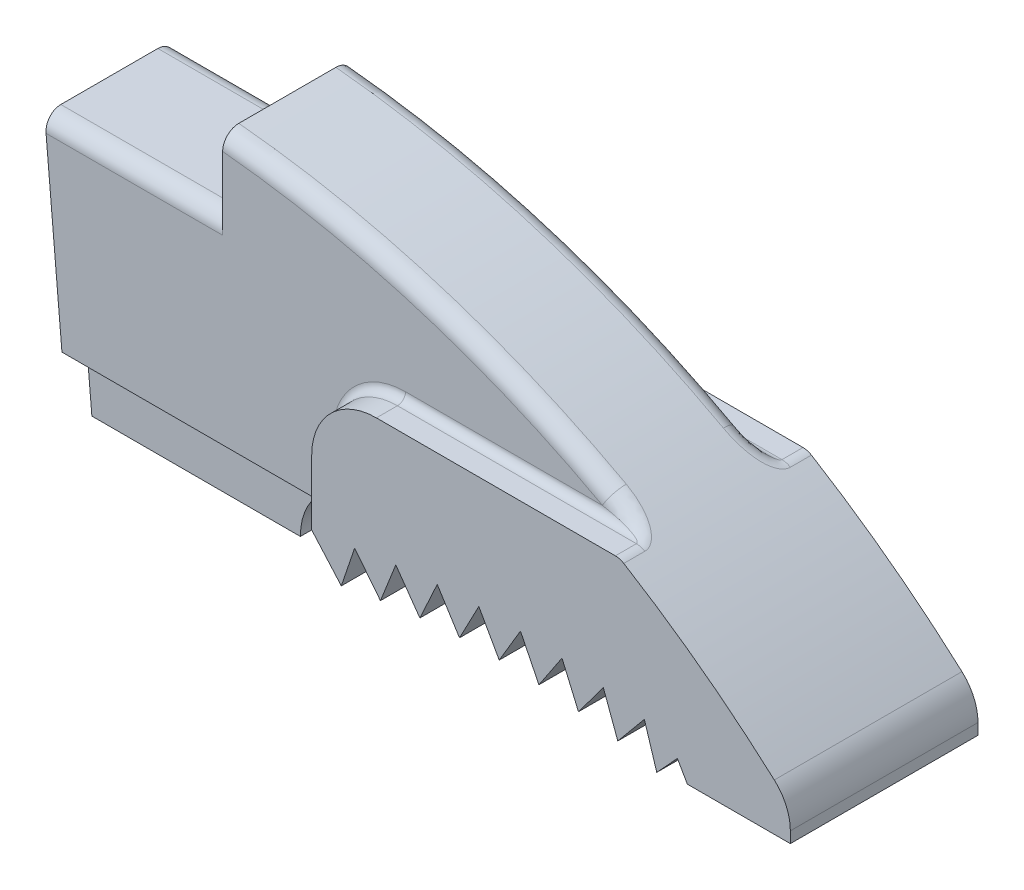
ISO-10303-21;
HEADER;
FILE_DESCRIPTION(('STEP AP214'),'2;1');
FILE_NAME('part.step','',(''),(''),'','','');
FILE_SCHEMA(('AUTOMOTIVE_DESIGN { 1 0 10303 214 1 1 1 1 }'));
ENDSEC;
DATA;
#1=APPLICATION_CONTEXT('core data for automotive mechanical design processes');
#2=APPLICATION_PROTOCOL_DEFINITION('international standard','automotive_design',2000,#1);
#3=PRODUCT_CONTEXT('',#1,'mechanical');
#4=PRODUCT('Part','Part','',(#3));
#5=PRODUCT_RELATED_PRODUCT_CATEGORY('part','',(#4));
#6=PRODUCT_DEFINITION_FORMATION('','',#4);
#7=PRODUCT_DEFINITION_CONTEXT('part definition',#1,'design');
#8=PRODUCT_DEFINITION('design','',#6,#7);
#9=PRODUCT_DEFINITION_SHAPE('','',#8);
#10=(LENGTH_UNIT() NAMED_UNIT(*) SI_UNIT(.MILLI.,.METRE.));
#11=(NAMED_UNIT(*) PLANE_ANGLE_UNIT() SI_UNIT($,.RADIAN.));
#12=(NAMED_UNIT(*) SI_UNIT($,.STERADIAN.) SOLID_ANGLE_UNIT());
#13=UNCERTAINTY_MEASURE_WITH_UNIT(LENGTH_MEASURE(1.E-05),#10,'distance_accuracy_value','');
#14=(GEOMETRIC_REPRESENTATION_CONTEXT(3) GLOBAL_UNCERTAINTY_ASSIGNED_CONTEXT((#13)) GLOBAL_UNIT_ASSIGNED_CONTEXT((#10,
#11,#12)) REPRESENTATION_CONTEXT('',''));
#15=CARTESIAN_POINT('',(0.,0.,0.));
#16=DIRECTION('',(0.,0.,1.));
#17=DIRECTION('',(1.,0.,0.));
#18=AXIS2_PLACEMENT_3D('',#15,#16,#17);
#19=CARTESIAN_POINT('',(21.9645816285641,27.4235682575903,6.08505504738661));
#20=DIRECTION('',(-0.735135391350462,0.677920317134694,0.));
#21=DIRECTION('',(-0.677920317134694,-0.735135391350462,0.));
#22=AXIS2_PLACEMENT_3D('',#19,#20,#21);
#23=PLANE('',#22);
#24=DIRECTION('',(-0.677920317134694,-0.735135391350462,0.));
#25=VECTOR('',#24,1.);
#26=CARTESIAN_POINT('',(21.9645816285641,27.4235682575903,-3.683));
#27=LINE('',#26,#25);
#28=CARTESIAN_POINT('',(22.7745976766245,28.3019479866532,-3.683));
#29=VERTEX_POINT('',#28);
#30=CARTESIAN_POINT('',(21.9645816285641,27.4235682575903,-3.683));
#31=VERTEX_POINT('',#30);
#32=EDGE_CURVE('E849',#29,#31,#27,.T.);
#33=ORIENTED_EDGE('',*,*,#32,.F.);
#34=DIRECTION('',(0.,0.,-1.));
#35=VECTOR('',#34,1.);
#36=CARTESIAN_POINT('',(22.7745976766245,28.3019479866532,6.08505504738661));
#37=LINE('',#36,#35);
#38=CARTESIAN_POINT('',(22.7745976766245,28.3019479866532,3.683));
#39=VERTEX_POINT('',#38);
#40=EDGE_CURVE('E728',#29,#39,#37,.F.);
#41=ORIENTED_EDGE('',*,*,#40,.T.);
#42=DIRECTION('',(0.677920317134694,0.735135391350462,0.));
#43=VECTOR('',#42,1.);
#44=CARTESIAN_POINT('',(21.9645816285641,27.4235682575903,3.683));
#45=LINE('',#44,#43);
#46=CARTESIAN_POINT('',(21.9645816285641,27.4235682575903,3.683));
#47=VERTEX_POINT('',#46);
#48=EDGE_CURVE('E857',#47,#39,#45,.T.);
#49=ORIENTED_EDGE('',*,*,#48,.F.);
#50=DIRECTION('',(0.,0.,-1.));
#51=VECTOR('',#50,1.);
#52=CARTESIAN_POINT('',(21.9645816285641,27.4235682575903,6.08505504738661));
#53=LINE('',#52,#51);
#54=EDGE_CURVE('E855',#47,#31,#53,.T.);
#55=ORIENTED_EDGE('',*,*,#54,.T.);
#56=EDGE_LOOP('',(#33,#41,#49,#55));
#57=FACE_BOUND('',#56,.T.);
#58=ADVANCED_FACE('F52',(#57),#23,.F.);
#59=CARTESIAN_POINT('',(9.58147287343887,27.5708309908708,6.08227806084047));
#60=DIRECTION('',(-0.947314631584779,0.320304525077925,0.));
#61=DIRECTION('',(-0.320304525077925,-0.947314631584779,0.));
#62=AXIS2_PLACEMENT_3D('',#59,#60,#61);
#63=PLANE('',#62);
#64=DIRECTION('',(0.,0.,-1.));
#65=VECTOR('',#64,1.);
#66=CARTESIAN_POINT('',(10.104796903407,29.1185846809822,6.08227806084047));
#67=LINE('',#66,#65);
#68=CARTESIAN_POINT('',(10.104796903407,29.1185846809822,3.683));
#69=VERTEX_POINT('',#68);
#70=CARTESIAN_POINT('',(10.104796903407,29.1185846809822,-3.683));
#71=VERTEX_POINT('',#70);
#72=EDGE_CURVE('E382',#69,#71,#67,.T.);
#73=ORIENTED_EDGE('',*,*,#72,.F.);
#74=DIRECTION('',(0.320304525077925,0.947314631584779,0.));
#75=VECTOR('',#74,1.);
#76=CARTESIAN_POINT('',(9.58147287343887,27.5708309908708,3.683));
#77=LINE('',#76,#75);
#78=CARTESIAN_POINT('',(9.58147287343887,27.5708309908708,3.683));
#79=VERTEX_POINT('',#78);
#80=EDGE_CURVE('E971',#79,#69,#77,.T.);
#81=ORIENTED_EDGE('',*,*,#80,.F.);
#82=DIRECTION('',(0.,0.,-1.));
#83=VECTOR('',#82,1.);
#84=CARTESIAN_POINT('',(9.58147287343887,27.5708309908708,6.08227806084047));
#85=LINE('',#84,#83);
#86=CARTESIAN_POINT('',(9.58147287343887,27.5708309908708,-3.683));
#87=VERTEX_POINT('',#86);
#88=EDGE_CURVE('E966',#79,#87,#85,.T.);
#89=ORIENTED_EDGE('',*,*,#88,.T.);
#90=DIRECTION('',(-0.320304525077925,-0.947314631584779,0.));
#91=VECTOR('',#90,1.);
#92=CARTESIAN_POINT('',(9.58147287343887,27.5708309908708,-3.683));
#93=LINE('',#92,#91);
#94=EDGE_CURVE('E957',#71,#87,#93,.T.);
#95=ORIENTED_EDGE('',*,*,#94,.F.);
#96=EDGE_LOOP('',(#73,#81,#89,#95));
#97=FACE_BOUND('',#96,.T.);
#98=ADVANCED_FACE('F578',(#97),#63,.F.);
#99=CARTESIAN_POINT('',(8.41959550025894,28.8925,1.5875));
#100=DIRECTION('',(0.,1.,0.));
#101=DIRECTION('',(-1.,0.,0.));
#102=AXIS2_PLACEMENT_3D('',#99,#100,#101);
#103=PLANE('',#102);
#104=DIRECTION('',(0.,0.,1.));
#105=VECTOR('',#104,1.);
#106=CARTESIAN_POINT('',(8.41959550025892,28.8925,-3.683));
#107=LINE('',#106,#105);
#108=CARTESIAN_POINT('',(8.41959550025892,28.8925,-2.8575));
#109=VERTEX_POINT('',#108);
#110=CARTESIAN_POINT('',(8.41959550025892,28.8925,-2.2225));
#111=VERTEX_POINT('',#110);
#112=EDGE_CURVE('E755',#109,#111,#107,.T.);
#113=ORIENTED_EDGE('',*,*,#112,.T.);
#114=DIRECTION('',(-1.,0.,0.));
#115=VECTOR('',#114,1.);
#116=CARTESIAN_POINT('',(-2.52776621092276,28.8925,-2.2225));
#117=LINE('',#116,#115);
#118=CARTESIAN_POINT('',(-2.52776621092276,28.8925,-2.2225));
#119=VERTEX_POINT('',#118);
#120=EDGE_CURVE('E792',#111,#119,#117,.T.);
#121=ORIENTED_EDGE('',*,*,#120,.T.);
#122=DIRECTION('',(0.,0.,-1.));
#123=VECTOR('',#122,1.);
#124=CARTESIAN_POINT('',(-2.52776621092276,28.8925,2.54));
#125=LINE('',#124,#123);
#126=CARTESIAN_POINT('',(-2.52776621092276,28.8925,-2.54));
#127=VERTEX_POINT('',#126);
#128=EDGE_CURVE('E779',#119,#127,#125,.T.);
#129=ORIENTED_EDGE('',*,*,#128,.T.);
#130=DIRECTION('',(1.,0.,0.));
#131=VECTOR('',#130,1.);
#132=CARTESIAN_POINT('',(8.41959550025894,28.8925,-2.54));
#133=LINE('',#132,#131);
#134=CARTESIAN_POINT('',(8.10209550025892,28.8925,-2.54));
#135=VERTEX_POINT('',#134);
#136=EDGE_CURVE('E774',#127,#135,#133,.T.);
#137=ORIENTED_EDGE('',*,*,#136,.T.);
#138=CARTESIAN_POINT('',(8.10209550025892,28.8925,-2.8575));
#139=DIRECTION('',(0.,1.,0.));
#140=DIRECTION('',(-1.,0.,0.));
#141=AXIS2_PLACEMENT_3D('',#138,#139,#140);
#142=CIRCLE('',#141,0.3175);
#143=EDGE_CURVE('E465',#135,#109,#142,.T.);
#144=ORIENTED_EDGE('',*,*,#143,.T.);
#145=EDGE_LOOP('',(#113,#121,#129,#137,#144));
#146=FACE_BOUND('',#145,.T.);
#147=ADVANCED_FACE('F641',(#146),#103,.F.);
#148=CARTESIAN_POINT('',(-2.52776621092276,28.8925,2.54));
#149=VERTEX_POINT('',#148);
#150=CARTESIAN_POINT('',(-2.52776621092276,28.8925,2.2225));
#151=VERTEX_POINT('',#150);
#152=EDGE_CURVE('E406',#149,#151,#125,.T.);
#153=ORIENTED_EDGE('',*,*,#152,.T.);
#154=DIRECTION('',(-1.,0.,0.));
#155=VECTOR('',#154,1.);
#156=CARTESIAN_POINT('',(8.41959550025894,28.8925,2.2225));
#157=LINE('',#156,#155);
#158=CARTESIAN_POINT('',(8.41959550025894,28.8925,2.2225));
#159=VERTEX_POINT('',#158);
#160=EDGE_CURVE('E558',#151,#159,#157,.F.);
#161=ORIENTED_EDGE('',*,*,#160,.T.);
#162=CARTESIAN_POINT('',(8.41959550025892,28.8925,2.8575));
#163=VERTEX_POINT('',#162);
#164=EDGE_CURVE('E760',#159,#163,#107,.T.);
#165=ORIENTED_EDGE('',*,*,#164,.T.);
#166=CARTESIAN_POINT('',(8.10209550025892,28.8925,2.8575));
#167=DIRECTION('',(0.,1.,0.));
#168=DIRECTION('',(-1.,0.,0.));
#169=AXIS2_PLACEMENT_3D('',#166,#167,#168);
#170=CIRCLE('',#169,0.3175);
#171=CARTESIAN_POINT('',(8.10209550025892,28.8925,2.54));
#172=VERTEX_POINT('',#171);
#173=EDGE_CURVE('E464',#163,#172,#170,.T.);
#174=ORIENTED_EDGE('',*,*,#173,.T.);
#175=DIRECTION('',(1.,0.,0.));
#176=VECTOR('',#175,1.);
#177=CARTESIAN_POINT('',(8.41959550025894,28.8925,2.54));
#178=LINE('',#177,#176);
#179=EDGE_CURVE('E775',#149,#172,#178,.T.);
#180=ORIENTED_EDGE('',*,*,#179,.F.);
#181=EDGE_LOOP('',(#153,#161,#165,#174,#180));
#182=FACE_BOUND('',#181,.T.);
#183=ADVANCED_FACE('F675',(#182),#103,.F.);
#184=CARTESIAN_POINT('',(0.,0.,-2.54));
#185=DIRECTION('',(0.,0.,1.));
#186=DIRECTION('',(1.,0.,0.));
#187=AXIS2_PLACEMENT_3D('',#184,#185,#186);
#188=PLANE('',#187);
#189=DIRECTION('',(0.0871557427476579,-0.996194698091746,0.));
#190=VECTOR('',#189,1.);
#191=CARTESIAN_POINT('',(-3.45899354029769,39.5364770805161,-2.54));
#192=LINE('',#191,#190);
#193=CARTESIAN_POINT('',(-3.15120711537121,36.0184621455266,-2.54));
#194=VERTEX_POINT('',#193);
#195=EDGE_CURVE('E767',#194,#127,#192,.T.);
#196=ORIENTED_EDGE('',*,*,#195,.F.);
#197=DIRECTION('',(1.,0.,0.));
#198=VECTOR('',#197,1.);
#199=CARTESIAN_POINT('',(0.,36.0184621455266,-2.54));
#200=LINE('',#199,#198);
#201=CARTESIAN_POINT('',(3.78131785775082,36.0184621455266,-2.54));
#202=VERTEX_POINT('',#201);
#203=EDGE_CURVE('E1038',#194,#202,#200,.T.);
#204=ORIENTED_EDGE('',*,*,#203,.T.);
#205=DIRECTION('',(0.,1.,0.));
#206=VECTOR('',#205,1.);
#207=CARTESIAN_POINT('',(3.78131785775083,0.,-2.54));
#208=LINE('',#207,#206);
#209=CARTESIAN_POINT('',(3.78131785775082,38.8690029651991,-2.54));
#210=VERTEX_POINT('',#209);
#211=EDGE_CURVE('E842',#202,#210,#208,.T.);
#212=ORIENTED_EDGE('',*,*,#211,.T.);
#213=CARTESIAN_POINT('',(0.,0.,-2.54));
#214=DIRECTION('',(0.,0.,1.));
#215=DIRECTION('',(1.,0.,0.));
#216=AXIS2_PLACEMENT_3D('',#213,#214,#215);
#217=CIRCLE('',#216,39.0525);
#218=CARTESIAN_POINT('',(18.689399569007,34.29,-2.54));
#219=VERTEX_POINT('',#218);
#220=EDGE_CURVE('E1035',#210,#219,#217,.F.);
#221=ORIENTED_EDGE('',*,*,#220,.T.);
#222=DIRECTION('',(1.,0.,0.));
#223=VECTOR('',#222,1.);
#224=CARTESIAN_POINT('',(10.9595955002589,34.29,-2.54));
#225=LINE('',#224,#223);
#226=CARTESIAN_POINT('',(10.9595955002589,34.29,-2.54));
#227=VERTEX_POINT('',#226);
#228=EDGE_CURVE('E433',#219,#227,#225,.F.);
#229=ORIENTED_EDGE('',*,*,#228,.T.);
#230=CARTESIAN_POINT('',(10.9595955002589,31.4325,-2.54));
#231=DIRECTION('',(0.,0.,1.));
#232=DIRECTION('',(1.,0.,0.));
#233=AXIS2_PLACEMENT_3D('',#230,#231,#232);
#234=CIRCLE('',#233,2.8575);
#235=CARTESIAN_POINT('',(8.10209550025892,31.4325,-2.54));
#236=VERTEX_POINT('',#235);
#237=EDGE_CURVE('E434',#227,#236,#234,.T.);
#238=ORIENTED_EDGE('',*,*,#237,.T.);
#239=DIRECTION('',(0.,1.,0.));
#240=VECTOR('',#239,1.);
#241=CARTESIAN_POINT('',(8.10209550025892,28.8925,-2.54));
#242=LINE('',#241,#240);
#243=EDGE_CURVE('E438',#236,#135,#242,.F.);
#244=ORIENTED_EDGE('',*,*,#243,.T.);
#245=ORIENTED_EDGE('',*,*,#136,.F.);
#246=EDGE_LOOP('',(#196,#204,#212,#221,#229,#238,#244,#245));
#247=FACE_BOUND('',#246,.T.);
#248=ADVANCED_FACE('F668',(#247),#188,.F.);
#249=CARTESIAN_POINT('',(0.,0.,2.54));
#250=DIRECTION('',(0.,0.,1.));
#251=DIRECTION('',(1.,0.,0.));
#252=AXIS2_PLACEMENT_3D('',#249,#250,#251);
#253=PLANE('',#252);
#254=DIRECTION('',(0.,1.,0.));
#255=VECTOR('',#254,1.);
#256=CARTESIAN_POINT('',(3.78131785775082,44.5223851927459,2.54));
#257=LINE('',#256,#255);
#258=CARTESIAN_POINT('',(3.78131785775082,36.0184621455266,2.54));
#259=VERTEX_POINT('',#258);
#260=CARTESIAN_POINT('',(3.78131785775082,38.8690029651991,2.54));
#261=VERTEX_POINT('',#260);
#262=EDGE_CURVE('E473',#259,#261,#257,.T.);
#263=ORIENTED_EDGE('',*,*,#262,.F.);
#264=DIRECTION('',(1.,0.,0.));
#265=VECTOR('',#264,1.);
#266=CARTESIAN_POINT('',(-3.20676241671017,36.0184621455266,2.54));
#267=LINE('',#266,#265);
#268=CARTESIAN_POINT('',(-3.15120711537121,36.0184621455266,2.54));
#269=VERTEX_POINT('',#268);
#270=EDGE_CURVE('E813',#259,#269,#267,.F.);
#271=ORIENTED_EDGE('',*,*,#270,.T.);
#272=DIRECTION('',(0.0871557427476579,-0.996194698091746,0.));
#273=VECTOR('',#272,1.);
#274=CARTESIAN_POINT('',(-3.45899354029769,39.5364770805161,2.54));
#275=LINE('',#274,#273);
#276=EDGE_CURVE('E769',#269,#149,#275,.T.);
#277=ORIENTED_EDGE('',*,*,#276,.T.);
#278=ORIENTED_EDGE('',*,*,#179,.T.);
#279=DIRECTION('',(0.,1.,0.));
#280=VECTOR('',#279,1.);
#281=CARTESIAN_POINT('',(8.10209550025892,0.,2.54));
#282=LINE('',#281,#280);
#283=CARTESIAN_POINT('',(8.10209550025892,31.4325,2.54));
#284=VERTEX_POINT('',#283);
#285=EDGE_CURVE('E449',#172,#284,#282,.T.);
#286=ORIENTED_EDGE('',*,*,#285,.T.);
#287=CARTESIAN_POINT('',(10.9595955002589,31.4325,2.54));
#288=DIRECTION('',(0.,0.,1.));
#289=DIRECTION('',(1.,0.,0.));
#290=AXIS2_PLACEMENT_3D('',#287,#288,#289);
#291=CIRCLE('',#290,2.8575);
#292=CARTESIAN_POINT('',(10.9595955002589,34.29,2.54));
#293=VERTEX_POINT('',#292);
#294=EDGE_CURVE('E444',#284,#293,#291,.F.);
#295=ORIENTED_EDGE('',*,*,#294,.T.);
#296=DIRECTION('',(1.,0.,0.));
#297=VECTOR('',#296,1.);
#298=CARTESIAN_POINT('',(0.,34.29,2.54));
#299=LINE('',#298,#297);
#300=CARTESIAN_POINT('',(18.689399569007,34.29,2.54));
#301=VERTEX_POINT('',#300);
#302=EDGE_CURVE('E445',#293,#301,#299,.T.);
#303=ORIENTED_EDGE('',*,*,#302,.T.);
#304=CARTESIAN_POINT('',(0.,0.,2.54));
#305=DIRECTION('',(0.,0.,1.));
#306=DIRECTION('',(1.,0.,0.));
#307=AXIS2_PLACEMENT_3D('',#304,#305,#306);
#308=CIRCLE('',#307,39.0525);
#309=EDGE_CURVE('E814',#301,#261,#308,.T.);
#310=ORIENTED_EDGE('',*,*,#309,.T.);
#311=EDGE_LOOP('',(#263,#271,#277,#278,#286,#295,#303,#310));
#312=FACE_BOUND('',#311,.T.);
#313=ADVANCED_FACE('F669',(#312),#253,.T.);
#314=CARTESIAN_POINT('',(0.,0.,1.5875));
#315=DIRECTION('',(0.,0.,1.));
#316=DIRECTION('',(1.,0.,0.));
#317=AXIS2_PLACEMENT_3D('',#314,#315,#316);
#318=PLANE('',#317);
#319=DIRECTION('',(1.,0.,0.));
#320=VECTOR('',#319,1.);
#321=CARTESIAN_POINT('',(-3.20676241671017,26.3525,1.5875));
#322=LINE('',#321,#320);
#323=CARTESIAN_POINT('',(-2.30554500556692,26.3525,1.5875));
#324=VERTEX_POINT('',#323);
#325=CARTESIAN_POINT('',(5.87959550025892,26.3525,1.5875));
#326=VERTEX_POINT('',#325);
#327=EDGE_CURVE('E373',#324,#326,#322,.T.);
#328=ORIENTED_EDGE('',*,*,#327,.T.);
#329=CARTESIAN_POINT('',(8.41959550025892,26.3525,1.5875));
#330=DIRECTION('',(0.,0.,-1.));
#331=DIRECTION('',(1.,0.,0.));
#332=AXIS2_PLACEMENT_3D('',#329,#330,#331);
#333=CIRCLE('',#332,2.54);
#334=CARTESIAN_POINT('',(6.73954341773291,28.2575,1.5875));
#335=VERTEX_POINT('',#334);
#336=EDGE_CURVE('E388',#326,#335,#333,.T.);
#337=ORIENTED_EDGE('',*,*,#336,.T.);
#338=DIRECTION('',(-1.,0.,0.));
#339=VECTOR('',#338,1.);
#340=CARTESIAN_POINT('',(0.,28.2575,1.5875));
#341=LINE('',#340,#339);
#342=CARTESIAN_POINT('',(-2.4722109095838,28.2575,1.5875));
#343=VERTEX_POINT('',#342);
#344=EDGE_CURVE('E811',#335,#343,#341,.T.);
#345=ORIENTED_EDGE('',*,*,#344,.T.);
#346=DIRECTION('',(0.0871557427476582,-0.996194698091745,0.));
#347=VECTOR('',#346,1.);
#348=CARTESIAN_POINT('',(-3.45899354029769,39.5364770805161,1.5875));
#349=LINE('',#348,#347);
#350=EDGE_CURVE('E392',#343,#324,#349,.T.);
#351=ORIENTED_EDGE('',*,*,#350,.T.);
#352=EDGE_LOOP('',(#328,#337,#345,#351));
#353=FACE_BOUND('',#352,.T.);
#354=ADVANCED_FACE('F386',(#353),#318,.T.);
#355=CARTESIAN_POINT('',(0.,0.,-1.5875));
#356=DIRECTION('',(0.,0.,1.));
#357=DIRECTION('',(1.,0.,0.));
#358=AXIS2_PLACEMENT_3D('',#355,#356,#357);
#359=PLANE('',#358);
#360=CARTESIAN_POINT('',(8.41959550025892,26.3525,-1.5875));
#361=DIRECTION('',(0.,0.,-1.));
#362=DIRECTION('',(1.,0.,0.));
#363=AXIS2_PLACEMENT_3D('',#360,#361,#362);
#364=CIRCLE('',#363,2.54);
#365=CARTESIAN_POINT('',(5.87959550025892,26.3525,-1.5875));
#366=VERTEX_POINT('',#365);
#367=CARTESIAN_POINT('',(6.7395434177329,28.2575,-1.5875));
#368=VERTEX_POINT('',#367);
#369=EDGE_CURVE('E399',#366,#368,#364,.T.);
#370=ORIENTED_EDGE('',*,*,#369,.F.);
#371=DIRECTION('',(1.,0.,0.));
#372=VECTOR('',#371,1.);
#373=CARTESIAN_POINT('',(-3.20676241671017,26.3525,-1.5875));
#374=LINE('',#373,#372);
#375=CARTESIAN_POINT('',(-2.30554500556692,26.3525,-1.5875));
#376=VERTEX_POINT('',#375);
#377=EDGE_CURVE('E376',#376,#366,#374,.T.);
#378=ORIENTED_EDGE('',*,*,#377,.F.);
#379=DIRECTION('',(0.0871557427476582,-0.996194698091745,0.));
#380=VECTOR('',#379,1.);
#381=CARTESIAN_POINT('',(-3.45899354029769,39.5364770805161,-1.5875));
#382=LINE('',#381,#380);
#383=CARTESIAN_POINT('',(-2.4722109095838,28.2575,-1.5875));
#384=VERTEX_POINT('',#383);
#385=EDGE_CURVE('E404',#384,#376,#382,.T.);
#386=ORIENTED_EDGE('',*,*,#385,.F.);
#387=DIRECTION('',(-1.,0.,0.));
#388=VECTOR('',#387,1.);
#389=CARTESIAN_POINT('',(8.41959550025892,28.2575,-1.5875));
#390=LINE('',#389,#388);
#391=EDGE_CURVE('E809',#384,#368,#390,.F.);
#392=ORIENTED_EDGE('',*,*,#391,.T.);
#393=EDGE_LOOP('',(#370,#378,#386,#392));
#394=FACE_BOUND('',#393,.T.);
#395=ADVANCED_FACE('F680',(#394),#359,.F.);
#396=CARTESIAN_POINT('',(0.,0.,1.5875));
#397=DIRECTION('',(0.,0.,-1.));
#398=DIRECTION('',(-1.,0.,0.));
#399=AXIS2_PLACEMENT_3D('',#396,#397,#398);
#400=CYLINDRICAL_SURFACE('',#399,39.6875);
#401=CARTESIAN_POINT('',(0.,0.,3.683));
#402=DIRECTION('',(0.,0.,1.));
#403=DIRECTION('',(1.,0.,0.));
#404=AXIS2_PLACEMENT_3D('',#401,#402,#403);
#405=CIRCLE('',#404,39.6875);
#406=CARTESIAN_POINT('',(26.5796662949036,29.4723428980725,3.683));
#407=VERTEX_POINT('',#406);
#408=CARTESIAN_POINT('',(20.6705630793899,33.8795731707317,3.683));
#409=VERTEX_POINT('',#408);
#410=EDGE_CURVE('E747',#407,#409,#405,.T.);
#411=ORIENTED_EDGE('',*,*,#410,.F.);
#412=DIRECTION('',(0.,0.,-1.));
#413=VECTOR('',#412,1.);
#414=CARTESIAN_POINT('',(26.5796662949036,29.4723428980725,1.5875));
#415=LINE('',#414,#413);
#416=CARTESIAN_POINT('',(26.5796662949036,29.4723428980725,-3.683));
#417=VERTEX_POINT('',#416);
#418=EDGE_CURVE('E739',#407,#417,#415,.T.);
#419=ORIENTED_EDGE('',*,*,#418,.T.);
#420=CARTESIAN_POINT('',(0.,0.,-3.683));
#421=DIRECTION('',(0.,0.,1.));
#422=DIRECTION('',(1.,0.,0.));
#423=AXIS2_PLACEMENT_3D('',#420,#421,#422);
#424=CIRCLE('',#423,39.6875);
#425=CARTESIAN_POINT('',(20.6705630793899,33.8795731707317,-3.683));
#426=VERTEX_POINT('',#425);
#427=EDGE_CURVE('E744',#417,#426,#424,.T.);
#428=ORIENTED_EDGE('',*,*,#427,.T.);
#429=DIRECTION('',(0.,0.,-1.));
#430=VECTOR('',#429,1.);
#431=CARTESIAN_POINT('',(20.6705630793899,33.8795731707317,1.5875));
#432=LINE('',#431,#430);
#433=CARTESIAN_POINT('',(20.6705630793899,33.8795731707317,-2.8575));
#434=VERTEX_POINT('',#433);
#435=EDGE_CURVE('E1466',#426,#434,#432,.F.);
#436=ORIENTED_EDGE('',*,*,#435,.T.);
#437=CARTESIAN_POINT('',(20.2223217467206,33.9963042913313,-2.97811957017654));
#438=CARTESIAN_POINT('',(20.3115739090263,34.0175855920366,-3.02993725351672));
#439=CARTESIAN_POINT('',(20.3960421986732,34.0062423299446,-3.09190783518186));
#440=CARTESIAN_POINT('',(20.4805104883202,33.9948990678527,-3.153878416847));
#441=CARTESIAN_POINT('',(20.5511399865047,33.9521472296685,-3.21935871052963));
#442=CARTESIAN_POINT('',(20.2398639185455,33.9927650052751,-2.96951177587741));
#443=CARTESIAN_POINT('',(20.3288383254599,34.0109212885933,-3.01805465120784));
#444=CARTESIAN_POINT('',(20.4132848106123,33.997725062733,-3.0755144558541));
#445=CARTESIAN_POINT('',(20.4977085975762,33.9845401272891,-3.13299935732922));
#446=CARTESIAN_POINT('',(20.5689673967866,33.9413567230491,-3.19353532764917));
#447=CARTESIAN_POINT('',(20.2560792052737,33.9894868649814,-2.96044182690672));
#448=CARTESIAN_POINT('',(20.3448146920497,34.0047268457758,-3.00536713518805));
#449=CARTESIAN_POINT('',(20.4292269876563,33.9898271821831,-3.05811503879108));
#450=CARTESIAN_POINT('',(20.5136245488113,33.9749348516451,-3.11088293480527));
#451=CARTESIAN_POINT('',(20.585446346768,33.9313623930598,-3.16632548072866));
#452=CARTESIAN_POINT('',(20.2850526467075,33.9836219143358,-2.94139512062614));
#453=CARTESIAN_POINT('',(20.373357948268,33.9936284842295,-2.97847192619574));
#454=CARTESIAN_POINT('',(20.4577167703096,33.9756866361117,-3.02137057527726));
#455=CARTESIAN_POINT('',(20.5420609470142,33.9577520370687,-3.06428711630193));
#456=CARTESIAN_POINT('',(20.6148909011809,33.9134814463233,-3.10918536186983));
#457=CARTESIAN_POINT('',(20.297777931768,33.98104167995,-2.9314108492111));
#458=CARTESIAN_POINT('',(20.3859000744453,33.9887339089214,-2.96424917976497));
#459=CARTESIAN_POINT('',(20.4702320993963,33.9694597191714,-3.00200923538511));
#460=CARTESIAN_POINT('',(20.5545567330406,33.9501892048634,-3.03978383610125));
#461=CARTESIAN_POINT('',(20.6278231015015,33.9056148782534,-3.07923254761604));
#462=CARTESIAN_POINT('',(20.318386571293,33.976859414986,-2.91093912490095));
#463=CARTESIAN_POINT('',(20.4062079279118,33.9807940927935,-2.93489449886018));
#464=CARTESIAN_POINT('',(20.4905026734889,33.9593618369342,-2.96215357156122));
#465=CARTESIAN_POINT('',(20.5747900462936,33.9379332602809,-2.98942712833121));
#466=CARTESIAN_POINT('',(20.6487668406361,33.8928640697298,-3.01781737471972));
#467=CARTESIAN_POINT('',(20.3263693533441,33.975237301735,-2.90046736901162));
#468=CARTESIAN_POINT('',(20.4140779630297,33.97770847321,-2.91978557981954));
#469=CARTESIAN_POINT('',(20.4983556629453,33.9554425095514,-2.94169311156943));
#470=CARTESIAN_POINT('',(20.5826314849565,33.9331774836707,-2.96360852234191));
#471=CARTESIAN_POINT('',(20.6568794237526,33.8879186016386,-2.98640210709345));
#472=CARTESIAN_POINT('',(20.3370803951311,33.9730601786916,-2.8791618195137));
#473=CARTESIAN_POINT('',(20.4246342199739,33.9735671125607,-2.88895061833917));
#474=CARTESIAN_POINT('',(20.5088928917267,33.9501813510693,-2.89998444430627));
#475=CARTESIAN_POINT('',(20.5931494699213,33.926796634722,-2.91102611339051));
#476=CARTESIAN_POINT('',(20.6677646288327,33.8812810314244,-2.92248545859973));
#477=CARTESIAN_POINT('',(20.3398326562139,33.9725002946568,-2.86832991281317));
#478=CARTESIAN_POINT('',(20.4273479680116,33.9725005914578,-2.8732223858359));
#479=CARTESIAN_POINT('',(20.5116007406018,33.948827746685,-2.87874029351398));
#480=CARTESIAN_POINT('',(20.595853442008,33.9251549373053,-2.88425804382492));
#481=CARTESIAN_POINT('',(20.6705616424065,33.8795740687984,-2.8899897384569));
#482=CARTESIAN_POINT('',(20.339835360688,33.9724997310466,-2.84761479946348));
#483=CARTESIAN_POINT('',(20.4273507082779,33.9724994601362,-2.84314910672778));
#484=CARTESIAN_POINT('',(20.5116034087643,33.9488263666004,-2.83811253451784));
#485=CARTESIAN_POINT('',(20.595856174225,33.9251532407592,-2.83307610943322));
#486=CARTESIAN_POINT('',(20.6705643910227,33.8795723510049,-2.82784439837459));
#487=CARTESIAN_POINT('',(20.3375447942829,33.9729656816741,-2.83773126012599));
#488=CARTESIAN_POINT('',(20.4250922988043,33.9733869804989,-2.82879824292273));
#489=CARTESIAN_POINT('',(20.5093498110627,33.9499528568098,-2.81872828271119));
#490=CARTESIAN_POINT('',(20.5936059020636,33.9265194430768,-2.80865233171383));
#491=CARTESIAN_POINT('',(20.6682365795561,33.8809929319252,-2.79819378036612));
#492=CARTESIAN_POINT('',(20.3286091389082,33.9747821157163,-2.81825896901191));
#493=CARTESIAN_POINT('',(20.4162856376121,33.9768426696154,-2.80060189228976));
#494=CARTESIAN_POINT('',(20.5005590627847,33.9543426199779,-2.78059668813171));
#495=CARTESIAN_POINT('',(20.5848311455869,33.9318432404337,-2.76058548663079));
#496=CARTESIAN_POINT('',(20.6591556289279,33.8865308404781,-2.73977690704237));
#497=CARTESIAN_POINT('',(20.3219566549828,33.976134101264,-2.80867074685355));
#498=CARTESIAN_POINT('',(20.4097273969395,33.979414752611,-2.78675314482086));
#499=CARTESIAN_POINT('',(20.4940146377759,33.9576095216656,-2.76185048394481));
#500=CARTESIAN_POINT('',(20.578296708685,33.9358068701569,-2.73693669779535));
#501=CARTESIAN_POINT('',(20.6523949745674,33.8906527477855,-2.71101224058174));
#502=CARTESIAN_POINT('',(20.3030247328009,33.9799774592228,-2.78804008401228));
#503=CARTESIAN_POINT('',(20.3910700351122,33.9867148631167,-2.75710707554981));
#504=CARTESIAN_POINT('',(20.4753925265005,33.9668909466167,-2.72163557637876));
#505=CARTESIAN_POINT('',(20.5597076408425,33.947070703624,-2.68614809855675));
#506=CARTESIAN_POINT('',(20.6331552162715,33.9023703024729,-2.64912025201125));
#507=CARTESIAN_POINT('',(20.2898471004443,33.9826504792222,-2.77712429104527));
#508=CARTESIAN_POINT('',(20.378080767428,33.9917883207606,-2.74152242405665));
#509=CARTESIAN_POINT('',(20.4624317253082,33.9733432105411,-2.70044025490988));
#510=CARTESIAN_POINT('',(20.5467662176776,33.9549062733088,-2.65933636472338));
#511=CARTESIAN_POINT('',(20.619763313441,33.9105197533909,-2.61637287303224));
#512=CARTESIAN_POINT('',(20.259106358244,33.9888748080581,-2.75626203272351));
#513=CARTESIAN_POINT('',(20.3477956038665,34.0035707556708,-2.71201710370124));
#514=CARTESIAN_POINT('',(20.4322031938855,33.9883524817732,-2.66015517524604));
#515=CARTESIAN_POINT('',(20.5165941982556,33.97314244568,-2.60827092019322));
#516=CARTESIAN_POINT('',(20.5885227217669,33.9294963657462,-2.55378609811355));
#517=CARTESIAN_POINT('',(20.2415306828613,33.9924286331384,-2.74631846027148));
#518=CARTESIAN_POINT('',(20.3304778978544,34.0102880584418,-2.69809860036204));
#519=CARTESIAN_POINT('',(20.4149231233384,33.9969155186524,-2.6410716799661));
#520=CARTESIAN_POINT('',(20.4993418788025,33.9835560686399,-2.58401967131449));
#521=CARTESIAN_POINT('',(20.5706612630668,33.9403311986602,-2.52395538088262));
#522=CARTESIAN_POINT('',(20.1933970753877,34.0021402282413,-2.72266871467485));
#523=CARTESIAN_POINT('',(20.2830591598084,34.0285931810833,-2.66539948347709));
#524=CARTESIAN_POINT('',(20.367611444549,34.0202865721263,-2.5960187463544));
#525=CARTESIAN_POINT('',(20.4521052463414,34.012008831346,-2.52658214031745));
#526=CARTESIAN_POINT('',(20.5217449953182,33.9699397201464,-2.4530061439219));
#527=CARTESIAN_POINT('',(20.1607691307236,34.0087058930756,-2.70960327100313));
#528=CARTESIAN_POINT('',(20.25092149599,34.0409262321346,-2.64773539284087));
#529=CARTESIAN_POINT('',(20.335550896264,34.0360626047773,-2.57144850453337));
#530=CARTESIAN_POINT('',(20.4200935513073,34.0312413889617,-2.49510549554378));
#531=CARTESIAN_POINT('',(20.488586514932,33.9899569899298,-2.41380981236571));
#532=CARTESIAN_POINT('',(20.0907859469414,34.0227344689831,-2.6855415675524));
#533=CARTESIAN_POINT('',(20.1820491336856,34.0671269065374,-2.61603354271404));
#534=CARTESIAN_POINT('',(20.2668189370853,34.0696918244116,-2.52687509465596));
#535=CARTESIAN_POINT('',(20.3514994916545,34.0723004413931,-2.43765863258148));
#536=CARTESIAN_POINT('',(20.4174653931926,34.0327270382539,-2.34162470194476));
#537=CARTESIAN_POINT('',(20.0534195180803,34.0301995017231,-2.67455036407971));
#538=CARTESIAN_POINT('',(20.1452788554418,34.0810069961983,-2.60200805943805));
#539=CARTESIAN_POINT('',(20.2301366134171,34.0875499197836,-2.50688306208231));
#540=CARTESIAN_POINT('',(20.3148817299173,34.0941474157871,-2.41170534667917));
#541=CARTESIAN_POINT('',(20.3794913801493,34.0554862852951,-2.3086510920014));
#542=CARTESIAN_POINT('',(19.9452682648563,34.051715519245,-2.64644803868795));
#543=CARTESIAN_POINT('',(20.0388230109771,34.1207984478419,-2.56734524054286));
#544=CARTESIAN_POINT('',(20.1240275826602,34.138882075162,-2.45678466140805));
#545=CARTESIAN_POINT('',(20.2088824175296,34.1571347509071,-2.34605812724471));
#546=CARTESIAN_POINT('',(20.2695815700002,34.1210839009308,-2.22434411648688));
#547=CARTESIAN_POINT('',(19.8711347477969,34.0663650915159,-2.63124329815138));
#548=CARTESIAN_POINT('',(19.9659458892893,34.147604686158,-2.55016916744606));
#549=CARTESIAN_POINT('',(20.0513619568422,34.1736796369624,-2.43093863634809));
#550=CARTESIAN_POINT('',(20.1363343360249,34.1999642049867,-2.31158362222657));
#551=CARTESIAN_POINT('',(20.1942426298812,34.1657472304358,-2.17872989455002));
#552=CARTESIAN_POINT('',(19.717793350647,34.0964209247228,-2.60505274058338));
#553=CARTESIAN_POINT('',(19.8154738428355,34.2018273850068,-2.52351750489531));
#554=CARTESIAN_POINT('',(19.901259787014,34.2446467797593,-2.3888707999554));
#555=CARTESIAN_POINT('',(19.9865886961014,34.2876824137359,-2.25409614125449));
#556=CARTESIAN_POINT('',(20.0384078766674,34.2573808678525,-2.10015822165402));
#557=CARTESIAN_POINT('',(19.6385718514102,34.1118291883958,-2.59407884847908));
#558=CARTESIAN_POINT('',(19.7377929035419,34.2292651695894,-2.51410243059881));
#559=CARTESIAN_POINT('',(19.8238104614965,34.2808199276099,-2.37267612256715));
#560=CARTESIAN_POINT('',(19.9093059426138,34.3326151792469,-2.23116800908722));
#561=CARTESIAN_POINT('',(19.9578982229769,34.3043572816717,-2.06723654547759));
#562=CARTESIAN_POINT('',(19.4882482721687,34.1408215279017,-2.57679442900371));
#563=CARTESIAN_POINT('',(19.5907422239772,34.2800089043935,-2.50243817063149));
#564=CARTESIAN_POINT('',(19.6770991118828,34.3483963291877,-2.3498330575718));
#565=CARTESIAN_POINT('',(19.7630645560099,34.4169640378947,-2.19716744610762));
#566=CARTESIAN_POINT('',(19.8051303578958,34.3927485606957,-2.01538328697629));
#567=CARTESIAN_POINT('',(19.4175174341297,34.1543669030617,-2.57005139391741));
#568=CARTESIAN_POINT('',(19.5215892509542,34.3033952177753,-2.49940734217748));
#569=CARTESIAN_POINT('',(19.6081659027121,34.3797753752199,-2.34218203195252));
#570=CARTESIAN_POINT('',(19.6943142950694,34.4563477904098,-2.18492550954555));
#571=CARTESIAN_POINT('',(19.7332494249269,34.4340454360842,-1.9951541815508));
#572=CARTESIAN_POINT('',(19.2746223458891,34.181530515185,-2.55874136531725));
#573=CARTESIAN_POINT('',(19.3821441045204,34.3494960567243,-2.49743934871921));
#574=CARTESIAN_POINT('',(19.4691560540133,34.4422405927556,-2.33199008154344));
#575=CARTESIAN_POINT('',(19.5557352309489,34.5351797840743,-2.16650889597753));
#576=CARTESIAN_POINT('',(19.5880308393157,34.5168613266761,-1.96122409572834));
#577=CARTESIAN_POINT('',(19.2024573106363,34.1951487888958,-2.55417559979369));
#578=CARTESIAN_POINT('',(19.3118173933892,34.3722148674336,-2.49852965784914));
#579=CARTESIAN_POINT('',(19.3990787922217,34.473326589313,-2.32945203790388));
#580=CARTESIAN_POINT('',(19.4858724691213,34.5746436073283,-2.16037196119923));
#581=CARTESIAN_POINT('',(19.5146923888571,34.558380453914,-1.94752679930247));
#582=CARTESIAN_POINT('',(18.9844099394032,34.2359866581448,-2.5433562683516));
#583=CARTESIAN_POINT('',(19.0990895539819,34.4391777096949,-2.50731206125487));
#584=CARTESIAN_POINT('',(19.1878112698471,34.5657336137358,-2.32869220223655));
#585=CARTESIAN_POINT('',(19.2746460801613,34.6931133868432,-2.1500671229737));
#586=CARTESIAN_POINT('',(19.2930995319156,34.6828861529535,-1.91506880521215));
#587=CARTESIAN_POINT('',(18.83710227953,34.2631647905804,-2.53999403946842));
#588=CARTESIAN_POINT('',(18.9562845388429,34.4817530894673,-2.52062252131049));
#589=CARTESIAN_POINT('',(19.0457093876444,34.6261462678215,-2.33734156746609));
#590=CARTESIAN_POINT('',(19.1329815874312,34.7714225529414,-2.15431478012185));
#591=CARTESIAN_POINT('',(19.1433966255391,34.7657463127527,-1.90498211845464));
#592=CARTESIAN_POINT('',(18.5894560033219,34.3081581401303,-2.54000403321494));
#593=CARTESIAN_POINT('',(18.7186262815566,34.5478151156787,-2.55328167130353));
#594=CARTESIAN_POINT('',(18.8085882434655,34.7235747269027,-2.36529345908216));
#595=CARTESIAN_POINT('',(18.8975466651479,34.8997476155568,-2.17742326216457));
#596=CARTESIAN_POINT('',(18.8917235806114,34.9029211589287,-1.90501209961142));
#597=CARTESIAN_POINT('',(18.4893315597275,34.3261592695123,-2.54155022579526));
#598=CARTESIAN_POINT('',(18.6227040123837,34.5731261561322,-2.56942880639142));
#599=CARTESIAN_POINT('',(18.713202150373,34.761839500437,-2.38024700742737));
#600=CARTESIAN_POINT('',(18.8026135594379,34.950977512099,-2.19127676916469));
#601=CARTESIAN_POINT('',(18.7899710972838,34.9578026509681,-1.90965067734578));
#602=CARTESIAN_POINT('',(18.2892395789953,34.3617597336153,-2.54768744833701));
#603=CARTESIAN_POINT('',(18.4324091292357,34.6201913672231,-2.60714060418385));
#604=CARTESIAN_POINT('',(18.5240147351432,34.8356457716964,-2.41730202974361));
#605=CARTESIAN_POINT('',(18.6145248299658,35.0515268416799,-2.2276793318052));
#606=CARTESIAN_POINT('',(18.5866255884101,35.0663406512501,-1.92806234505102));
#607=CARTESIAN_POINT('',(18.1892720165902,34.3793591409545,-2.55227792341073));
#608=CARTESIAN_POINT('',(18.3379526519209,34.6419298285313,-2.62878763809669));
#609=CARTESIAN_POINT('',(18.4302131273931,34.8711877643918,-2.43940220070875));
#610=CARTESIAN_POINT('',(18.5212891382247,35.1008780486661,-2.25034770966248));
#611=CARTESIAN_POINT('',(18.4850325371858,35.1199973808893,-1.94183377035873));
#612=CARTESIAN_POINT('',(18.040417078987,34.4052935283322,-2.56153252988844));
#613=CARTESIAN_POINT('',(18.1993917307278,34.6708747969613,-2.66489233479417));
#614=CARTESIAN_POINT('',(18.2922319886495,34.921625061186,-2.4778013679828));
#615=CARTESIAN_POINT('',(18.3847770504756,35.1724835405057,-2.29079189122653));
#616=CARTESIAN_POINT('',(18.3337571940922,35.199065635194,-1.96959758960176));
#617=CARTESIAN_POINT('',(17.9911525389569,34.4138317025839,-2.56499595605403));
#618=CARTESIAN_POINT('',(18.1536406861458,34.6799277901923,-2.67755879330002));
#619=CARTESIAN_POINT('',(18.2468464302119,34.9379060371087,-2.49141902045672));
#620=CARTESIAN_POINT('',(18.3397467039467,35.1959915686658,-2.30537788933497));
#621=CARTESIAN_POINT('',(18.2836916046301,35.2250966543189,-1.97998786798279));
#622=CARTESIAN_POINT('',(17.892986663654,34.4307573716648,-2.57275399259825));
#623=CARTESIAN_POINT('',(18.063167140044,34.6966901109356,-2.70411705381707));
#624=CARTESIAN_POINT('',(18.1571394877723,34.9694004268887,-2.52041979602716));
#625=CARTESIAN_POINT('',(18.2508043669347,35.2422186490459,-2.33682205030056));
#626=CARTESIAN_POINT('',(18.1839295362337,35.2766993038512,-2.00326197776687));
#627=CARTESIAN_POINT('',(17.8440852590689,34.4391448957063,-2.57704843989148));
#628=CARTESIAN_POINT('',(18.01843460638,34.7043935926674,-2.71802200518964));
#629=CARTESIAN_POINT('',(18.1128178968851,34.9846140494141,-2.53580257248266));
#630=CARTESIAN_POINT('',(18.2068832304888,35.2649410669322,-2.35370126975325));
#631=CARTESIAN_POINT('',(18.1342329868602,35.3022710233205,-2.0161453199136));
#632=CARTESIAN_POINT('',(17.7467410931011,34.4557555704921,-2.58653275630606));
#633=CARTESIAN_POINT('',(17.9302899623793,34.7182326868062,-2.74700621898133));
#634=CARTESIAN_POINT('',(18.0255390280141,35.0137917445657,-2.56835580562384));
#635=CARTESIAN_POINT('',(18.1204685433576,35.3094573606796,-2.3898250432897));
#636=CARTESIAN_POINT('',(18.0353059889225,35.3529133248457,-2.04459826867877));
#637=CARTESIAN_POINT('',(17.6982988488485,34.4639785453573,-2.5917235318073));
#638=CARTESIAN_POINT('',(17.8868709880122,34.7243579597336,-2.76210123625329));
#639=CARTESIAN_POINT('',(17.9825831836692,35.027754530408,-2.58552806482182));
#640=CARTESIAN_POINT('',(18.0779693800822,35.3312525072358,-2.40909680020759));
#641=CARTESIAN_POINT('',(17.9860760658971,35.3779833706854,-2.06017059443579));
#642=CARTESIAN_POINT('',(17.6021278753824,34.4802207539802,-2.60309970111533));
#643=CARTESIAN_POINT('',(17.8019234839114,34.7346981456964,-2.79329051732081));
#644=CARTESIAN_POINT('',(17.8986232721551,35.0541167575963,-2.62160025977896));
#645=CARTESIAN_POINT('',(17.9949901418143,35.3736408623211,-2.45005117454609));
#646=CARTESIAN_POINT('',(17.8883413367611,35.4275022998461,-2.09429910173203));
#647=CARTESIAN_POINT('',(17.55439958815,34.4882398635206,-2.60928568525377));
#648=CARTESIAN_POINT('',(17.7603907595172,34.7388992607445,-2.80940074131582));
#649=CARTESIAN_POINT('',(17.8576203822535,35.0665152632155,-2.64050121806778));
#650=CARTESIAN_POINT('',(17.9545074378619,35.3942339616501,-2.47176410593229));
#651=CARTESIAN_POINT('',(17.8398369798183,35.4519508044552,-2.11285705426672));
#652=CARTESIAN_POINT('',(17.5071595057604,34.4961368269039,-2.61601737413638));
#653=CARTESIAN_POINT('',(17.7202712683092,34.7419505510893,-2.82585135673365));
#654=CARTESIAN_POINT('',(17.8178901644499,35.0779748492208,-2.66023272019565));
#655=CARTESIAN_POINT('',(17.9155090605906,35.4139991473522,-2.49461408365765));
#656=CARTESIAN_POINT('',(17.7918287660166,35.4760269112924,-2.13305212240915));
#657=(BOUNDED_SURFACE() B_SPLINE_SURFACE(3,2,((#437,#438,#439,#440,#441),(#442,#443,#444,#445,
#446),(#447,#448,#449,#450,#451),(#452,#453,#454,#455,#456),(#457,#458,#459,#460,#461),(#462,
#463,#464,#465,#466),(#467,#468,#469,#470,#471),(#472,#473,#474,#475,#476),(#477,#478,#479,#480,
#481),(#482,#483,#484,#485,#486),(#487,#488,#489,#490,#491),(#492,#493,#494,#495,#496),(#497,
#498,#499,#500,#501),(#502,#503,#504,#505,#506),(#507,#508,#509,#510,#511),(#512,#513,#514,#515,
#516),(#517,#518,#519,#520,#521),(#522,#523,#524,#525,#526),(#527,#528,#529,#530,#531),(#532,
#533,#534,#535,#536),(#537,#538,#539,#540,#541),(#542,#543,#544,#545,#546),(#547,#548,#549,#550,
#551),(#552,#553,#554,#555,#556),(#557,#558,#559,#560,#561),(#562,#563,#564,#565,#566),(#567,
#568,#569,#570,#571),(#572,#573,#574,#575,#576),(#577,#578,#579,#580,#581),(#582,#583,#584,#585,
#586),(#587,#588,#589,#590,#591),(#592,#593,#594,#595,#596),(#597,#598,#599,#600,#601),(#602,
#603,#604,#605,#606),(#607,#608,#609,#610,#611),(#612,#613,#614,#615,#616),(#617,#618,#619,#620,
#621),(#622,#623,#624,#625,#626),(#627,#628,#629,#630,#631),(#632,#633,#634,#635,#636),(#637,
#638,#639,#640,#641),(#642,#643,#644,#645,#646),(#647,#648,#649,#650,#651),(#652,#653,#654,#655,
#656)),.UNSPECIFIED.,.F.,.F.,.F.) B_SPLINE_SURFACE_WITH_KNOTS((4,2,2,2,2,2,2,2,2,2,2,2,2,2,2,2,
2,2,2,2,2,4),(3,2,3),(0.,0.0990571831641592,0.199017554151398,0.29680062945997,
0.394133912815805,0.482976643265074,0.571970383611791,0.679966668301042,0.788275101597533,
0.951365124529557,1.11484771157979,1.40574092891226,1.69744815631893,1.9492625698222,
2.2012188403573,2.70558349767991,3.04686364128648,3.3880815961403,3.55750520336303,
3.72689559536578,3.89645829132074,4.06612194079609),(0.,0.5,1.),
.UNSPECIFIED.) GEOMETRIC_REPRESENTATION_ITEM() RATIONAL_B_SPLINE_SURFACE(((1.,0.986509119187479,
1.,0.986509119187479,1.),(1.,0.987130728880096,1.,0.987130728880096,1.),(1.,0.987702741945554,
1.,0.987702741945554,1.),(1.,0.988721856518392,1.,0.988721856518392,1.),(1.,0.989167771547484,
1.,0.989167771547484,1.),(1.,0.98988857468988,1.,0.98988857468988,1.),(1.,0.990166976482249,1.,
0.990166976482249,1.),(1.,0.990540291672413,1.,0.990540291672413,1.),(1.,0.99063604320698,1.,
0.99063604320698,1.),(1.,0.990636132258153,1.,0.990636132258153,1.),(1.,0.990556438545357,1.,
0.990556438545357,1.),(1.,0.990245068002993,1.,0.990245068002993,1.),(1.,0.990013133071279,1.,
0.990013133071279,1.),(1.,0.989351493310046,1.,0.989351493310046,1.),(1.,0.98889013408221,1.,
0.98889013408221,1.),(1.,0.987809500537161,1.,0.987809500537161,1.),(1.,0.9871897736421,1.,
0.9871897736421,1.),(1.,0.985484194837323,1.,0.985484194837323,1.),(1.,0.984321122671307,1.,
0.984321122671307,1.),(1.,0.981803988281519,1.,0.981803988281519,1.),(1.,0.980449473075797,1.,
0.980449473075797,1.),(1.,0.976489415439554,1.,0.976489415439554,1.),(1.,0.973731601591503,1.,
0.973731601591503,1.),(1.,0.967906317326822,1.,0.967906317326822,1.),(1.,0.964838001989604,1.,
0.964838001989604,1.),(1.,0.958878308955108,1.,0.958878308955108,1.),(1.,0.956020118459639,1.,
0.956020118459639,1.),(1.,0.950116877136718,1.,0.950116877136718,1.),(1.,0.947071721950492,1.,
0.947071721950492,1.),(1.,0.937645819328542,1.,0.937645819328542,1.),(1.,0.930979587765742,1.,
0.930979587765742,1.),(1.,0.91907525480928,1.,0.91907525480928,1.),(1.,0.914072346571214,1.,
0.914072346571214,1.),(1.,0.903589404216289,1.,0.903589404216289,1.),(1.,0.898109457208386,1.,
0.898109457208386,1.),(1.,0.889472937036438,1.,0.889472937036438,1.),(1.,0.886535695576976,1.,
0.886535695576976,1.),(1.,0.880498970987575,1.,0.880498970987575,1.),(1.,0.877399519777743,1.,
0.877399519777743,1.),(1.,0.87101414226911,1.,0.87101414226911,1.),(1.,0.867728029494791,1.,
0.867728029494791,1.),(1.,0.860945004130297,1.,0.860945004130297,1.),(1.,0.857447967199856,1.,
0.857447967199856,1.),(1.,0.853833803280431,1.,0.853833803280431,1.))) REPRESENTATION_ITEM('') SURFACE());
#658=CARTESIAN_POINT('',(20.5511399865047,33.9521472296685,-3.21935871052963));
#659=CARTESIAN_POINT('',(20.5689673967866,33.9413567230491,-3.19353532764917));
#660=CARTESIAN_POINT('',(20.585446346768,33.9313623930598,-3.16632548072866));
#661=CARTESIAN_POINT('',(20.6148909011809,33.9134814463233,-3.10918536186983));
#662=CARTESIAN_POINT('',(20.6278231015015,33.9056148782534,-3.07923254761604));
#663=CARTESIAN_POINT('',(20.6487668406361,33.8928640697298,-3.01781737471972));
#664=CARTESIAN_POINT('',(20.6568794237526,33.8879186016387,-2.98640210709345));
#665=CARTESIAN_POINT('',(20.6677646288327,33.8812810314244,-2.92248545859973));
#666=CARTESIAN_POINT('',(20.6705616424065,33.8795740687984,-2.8899897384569));
#667=CARTESIAN_POINT('',(20.6705643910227,33.8795723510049,-2.82784439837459));
#668=CARTESIAN_POINT('',(20.6682365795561,33.8809929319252,-2.79819378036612));
#669=CARTESIAN_POINT('',(20.6591556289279,33.8865308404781,-2.73977690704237));
#670=CARTESIAN_POINT('',(20.6523949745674,33.8906527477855,-2.71101224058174));
#671=CARTESIAN_POINT('',(20.6331552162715,33.9023703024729,-2.64912025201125));
#672=CARTESIAN_POINT('',(20.619763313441,33.9105197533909,-2.61637287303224));
#673=CARTESIAN_POINT('',(20.5885227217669,33.9294963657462,-2.55378609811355));
#674=CARTESIAN_POINT('',(20.5706612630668,33.9403311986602,-2.52395538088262));
#675=CARTESIAN_POINT('',(20.5217449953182,33.9699397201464,-2.4530061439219));
#676=CARTESIAN_POINT('',(20.488586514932,33.9899569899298,-2.41380981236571));
#677=CARTESIAN_POINT('',(20.4174653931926,34.0327270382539,-2.34162470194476));
#678=CARTESIAN_POINT('',(20.3794913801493,34.0554862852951,-2.3086510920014));
#679=CARTESIAN_POINT('',(20.2695815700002,34.1210839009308,-2.22434411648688));
#680=CARTESIAN_POINT('',(20.1942426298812,34.1657472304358,-2.17872989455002));
#681=CARTESIAN_POINT('',(20.0384078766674,34.2573808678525,-2.10015822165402));
#682=CARTESIAN_POINT('',(19.9578982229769,34.3043572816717,-2.06723654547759));
#683=CARTESIAN_POINT('',(19.8051303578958,34.3927485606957,-2.01538328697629));
#684=CARTESIAN_POINT('',(19.7332494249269,34.4340454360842,-1.9951541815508));
#685=CARTESIAN_POINT('',(19.5880308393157,34.5168613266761,-1.96122409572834));
#686=CARTESIAN_POINT('',(19.5146923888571,34.558380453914,-1.94752679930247));
#687=CARTESIAN_POINT('',(19.2930995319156,34.6828861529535,-1.91506880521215));
#688=CARTESIAN_POINT('',(19.1433966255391,34.7657463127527,-1.90498211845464));
#689=CARTESIAN_POINT('',(18.8917235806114,34.9029211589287,-1.90501209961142));
#690=CARTESIAN_POINT('',(18.7899710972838,34.9578026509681,-1.90965067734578));
#691=CARTESIAN_POINT('',(18.5866255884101,35.0663406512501,-1.92806234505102));
#692=CARTESIAN_POINT('',(18.4850325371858,35.1199973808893,-1.94183377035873));
#693=CARTESIAN_POINT('',(18.3337571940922,35.199065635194,-1.96959758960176));
#694=CARTESIAN_POINT('',(18.2836916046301,35.2250966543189,-1.97998786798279));
#695=CARTESIAN_POINT('',(18.1839295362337,35.2766993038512,-2.00326197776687));
#696=CARTESIAN_POINT('',(18.1342329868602,35.3022710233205,-2.0161453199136));
#697=CARTESIAN_POINT('',(18.0353059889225,35.3529133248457,-2.04459826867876));
#698=CARTESIAN_POINT('',(17.9860760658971,35.3779833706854,-2.06017059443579));
#699=CARTESIAN_POINT('',(17.8883413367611,35.427502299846,-2.09429910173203));
#700=CARTESIAN_POINT('',(17.8398369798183,35.4519508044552,-2.11285705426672));
#701=CARTESIAN_POINT('',(17.7918287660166,35.4760269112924,-2.13305212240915));
#702=B_SPLINE_CURVE_WITH_KNOTS('',3,(#658,#659,#660,#661,#662,#663,#664,#665,#666,#667,#668,
#669,#670,#671,#672,#673,#674,#675,#676,#677,#678,#679,#680,#681,#682,#683,#684,#685,#686,#687,
#688,#689,#690,#691,#692,#693,#694,#695,#696,#697,#698,#699,#700,#701),.UNSPECIFIED.,.F.,.F.,(4,
2,2,2,2,2,2,2,2,2,2,2,2,2,2,2,2,2,2,2,2,4),(0.,0.0990571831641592,0.199017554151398,
0.29680062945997,0.394133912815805,0.482976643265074,0.571970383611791,0.679966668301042,
0.788275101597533,0.951365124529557,1.11484771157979,1.40574092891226,1.69744815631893,
1.9492625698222,2.2012188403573,2.70558349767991,3.04686364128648,3.3880815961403,
3.55750520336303,3.72689559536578,3.89645829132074,4.06612194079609),.UNSPECIFIED.);
#703=CARTESIAN_POINT('',(18.9932922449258,34.8475609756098,-1.905));
#704=VERTEX_POINT('',#703);
#705=EDGE_CURVE('E1470',#434,#704,#702,.T.);
#706=ORIENTED_EDGE('',*,*,#705,.T.);
#707=CARTESIAN_POINT('',(0.,0.,-1.905));
#708=DIRECTION('',(0.,0.,1.));
#709=DIRECTION('',(1.,0.,0.));
#710=AXIS2_PLACEMENT_3D('',#707,#708,#709);
#711=CIRCLE('',#710,39.6875);
#712=CARTESIAN_POINT('',(3.78131785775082,39.5069524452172,-1.905));
#713=VERTEX_POINT('',#712);
#714=EDGE_CURVE('E1024',#704,#713,#711,.T.);
#715=ORIENTED_EDGE('',*,*,#714,.T.);
#716=DIRECTION('',(0.,0.,-1.));
#717=VECTOR('',#716,1.);
#718=CARTESIAN_POINT('',(3.78131785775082,39.5069524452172,1.5875));
#719=LINE('',#718,#717);
#720=CARTESIAN_POINT('',(3.78131785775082,39.5069524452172,1.905));
#721=VERTEX_POINT('',#720);
#722=EDGE_CURVE('E413',#713,#721,#719,.F.);
#723=ORIENTED_EDGE('',*,*,#722,.T.);
#724=CARTESIAN_POINT('',(0.,0.,1.905));
#725=DIRECTION('',(0.,0.,1.));
#726=DIRECTION('',(1.,0.,0.));
#727=AXIS2_PLACEMENT_3D('',#724,#725,#726);
#728=CIRCLE('',#727,39.6875);
#729=CARTESIAN_POINT('',(18.9932922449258,34.8475609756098,1.905));
#730=VERTEX_POINT('',#729);
#731=EDGE_CURVE('E484',#721,#730,#728,.F.);
#732=ORIENTED_EDGE('',*,*,#731,.T.);
#733=CARTESIAN_POINT('',(17.5071595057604,34.4961368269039,2.61601737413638));
#734=CARTESIAN_POINT('',(17.7202712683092,34.7419505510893,2.82585135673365));
#735=CARTESIAN_POINT('',(17.8178901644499,35.0779748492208,2.66023272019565));
#736=CARTESIAN_POINT('',(17.9155090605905,35.4139991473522,2.49461408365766));
#737=CARTESIAN_POINT('',(17.7918287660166,35.4760269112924,2.13305212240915));
#738=CARTESIAN_POINT('',(17.5490855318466,34.4891280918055,2.61003999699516));
#739=CARTESIAN_POINT('',(17.7558870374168,34.7392459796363,2.81124994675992));
#740=CARTESIAN_POINT('',(17.8531422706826,35.0678093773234,2.64272332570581));
#741=CARTESIAN_POINT('',(17.9501290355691,35.3964523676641,2.47432594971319));
#742=CARTESIAN_POINT('',(17.8344365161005,35.4546588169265,2.11511999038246));
#743=CARTESIAN_POINT('',(17.5913979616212,34.4820229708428,2.60449599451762));
#744=CARTESIAN_POINT('',(17.7926272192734,34.7356286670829,2.79690966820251));
#745=CARTESIAN_POINT('',(17.8894097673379,35.0568974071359,2.62586435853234));
#746=CARTESIAN_POINT('',(17.9859298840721,35.3782483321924,2.4549328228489));
#747=CARTESIAN_POINT('',(17.8774369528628,35.4329968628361,2.09848798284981));
#748=CARTESIAN_POINT('',(17.6766120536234,34.4676479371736,2.59420136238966));
#749=CARTESIAN_POINT('',(17.8676478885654,34.7268351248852,2.76902144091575));
#750=CARTESIAN_POINT('',(17.9635418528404,35.033810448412,2.5935008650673));
#751=CARTESIAN_POINT('',(18.0591775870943,35.3408657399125,2.41809381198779));
#752=CARTESIAN_POINT('',(17.9640366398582,35.3891705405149,2.06760408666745));
#753=CARTESIAN_POINT('',(17.7195134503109,34.4603780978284,2.58945038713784));
#754=CARTESIAN_POINT('',(17.9059311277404,34.7216687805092,2.75546236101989));
#755=CARTESIAN_POINT('',(18.0014057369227,35.0216360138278,2.57799575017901));
#756=CARTESIAN_POINT('',(18.0966260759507,35.3216873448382,2.40062655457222));
#757=CARTESIAN_POINT('',(18.0076356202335,35.3670063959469,2.05335116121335));
#758=CARTESIAN_POINT('',(17.8488042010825,34.4383672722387,2.5762776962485));
#759=CARTESIAN_POINT('',(18.0220516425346,34.7042775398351,2.71631333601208));
#760=CARTESIAN_POINT('',(18.1167208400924,34.9835719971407,2.53359592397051));
#761=CARTESIAN_POINT('',(18.2103846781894,35.2631979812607,2.35126656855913));
#762=CARTESIAN_POINT('',(18.1390286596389,35.2999002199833,2.01383308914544));
#763=CARTESIAN_POINT('',(17.9358558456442,34.4234123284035,2.56892577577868));
#764=CARTESIAN_POINT('',(18.1020227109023,34.6900788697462,2.69190583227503));
#765=CARTESIAN_POINT('',(18.1959601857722,34.9561226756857,2.50678518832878));
#766=CARTESIAN_POINT('',(18.2889486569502,35.222506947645,2.32194842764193));
#767=CARTESIAN_POINT('',(18.2274957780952,35.2543058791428,1.99177732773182));
#768=CARTESIAN_POINT('',(18.1094172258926,34.3933149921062,2.55684993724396));
#769=CARTESIAN_POINT('',(18.2632482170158,34.6580304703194,2.64754149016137));
#770=CARTESIAN_POINT('',(18.3559021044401,34.8986568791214,2.45911797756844));
#771=CARTESIAN_POINT('',(18.447645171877,35.1396110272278,2.27096489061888));
#772=CARTESIAN_POINT('',(18.4038792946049,35.1625457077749,1.95554981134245));
#773=CARTESIAN_POINT('',(18.19591320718,34.3781794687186,2.55208570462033));
#774=CARTESIAN_POINT('',(18.3445011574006,34.6402729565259,2.627455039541));
#775=CARTESIAN_POINT('',(18.4365607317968,34.8686887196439,2.43817278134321));
#776=CARTESIAN_POINT('',(18.5277679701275,35.0974300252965,2.24908184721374));
#777=CARTESIAN_POINT('',(18.4917817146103,35.1164008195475,1.94125711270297));
#778=CARTESIAN_POINT('',(18.3692295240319,34.347571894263,2.54486774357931));
#779=CARTESIAN_POINT('',(18.5084283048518,34.6017871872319,2.59139772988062));
#780=CARTESIAN_POINT('',(18.5994507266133,34.8064762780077,2.40163387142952));
#781=CARTESIAN_POINT('',(18.6896307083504,35.0114871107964,2.21205885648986));
#782=CARTESIAN_POINT('',(18.667916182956,35.0230850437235,1.91960322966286));
#783=CARTESIAN_POINT('',(18.4560498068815,34.3320998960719,2.54241365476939));
#784=CARTESIAN_POINT('',(18.5911562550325,34.5810738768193,2.57536876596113));
#785=CARTESIAN_POINT('',(18.6816818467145,34.7742323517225,2.38603932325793));
#786=CARTESIAN_POINT('',(18.7714214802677,34.967705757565,2.1968329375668));
#787=CARTESIAN_POINT('',(18.7561481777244,34.9759143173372,1.91224096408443));
#788=CARTESIAN_POINT('',(18.5916966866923,34.3077055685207,2.54037168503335));
#789=CARTESIAN_POINT('',(18.7212671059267,34.5467586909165,2.5536219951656));
#790=CARTESIAN_POINT('',(18.8108499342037,34.7224231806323,2.36591176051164));
#791=CARTESIAN_POINT('',(18.9001846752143,34.8981873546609,2.17823985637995));
#792=CARTESIAN_POINT('',(18.8940006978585,34.9015413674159,1.90611505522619));
#793=CARTESIAN_POINT('',(18.6405735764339,34.2988707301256,2.54000044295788));
#794=CARTESIAN_POINT('',(18.7681854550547,34.5340385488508,2.54646932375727));
#795=CARTESIAN_POINT('',(18.8575329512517,34.7034638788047,2.35952110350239));
#796=CARTESIAN_POINT('',(18.9466421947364,34.8729872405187,2.17260075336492));
#797=CARTESIAN_POINT('',(18.9436723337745,34.8746058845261,1.90500132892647));
#798=CARTESIAN_POINT('',(18.7762572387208,34.2742196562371,2.53999921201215));
#799=CARTESIAN_POINT('',(18.8984578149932,34.4978282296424,2.52857245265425));
#800=CARTESIAN_POINT('',(18.9874508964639,34.65008429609,2.34421397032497));
#801=CARTESIAN_POINT('',(19.0756958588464,34.8026474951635,2.15994398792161));
#802=CARTESIAN_POINT('',(19.0815622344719,34.7994501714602,1.90499763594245));
#803=CARTESIAN_POINT('',(18.8629538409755,34.2583257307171,2.54117184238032));
#804=CARTESIAN_POINT('',(18.982224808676,34.473542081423,2.51927082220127));
#805=CARTESIAN_POINT('',(19.0708333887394,34.615124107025,2.33720741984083));
#806=CARTESIAN_POINT('',(19.1587475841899,34.7570025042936,2.15517795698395));
#807=CARTESIAN_POINT('',(19.1696685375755,34.7509930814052,1.9085155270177));
#808=CARTESIAN_POINT('',(19.0355024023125,34.2264082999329,2.54601497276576));
#809=CARTESIAN_POINT('',(19.1493765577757,34.4233015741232,2.50547037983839));
#810=CARTESIAN_POINT('',(19.2373223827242,34.544043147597,2.32914734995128));
#811=CARTESIAN_POINT('',(19.3245800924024,34.6650785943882,2.15285731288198));
#812=CARTESIAN_POINT('',(19.3450227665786,34.6536838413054,1.92304491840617));
#813=CARTESIAN_POINT('',(19.1213544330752,34.2103848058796,2.5496852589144));
#814=CARTESIAN_POINT('',(19.232812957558,34.397346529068,2.50092760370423));
#815=CARTESIAN_POINT('',(19.3204289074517,34.5079224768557,2.32809332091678));
#816=CARTESIAN_POINT('',(19.4074112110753,34.6187782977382,2.15524202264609));
#817=CARTESIAN_POINT('',(19.432270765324,34.6048317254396,1.93405577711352));
#818=CARTESIAN_POINT('',(19.2913682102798,34.1783743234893,2.5597968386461));
#819=CARTESIAN_POINT('',(19.3983518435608,34.3442871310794,2.49718427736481));
#820=CARTESIAN_POINT('',(19.4854057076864,34.4350525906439,2.33256057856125));
#821=CARTESIAN_POINT('',(19.5718340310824,34.5260943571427,2.16791980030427));
#822=CARTESIAN_POINT('',(19.6050489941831,34.5072387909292,1.96439051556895));
#823=CARTESIAN_POINT('',(19.3755337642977,34.1623873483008,2.56623091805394));
#824=CARTESIAN_POINT('',(19.4805086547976,34.3171813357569,2.49792869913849));
#825=CARTESIAN_POINT('',(19.5672786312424,34.3983052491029,2.33806481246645));
#826=CARTESIAN_POINT('',(19.6534788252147,34.4796887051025,2.1781358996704));
#827=CARTESIAN_POINT('',(19.6905830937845,34.4584980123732,1.98369275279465));
#828=CARTESIAN_POINT('',(19.541334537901,34.1306260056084,2.58232079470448));
#829=CARTESIAN_POINT('',(19.6425687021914,34.2623399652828,2.50553654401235));
#830=CARTESIAN_POINT('',(19.7288623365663,34.3247226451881,2.35660480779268));
#831=CARTESIAN_POINT('',(19.8145954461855,34.3873605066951,2.20760841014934));
#832=CARTESIAN_POINT('',(19.8590798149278,34.3616646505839,2.03196238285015));
#833=CARTESIAN_POINT('',(19.6229740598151,34.1148513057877,2.59197074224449));
#834=CARTESIAN_POINT('',(19.7225325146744,34.2345960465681,2.51234846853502));
#835=CARTESIAN_POINT('',(19.8085767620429,34.2878876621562,2.36962692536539));
#836=CARTESIAN_POINT('',(19.8941269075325,34.3414104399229,2.22679333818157));
#837=CARTESIAN_POINT('',(19.942046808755,34.3135710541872,2.06091222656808));
#838=CARTESIAN_POINT('',(19.7486313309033,34.0903764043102,2.61035194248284));
#839=CARTESIAN_POINT('',(19.8458785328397,34.1908711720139,2.52895714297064));
#840=CARTESIAN_POINT('',(19.9314457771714,34.23037522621,2.39739691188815));
#841=CARTESIAN_POINT('',(20.0168465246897,34.2699572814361,2.26579926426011));
#842=CARTESIAN_POINT('',(20.0697472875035,34.2389524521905,2.11605582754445));
#843=CARTESIAN_POINT('',(19.7940503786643,34.0814872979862,2.61776711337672));
#844=CARTESIAN_POINT('',(19.8904447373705,34.1748722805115,2.53627535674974));
#845=CARTESIAN_POINT('',(19.9758952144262,34.2094086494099,2.40912342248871));
#846=CARTESIAN_POINT('',(20.0611951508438,34.2440165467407,2.28192486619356));
#847=CARTESIAN_POINT('',(20.1159048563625,34.2118515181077,2.13830134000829));
#848=CARTESIAN_POINT('',(19.8829354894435,34.0640136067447,2.63416103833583));
#849=CARTESIAN_POINT('',(19.9777008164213,34.1431922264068,2.5537579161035));
#850=CARTESIAN_POINT('',(20.0629450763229,34.1680604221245,2.4361169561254));
#851=CARTESIAN_POINT('',(20.1480398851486,34.1929995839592,2.31842959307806));
#852=CARTESIAN_POINT('',(20.206235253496,34.1585780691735,2.18748311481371));
#853=CARTESIAN_POINT('',(19.9264000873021,34.0554292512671,2.64314094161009));
#854=CARTESIAN_POINT('',(20.0204060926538,34.1275064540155,2.56391664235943));
#855=CARTESIAN_POINT('',(20.1055441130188,34.1476792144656,2.45138658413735));
#856=CARTESIAN_POINT('',(20.1905512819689,34.167914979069,2.33880154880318));
#857=CARTESIAN_POINT('',(20.2504065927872,34.1324062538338,2.21442282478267));
#858=CARTESIAN_POINT('',(20.0107582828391,34.0386986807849,2.66301513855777));
#859=CARTESIAN_POINT('',(20.1033157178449,34.0967447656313,2.58762074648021));
#860=CARTESIAN_POINT('',(20.1882724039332,34.1078458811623,2.48617605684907));
#861=CARTESIAN_POINT('',(20.2730965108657,34.1190108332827,2.38467556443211));
#862=CARTESIAN_POINT('',(20.3361364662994,34.0813984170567,2.27404541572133));
#863=CARTESIAN_POINT('',(20.0516274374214,34.0305567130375,2.67392476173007));
#864=CARTESIAN_POINT('',(20.1435185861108,34.0816677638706,2.6011867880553));
#865=CARTESIAN_POINT('',(20.2283781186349,34.0884029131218,2.50573025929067));
#866=CARTESIAN_POINT('',(20.313128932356,34.0951910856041,2.4102102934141));
#867=CARTESIAN_POINT('',(20.3776701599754,34.0565753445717,2.30677428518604));
#868=CARTESIAN_POINT('',(20.1287626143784,34.0151317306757,2.6979482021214));
#869=CARTESIAN_POINT('',(20.2194080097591,34.0529571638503,2.63221523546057));
#870=CARTESIAN_POINT('',(20.3041101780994,34.0514813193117,2.54972512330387));
#871=CARTESIAN_POINT('',(20.3887058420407,34.0500573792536,2.46717341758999));
#872=CARTESIAN_POINT('',(20.4560595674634,34.0095479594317,2.37884460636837));
#873=CARTESIAN_POINT('',(20.1650402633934,34.007846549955,2.71105624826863));
#874=CARTESIAN_POINT('',(20.255132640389,34.0393105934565,2.64966218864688));
#875=CARTESIAN_POINT('',(20.3397478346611,34.0339977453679,2.57415302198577));
#876=CARTESIAN_POINT('',(20.4242881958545,34.0287217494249,2.49858024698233));
#877=CARTESIAN_POINT('',(20.4929270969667,33.9873370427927,2.41816874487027));
#878=CARTESIAN_POINT('',(20.2171100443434,33.9973582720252,2.73398703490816));
#879=CARTESIAN_POINT('',(20.3064264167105,34.0195829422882,2.68100782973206));
#880=CARTESIAN_POINT('',(20.3909180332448,34.0087821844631,2.61754173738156));
#881=CARTESIAN_POINT('',(20.47538240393,33.9979948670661,2.55405263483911));
#882=CARTESIAN_POINT('',(20.5458435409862,33.9553605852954,2.48696110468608));
#883=CARTESIAN_POINT('',(20.2352602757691,33.9936944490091,2.74300011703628));
#884=CARTESIAN_POINT('',(20.3243060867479,34.012673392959,2.69348731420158));
#885=CARTESIAN_POINT('',(20.4087594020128,33.9999626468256,2.6347291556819));
#886=CARTESIAN_POINT('',(20.4931936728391,33.9872613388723,2.57594948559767));
#887=CARTESIAN_POINT('',(20.5642888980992,33.9441903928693,2.51400035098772));
#888=CARTESIAN_POINT('',(20.2681172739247,33.9870518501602,2.76195226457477));
#889=CARTESIAN_POINT('',(20.3566710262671,34.0001242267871,2.72002993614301));
#890=CARTESIAN_POINT('',(20.4410630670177,33.9839587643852,2.67111453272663));
#891=CARTESIAN_POINT('',(20.5254362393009,33.9678026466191,2.62217793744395));
#892=CARTESIAN_POINT('',(20.5976801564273,33.9239385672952,2.57085679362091));
#893=CARTESIAN_POINT('',(20.2828234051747,33.9840732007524,2.77189150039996));
#894=CARTESIAN_POINT('',(20.3711637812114,33.9944817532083,2.73409489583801));
#895=CARTESIAN_POINT('',(20.4555247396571,33.9767747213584,2.69031286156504));
#896=CARTESIAN_POINT('',(20.5398749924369,33.9590730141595,2.64651303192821));
#897=CARTESIAN_POINT('',(20.6126254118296,33.9148573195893,2.60067450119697));
#898=CARTESIAN_POINT('',(20.3079067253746,33.9789872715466,2.79274016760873));
#899=CARTESIAN_POINT('',(20.3958785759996,33.9848371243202,2.76383520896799));
#900=CARTESIAN_POINT('',(20.4801941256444,33.964500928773,2.73077743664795));
#901=CARTESIAN_POINT('',(20.5644984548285,33.9441703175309,2.69770149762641));
#902=CARTESIAN_POINT('',(20.6381165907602,33.8993514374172,2.66322050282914));
#903=CARTESIAN_POINT('',(20.318225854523,33.9768916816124,2.80366042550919));
#904=CARTESIAN_POINT('',(20.4060516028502,33.9808537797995,2.77953273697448));
#905=CARTESIAN_POINT('',(20.4903447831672,33.95943927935,2.75206708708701));
#906=CARTESIAN_POINT('',(20.5746343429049,33.9380265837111,2.72458998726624));
#907=CARTESIAN_POINT('',(20.6486035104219,33.8929624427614,2.69598127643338));
#908=CARTESIAN_POINT('',(20.3331464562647,33.9738601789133,2.82606479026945));
#909=CARTESIAN_POINT('',(20.4207559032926,33.9750902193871,2.81188196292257));
#910=CARTESIAN_POINT('',(20.5050225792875,33.9521151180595,2.79586558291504));
#911=CARTESIAN_POINT('',(20.5892851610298,33.9291420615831,2.77983762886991));
#912=CARTESIAN_POINT('',(20.6637667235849,33.8837200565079,2.76319437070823));
#913=CARTESIAN_POINT('',(20.3377707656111,33.9729196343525,2.837546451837));
#914=CARTESIAN_POINT('',(20.4253155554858,33.973298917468,2.82853545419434));
#915=CARTESIAN_POINT('',(20.5095721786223,33.9498414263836,2.81836917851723));
#916=CARTESIAN_POINT('',(20.5938283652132,33.9263841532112,2.80820056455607));
#917=CARTESIAN_POINT('',(20.6684662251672,33.8808525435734,2.7976393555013));
#918=CARTESIAN_POINT('',(20.3396518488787,33.9725370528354,2.851874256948));
#919=CARTESIAN_POINT('',(20.4271698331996,33.9725705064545,2.84933258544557));
#920=CARTESIAN_POINT('',(20.5114228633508,33.9489165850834,2.84646634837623));
#921=CARTESIAN_POINT('',(20.5956759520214,33.9252626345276,2.84359995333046));
#922=CARTESIAN_POINT('',(20.6703778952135,33.8796861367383,2.84062277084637));
#923=CARTESIAN_POINT('',(20.33983553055,33.972499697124,2.85468643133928));
#924=CARTESIAN_POINT('',(20.4273508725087,33.9724993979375,2.85341532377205));
#925=CARTESIAN_POINT('',(20.5116035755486,33.9488262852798,2.85198181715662));
#926=CARTESIAN_POINT('',(20.5958563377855,33.925153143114,2.85054831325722));
#927=CARTESIAN_POINT('',(20.6705645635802,33.8795722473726,2.84905929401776));
#928=CARTESIAN_POINT('',(20.3398289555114,33.9725010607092,2.86735346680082));
#929=CARTESIAN_POINT('',(20.4273442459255,33.9725021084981,2.87180504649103));
#930=CARTESIAN_POINT('',(20.5115970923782,33.9488296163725,2.87682536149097));
#931=CARTESIAN_POINT('',(20.5958497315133,33.925157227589,2.88184567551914));
#932=CARTESIAN_POINT('',(20.6705578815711,33.8795764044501,2.8870604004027));
#933=CARTESIAN_POINT('',(20.3375530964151,33.9729639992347,2.87722403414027));
#934=CARTESIAN_POINT('',(20.4251004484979,33.9733838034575,2.88613679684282));
#935=CARTESIAN_POINT('',(20.5093579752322,33.9499487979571,2.89618401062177));
#936=CARTESIAN_POINT('',(20.5936140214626,33.9265145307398,2.90623715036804));
#937=CARTESIAN_POINT('',(20.6682450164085,33.8809878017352,2.91667210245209));
#938=CARTESIAN_POINT('',(20.3286381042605,33.9747762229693,2.89670459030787));
#939=CARTESIAN_POINT('',(20.4163142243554,33.9768314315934,2.91434555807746));
#940=CARTESIAN_POINT('',(20.5005875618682,33.9543283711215,2.93433211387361));
#941=CARTESIAN_POINT('',(20.5848596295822,33.9318259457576,2.95432470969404));
#942=CARTESIAN_POINT('',(20.6591850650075,33.8865128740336,2.97511377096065));
#943=CARTESIAN_POINT('',(20.3219734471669,33.9761306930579,2.90631271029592));
#944=CARTESIAN_POINT('',(20.4097439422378,33.9794082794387,2.92822357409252));
#945=CARTESIAN_POINT('',(20.4940311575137,33.957601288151,2.95311756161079));
#946=CARTESIAN_POINT('',(20.5783131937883,33.9357968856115,2.97802300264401));
#947=CARTESIAN_POINT('',(20.6524120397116,33.8906423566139,3.00393813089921));
#948=CARTESIAN_POINT('',(20.3029633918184,33.9799899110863,2.92702462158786));
#949=CARTESIAN_POINT('',(20.3910095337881,33.9867385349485,2.95798539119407));
#950=CARTESIAN_POINT('',(20.4753321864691,33.9669210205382,2.9934901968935));
#951=CARTESIAN_POINT('',(20.5596473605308,33.9471072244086,3.0290108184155));
#952=CARTESIAN_POINT('',(20.6330928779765,33.9024082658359,3.06607386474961));
#953=CARTESIAN_POINT('',(20.2896954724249,33.9826812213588,2.93799702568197));
#954=CARTESIAN_POINT('',(20.3779312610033,33.9918466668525,2.97364833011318));
#955=CARTESIAN_POINT('',(20.4622825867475,33.9734174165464,3.01479374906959));
#956=CARTESIAN_POINT('',(20.5466172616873,33.9549964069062,3.05595963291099));
#957=CARTESIAN_POINT('',(20.6196092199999,33.9106134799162,3.09899107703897));
#958=CARTESIAN_POINT('',(20.2588866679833,33.9889192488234,2.95886830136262));
#959=CARTESIAN_POINT('',(20.3475792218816,34.0036547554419,3.00316803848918));
#960=CARTESIAN_POINT('',(20.4319872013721,33.9884595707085,3.05509672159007));
#961=CARTESIAN_POINT('',(20.5163786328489,33.9732726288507,3.1070490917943));
#962=CARTESIAN_POINT('',(20.5882994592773,33.9296318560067,3.16160490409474));
#963=CARTESIAN_POINT('',(20.2413857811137,33.992457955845,2.96877603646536));
#964=CARTESIAN_POINT('',(20.3303351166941,34.010343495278,3.01704296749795));
#965=CARTESIAN_POINT('',(20.4147806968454,33.9969861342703,3.07411535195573));
#966=CARTESIAN_POINT('',(20.4991996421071,33.983642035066,3.13121862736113));
#967=CARTESIAN_POINT('',(20.5705140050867,33.9404205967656,3.19132810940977));
#968=CARTESIAN_POINT('',(20.2223217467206,33.9963042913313,2.97811957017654));
#969=CARTESIAN_POINT('',(20.3115739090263,34.0175855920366,3.02993725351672));
#970=CARTESIAN_POINT('',(20.3960421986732,34.0062423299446,3.09190783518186));
#971=CARTESIAN_POINT('',(20.4805104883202,33.9948990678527,3.153878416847));
#972=CARTESIAN_POINT('',(20.5511399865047,33.9521472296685,3.21935871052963));
#973=(BOUNDED_SURFACE() B_SPLINE_SURFACE(3,2,((#733,#734,#735,#736,#737),(#738,#739,#740,#741,
#742),(#743,#744,#745,#746,#747),(#748,#749,#750,#751,#752),(#753,#754,#755,#756,#757),(#758,
#759,#760,#761,#762),(#763,#764,#765,#766,#767),(#768,#769,#770,#771,#772),(#773,#774,#775,#776,
#777),(#778,#779,#780,#781,#782),(#783,#784,#785,#786,#787),(#788,#789,#790,#791,#792),(#793,
#794,#795,#796,#797),(#798,#799,#800,#801,#802),(#803,#804,#805,#806,#807),(#808,#809,#810,#811,
#812),(#813,#814,#815,#816,#817),(#818,#819,#820,#821,#822),(#823,#824,#825,#826,#827),(#828,
#829,#830,#831,#832),(#833,#834,#835,#836,#837),(#838,#839,#840,#841,#842),(#843,#844,#845,#846,
#847),(#848,#849,#850,#851,#852),(#853,#854,#855,#856,#857),(#858,#859,#860,#861,#862),(#863,
#864,#865,#866,#867),(#868,#869,#870,#871,#872),(#873,#874,#875,#876,#877),(#878,#879,#880,#881,
#882),(#883,#884,#885,#886,#887),(#888,#889,#890,#891,#892),(#893,#894,#895,#896,#897),(#898,
#899,#900,#901,#902),(#903,#904,#905,#906,#907),(#908,#909,#910,#911,#912),(#913,#914,#915,#916,
#917),(#918,#919,#920,#921,#922),(#923,#924,#925,#926,#927),(#928,#929,#930,#931,#932),(#933,
#934,#935,#936,#937),(#938,#939,#940,#941,#942),(#943,#944,#945,#946,#947),(#948,#949,#950,#951,
#952),(#953,#954,#955,#956,#957),(#958,#959,#960,#961,#962),(#963,#964,#965,#966,#967),(#968,
#969,#970,#971,#972)),.UNSPECIFIED.,.F.,.F.,.F.) B_SPLINE_SURFACE_WITH_KNOTS((4,2,2,2,2,2,2,2,2,
2,2,2,2,2,2,2,2,2,2,2,2,2,2,4),(3,2,3),(0.,0.150590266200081,0.301114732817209,
0.601893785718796,0.897841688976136,1.1937434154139,1.36054757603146,1.65727929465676,
1.95398560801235,2.24992210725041,2.54532320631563,2.71666887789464,2.88814092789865,
3.06104189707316,3.23349589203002,3.33633801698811,3.4391991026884,3.54338205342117,
3.64714584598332,3.67246138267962,3.76111953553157,3.85029790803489,3.95894452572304,
4.06660208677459),(0.,0.5,1.),
.UNSPECIFIED.) GEOMETRIC_REPRESENTATION_ITEM() RATIONAL_B_SPLINE_SURFACE(((1.,0.853833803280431,
1.,0.853833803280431,1.),(1.,0.857042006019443,1.,0.857042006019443,1.),(1.,0.860157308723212,
1.,0.860157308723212,1.),(1.,0.866219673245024,1.,0.866219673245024,1.),(1.,0.869166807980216,
1.,0.869166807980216,1.),(1.,0.877781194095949,1.,0.877781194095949,1.),(1.,0.883227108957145,
1.,0.883227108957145,1.),(1.,0.893555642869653,1.,0.893555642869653,1.),(1.,0.898445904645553,
1.,0.898445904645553,1.),(1.,0.907842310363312,1.,0.907842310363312,1.),(1.,0.91234851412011,1.,
0.91234851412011,1.),(1.,0.919137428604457,1.,0.919137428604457,1.),(1.,0.92153248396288,1.,
0.92153248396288,1.),(1.,0.928054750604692,1.,0.928054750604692,1.),(1.,0.932078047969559,1.,
0.932078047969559,1.),(1.,0.939850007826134,1.,0.939850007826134,1.),(1.,0.943598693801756,1.,
0.943598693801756,1.),(1.,0.95082811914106,1.,0.95082811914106,1.),(1.,0.954309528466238,1.,
0.954309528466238,1.),(1.,0.961008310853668,1.,0.961008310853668,1.),(1.,0.964226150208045,1.,
0.964226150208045,1.),(1.,0.969078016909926,1.,0.969078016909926,1.),(1.,0.970809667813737,1.,
0.970809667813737,1.),(1.,0.974161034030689,1.,0.974161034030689,1.),(1.,0.975780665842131,1.,
0.975780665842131,1.),(1.,0.978892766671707,1.,0.978892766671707,1.),(1.,0.980384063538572,1.,
0.980384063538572,1.),(1.,0.983174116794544,1.,0.983174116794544,1.),(1.,0.984473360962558,1.,
0.984473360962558,1.),(1.,0.986325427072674,1.,0.986325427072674,1.),(1.,0.986967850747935,1.,
0.986967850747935,1.),(1.,0.988126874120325,1.,0.988126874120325,1.),(1.,0.98864345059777,1.,
0.98864345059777,1.),(1.,0.9895224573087,1.,0.9895224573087,1.),(1.,0.989882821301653,1.,
0.989882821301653,1.),(1.,0.990403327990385,1.,0.990403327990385,1.),(1.,0.990564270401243,1.,
0.990564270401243,1.),(1.,0.990629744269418,1.,0.990629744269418,1.),(1.,0.990636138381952,1.,
0.990636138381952,1.),(1.,0.990635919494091,1.,0.990635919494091,1.),(1.,0.990556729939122,1.,
0.990556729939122,1.),(1.,0.990246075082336,1.,0.990246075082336,1.),(1.,0.990013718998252,1.,
0.990013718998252,1.),(1.,0.989349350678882,1.,0.989349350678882,1.),(1.,0.988884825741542,1.,
0.988884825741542,1.),(1.,0.987801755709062,1.,0.987801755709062,1.),(1.,0.987184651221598,1.,
0.987184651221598,1.),(1.,0.986509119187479,1.,0.986509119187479,1.))) REPRESENTATION_ITEM('') SURFACE());
#974=CARTESIAN_POINT('',(17.7918287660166,35.4760269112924,2.13305212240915));
#975=CARTESIAN_POINT('',(17.8344365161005,35.4546588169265,2.11511999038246));
#976=CARTESIAN_POINT('',(17.8774369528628,35.4329968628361,2.09848798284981));
#977=CARTESIAN_POINT('',(17.9640366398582,35.3891705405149,2.06760408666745));
#978=CARTESIAN_POINT('',(18.0076356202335,35.3670063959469,2.05335116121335));
#979=CARTESIAN_POINT('',(18.1390286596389,35.2999002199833,2.01383308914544));
#980=CARTESIAN_POINT('',(18.2274957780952,35.2543058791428,1.99177732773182));
#981=CARTESIAN_POINT('',(18.4038792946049,35.1625457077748,1.95554981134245));
#982=CARTESIAN_POINT('',(18.4917817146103,35.1164008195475,1.94125711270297));
#983=CARTESIAN_POINT('',(18.667916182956,35.0230850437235,1.91960322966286));
#984=CARTESIAN_POINT('',(18.7561481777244,34.9759143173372,1.91224096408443));
#985=CARTESIAN_POINT('',(18.8940006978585,34.9015413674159,1.90611505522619));
#986=CARTESIAN_POINT('',(18.9436723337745,34.8746058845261,1.90500132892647));
#987=CARTESIAN_POINT('',(19.0815622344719,34.7994501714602,1.90499763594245));
#988=CARTESIAN_POINT('',(19.1696685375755,34.7509930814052,1.9085155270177));
#989=CARTESIAN_POINT('',(19.3450227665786,34.6536838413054,1.92304491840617));
#990=CARTESIAN_POINT('',(19.432270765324,34.6048317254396,1.93405577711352));
#991=CARTESIAN_POINT('',(19.6050489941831,34.5072387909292,1.96439051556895));
#992=CARTESIAN_POINT('',(19.6905830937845,34.4584980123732,1.98369275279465));
#993=CARTESIAN_POINT('',(19.8590798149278,34.3616646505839,2.03196238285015));
#994=CARTESIAN_POINT('',(19.942046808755,34.3135710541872,2.06091222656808));
#995=CARTESIAN_POINT('',(20.0697472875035,34.2389524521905,2.11605582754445));
#996=CARTESIAN_POINT('',(20.1159048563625,34.2118515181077,2.13830134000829));
#997=CARTESIAN_POINT('',(20.206235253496,34.1585780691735,2.18748311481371));
#998=CARTESIAN_POINT('',(20.2504065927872,34.1324062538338,2.21442282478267));
#999=CARTESIAN_POINT('',(20.3361364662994,34.0813984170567,2.27404541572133));
#1000=CARTESIAN_POINT('',(20.3776701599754,34.0565753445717,2.30677428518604));
#1001=CARTESIAN_POINT('',(20.4560595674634,34.0095479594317,2.37884460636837));
#1002=CARTESIAN_POINT('',(20.4929270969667,33.9873370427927,2.41816874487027));
#1003=CARTESIAN_POINT('',(20.5458435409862,33.9553605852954,2.48696110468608));
#1004=CARTESIAN_POINT('',(20.5642888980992,33.9441903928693,2.51400035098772));
#1005=CARTESIAN_POINT('',(20.5976801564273,33.9239385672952,2.57085679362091));
#1006=CARTESIAN_POINT('',(20.6126254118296,33.9148573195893,2.60067450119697));
#1007=CARTESIAN_POINT('',(20.6381165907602,33.8993514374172,2.66322050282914));
#1008=CARTESIAN_POINT('',(20.6486035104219,33.8929624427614,2.69598127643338));
#1009=CARTESIAN_POINT('',(20.6637667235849,33.8837200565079,2.76319437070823));
#1010=CARTESIAN_POINT('',(20.6684662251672,33.8808525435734,2.7976393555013));
#1011=CARTESIAN_POINT('',(20.6703778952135,33.8796861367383,2.84062277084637));
#1012=CARTESIAN_POINT('',(20.6705645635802,33.8795722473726,2.84905929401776));
#1013=CARTESIAN_POINT('',(20.6705578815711,33.8795764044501,2.8870604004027));
#1014=CARTESIAN_POINT('',(20.6682450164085,33.8809878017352,2.91667210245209));
#1015=CARTESIAN_POINT('',(20.6591850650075,33.8865128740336,2.97511377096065));
#1016=CARTESIAN_POINT('',(20.6524120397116,33.8906423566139,3.00393813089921));
#1017=CARTESIAN_POINT('',(20.6330928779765,33.9024082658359,3.06607386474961));
#1018=CARTESIAN_POINT('',(20.6196092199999,33.9106134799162,3.09899107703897));
#1019=CARTESIAN_POINT('',(20.5882994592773,33.9296318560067,3.16160490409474));
#1020=CARTESIAN_POINT('',(20.5705140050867,33.9404205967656,3.19132810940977));
#1021=CARTESIAN_POINT('',(20.5511399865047,33.9521472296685,3.21935871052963));
#1022=B_SPLINE_CURVE_WITH_KNOTS('',3,(#974,#975,#976,#977,#978,#979,#980,#981,#982,#983,#984,
#985,#986,#987,#988,#989,#990,#991,#992,#993,#994,#995,#996,#997,#998,#999,#1000,#1001,#1002,
#1003,#1004,#1005,#1006,#1007,#1008,#1009,#1010,#1011,#1012,#1013,#1014,#1015,#1016,#1017,#1018,
#1019,#1020,#1021),.UNSPECIFIED.,.F.,.F.,(4,2,2,2,2,2,2,2,2,2,2,2,2,2,2,2,2,2,2,2,2,2,2,4),(0.,
0.150590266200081,0.301114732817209,0.601893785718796,0.897841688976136,1.1937434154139,
1.36054757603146,1.65727929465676,1.95398560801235,2.24992210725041,2.54532320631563,
2.71666887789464,2.88814092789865,3.06104189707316,3.23349589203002,3.33633801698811,
3.4391991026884,3.54338205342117,3.64714584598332,3.67246138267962,3.76111953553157,
3.85029790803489,3.95894452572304,4.06660208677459),.UNSPECIFIED.);
#1023=CARTESIAN_POINT('',(20.6705630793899,33.8795731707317,2.8575));
#1024=VERTEX_POINT('',#1023);
#1025=EDGE_CURVE('E487',#730,#1024,#1022,.T.);
#1026=ORIENTED_EDGE('',*,*,#1025,.T.);
#1027=DIRECTION('',(0.,0.,-1.));
#1028=VECTOR('',#1027,1.);
#1029=CARTESIAN_POINT('',(20.6705630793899,33.8795731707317,1.5875));
#1030=LINE('',#1029,#1028);
#1031=EDGE_CURVE('E492',#1024,#409,#1030,.F.);
#1032=ORIENTED_EDGE('',*,*,#1031,.T.);
#1033=EDGE_LOOP('',(#411,#419,#428,#436,#706,#715,#723,#732,#1026,#1032));
#1034=FACE_BOUND('',#1033,.T.);
#1035=ADVANCED_FACE('F500',(#1034),#400,.T.);
#1036=CARTESIAN_POINT('',(-3.45899354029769,39.5364770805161,1.5875));
#1037=DIRECTION('',(0.996194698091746,0.0871557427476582,0.));
#1038=DIRECTION('',(-0.0871557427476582,0.996194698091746,0.));
#1039=AXIS2_PLACEMENT_3D('',#1036,#1037,#1038);
#1040=PLANE('',#1039);
#1041=ORIENTED_EDGE('',*,*,#385,.T.);
#1042=DIRECTION('',(0.,0.,1.));
#1043=VECTOR('',#1042,1.);
#1044=CARTESIAN_POINT('',(-2.30554500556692,26.3525,1.5875));
#1045=LINE('',#1044,#1043);
#1046=EDGE_CURVE('E394',#376,#324,#1045,.T.);
#1047=ORIENTED_EDGE('',*,*,#1046,.T.);
#1048=ORIENTED_EDGE('',*,*,#350,.F.);
#1049=CARTESIAN_POINT('',(-2.4722109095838,28.2575,2.2225));
#1050=DIRECTION('',(0.996194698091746,0.0871557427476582,0.));
#1051=DIRECTION('',(-0.0871557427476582,0.996194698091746,0.));
#1052=AXIS2_PLACEMENT_3D('',#1049,#1050,#1051);
#1053=ELLIPSE('',#1052,0.637425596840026,0.635);
#1054=EDGE_CURVE('E703',#343,#151,#1053,.T.);
#1055=ORIENTED_EDGE('',*,*,#1054,.T.);
#1056=ORIENTED_EDGE('',*,*,#152,.F.);
#1057=ORIENTED_EDGE('',*,*,#276,.F.);
#1058=CARTESIAN_POINT('',(-3.15120711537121,36.0184621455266,1.905));
#1059=DIRECTION('',(0.996194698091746,0.0871557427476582,0.));
#1060=DIRECTION('',(-0.0871557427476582,0.996194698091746,0.));
#1061=AXIS2_PLACEMENT_3D('',#1058,#1059,#1060);
#1062=ELLIPSE('',#1061,0.637425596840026,0.635);
#1063=CARTESIAN_POINT('',(-3.20676241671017,36.6534621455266,1.905));
#1064=VERTEX_POINT('',#1063);
#1065=EDGE_CURVE('E1001',#269,#1064,#1062,.F.);
#1066=ORIENTED_EDGE('',*,*,#1065,.T.);
#1067=DIRECTION('',(0.,0.,-1.));
#1068=VECTOR('',#1067,1.);
#1069=CARTESIAN_POINT('',(-3.20676241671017,36.6534621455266,1.5875));
#1070=LINE('',#1069,#1068);
#1071=CARTESIAN_POINT('',(-3.20676241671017,36.6534621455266,-1.905));
#1072=VERTEX_POINT('',#1071);
#1073=EDGE_CURVE('E414',#1064,#1072,#1070,.T.);
#1074=ORIENTED_EDGE('',*,*,#1073,.T.);
#1075=CARTESIAN_POINT('',(-3.15120711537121,36.0184621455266,-1.905));
#1076=DIRECTION('',(0.996194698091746,0.0871557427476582,0.));
#1077=DIRECTION('',(0.0871557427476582,-0.996194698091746,0.));
#1078=AXIS2_PLACEMENT_3D('',#1075,#1076,#1077);
#1079=ELLIPSE('',#1078,0.637425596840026,0.635);
#1080=EDGE_CURVE('E793',#1072,#194,#1079,.F.);
#1081=ORIENTED_EDGE('',*,*,#1080,.T.);
#1082=ORIENTED_EDGE('',*,*,#195,.T.);
#1083=ORIENTED_EDGE('',*,*,#128,.F.);
#1084=CARTESIAN_POINT('',(-2.4722109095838,28.2575,-2.2225));
#1085=DIRECTION('',(0.996194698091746,0.0871557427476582,0.));
#1086=DIRECTION('',(0.0871557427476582,-0.996194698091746,0.));
#1087=AXIS2_PLACEMENT_3D('',#1084,#1085,#1086);
#1088=ELLIPSE('',#1087,0.637425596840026,0.635);
#1089=EDGE_CURVE('E807',#119,#384,#1088,.T.);
#1090=ORIENTED_EDGE('',*,*,#1089,.T.);
#1091=EDGE_LOOP('',(#1041,#1047,#1048,#1055,#1056,#1057,#1066,#1074,#1081,#1082,#1083,#1090));
#1092=FACE_BOUND('',#1091,.T.);
#1093=ADVANCED_FACE('F688',(#1092),#1040,.F.);
#1094=CARTESIAN_POINT('',(8.41959550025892,26.3525,1.5875));
#1095=DIRECTION('',(0.,0.,-1.));
#1096=DIRECTION('',(-1.,0.,0.));
#1097=AXIS2_PLACEMENT_3D('',#1094,#1095,#1096);
#1098=CYLINDRICAL_SURFACE('',#1097,2.54);
#1099=ORIENTED_EDGE('',*,*,#369,.T.);
#1100=CARTESIAN_POINT('',(6.7395434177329,28.2575,-1.5875));
#1101=CARTESIAN_POINT('',(6.77055346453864,28.2848565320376,-1.58751413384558));
#1102=CARTESIAN_POINT('',(6.80220820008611,28.3114191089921,-1.58926612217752));
#1103=CARTESIAN_POINT('',(6.86652577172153,28.3627876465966,-1.59575245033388));
#1104=CARTESIAN_POINT('',(6.89918655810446,28.3875968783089,-1.6004810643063));
#1105=CARTESIAN_POINT('',(6.96508794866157,28.4352025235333,-1.6123827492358));
#1106=CARTESIAN_POINT('',(6.99832172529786,28.4580135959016,-1.61953573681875));
#1107=CARTESIAN_POINT('',(7.0654868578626,28.5018251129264,-1.63591875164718));
#1108=CARTESIAN_POINT('',(7.0994186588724,28.5228243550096,-1.64515014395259));
#1109=CARTESIAN_POINT('',(7.18686842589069,28.5741646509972,-1.67098056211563));
#1110=CARTESIAN_POINT('',(7.24078627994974,28.6032077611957,-1.68882216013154));
#1111=CARTESIAN_POINT('',(7.34962564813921,28.6569423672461,-1.72775609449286));
#1112=CARTESIAN_POINT('',(7.40454799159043,28.6816300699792,-1.74885123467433));
#1113=CARTESIAN_POINT('',(7.57090129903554,28.7495196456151,-1.81603416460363));
#1114=CARTESIAN_POINT('',(7.68348808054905,28.7862993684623,-1.86588044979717));
#1115=CARTESIAN_POINT('',(7.89844850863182,28.8406769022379,-1.96556727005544));
#1116=CARTESIAN_POINT('',(8.00068882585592,28.8598520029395,-2.01488683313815));
#1117=CARTESIAN_POINT('',(8.20550765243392,28.885556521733,-2.11547861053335));
#1118=CARTESIAN_POINT('',(8.30808447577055,28.8921203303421,-2.16674512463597));
#1119=CARTESIAN_POINT('',(8.41358520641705,28.8924946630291,-2.21949485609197));
#1120=CARTESIAN_POINT('',(8.41659039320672,28.8924999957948,-2.2209974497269));
#1121=CARTESIAN_POINT('',(8.41959550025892,28.8925,-2.2225));
#1122=B_SPLINE_CURVE_WITH_KNOTS('',3,(#1100,#1101,#1102,#1103,#1104,#1105,#1106,#1107,#1108,
#1109,#1110,#1111,#1112,#1113,#1114,#1115,#1116,#1117,#1118,#1119,#1120,#1121),.UNSPECIFIED.,
.F.,.F.,(4,2,2,2,2,2,2,2,2,2,4),(0.,0.123948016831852,0.24765833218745,0.370367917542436,
0.493158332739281,0.684223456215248,0.875454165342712,1.25944633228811,1.60415970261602,
1.94793171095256,1.9580114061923),.UNSPECIFIED.);
#1123=EDGE_CURVE('E689',#368,#111,#1122,.T.);
#1124=ORIENTED_EDGE('',*,*,#1123,.T.);
#1125=DIRECTION('',(0.,0.,-1.));
#1126=VECTOR('',#1125,1.);
#1127=CARTESIAN_POINT('',(8.41959550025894,28.8925,1.5875));
#1128=LINE('',#1127,#1126);
#1129=EDGE_CURVE('E385',#159,#111,#1128,.T.);
#1130=ORIENTED_EDGE('',*,*,#1129,.F.);
#1131=CARTESIAN_POINT('',(6.73954341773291,28.2575,1.5875));
#1132=CARTESIAN_POINT('',(6.77055346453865,28.2848565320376,1.58751413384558));
#1133=CARTESIAN_POINT('',(6.80220820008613,28.3114191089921,1.58926612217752));
#1134=CARTESIAN_POINT('',(6.86652577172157,28.3627876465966,1.59575245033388));
#1135=CARTESIAN_POINT('',(6.89918655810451,28.3875968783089,1.60048106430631));
#1136=CARTESIAN_POINT('',(6.96508794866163,28.4352025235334,1.61238274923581));
#1137=CARTESIAN_POINT('',(6.99832172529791,28.4580135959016,1.61953573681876));
#1138=CARTESIAN_POINT('',(7.06548685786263,28.5018251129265,1.63591875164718));
#1139=CARTESIAN_POINT('',(7.09941865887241,28.5228243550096,1.64515014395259));
#1140=CARTESIAN_POINT('',(7.18686842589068,28.5741646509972,1.67098056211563));
#1141=CARTESIAN_POINT('',(7.24078627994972,28.6032077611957,1.68882216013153));
#1142=CARTESIAN_POINT('',(7.34962564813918,28.6569423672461,1.72775609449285));
#1143=CARTESIAN_POINT('',(7.40454799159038,28.6816300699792,1.74885123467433));
#1144=CARTESIAN_POINT('',(7.57090129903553,28.7495196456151,1.81603416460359));
#1145=CARTESIAN_POINT('',(7.68348808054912,28.7862993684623,1.865880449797));
#1146=CARTESIAN_POINT('',(7.89844850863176,28.8406769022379,1.96556727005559));
#1147=CARTESIAN_POINT('',(8.00068882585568,28.8598520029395,2.01488683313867));
#1148=CARTESIAN_POINT('',(8.2055076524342,28.885556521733,2.11547861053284));
#1149=CARTESIAN_POINT('',(8.30808447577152,28.8921203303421,2.16674512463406));
#1150=CARTESIAN_POINT('',(8.41358520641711,28.8924946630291,2.21949485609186));
#1151=CARTESIAN_POINT('',(8.41659039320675,28.8924999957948,2.22099744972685));
#1152=CARTESIAN_POINT('',(8.41959550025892,28.8925,2.2225));
#1153=B_SPLINE_CURVE_WITH_KNOTS('',3,(#1131,#1132,#1133,#1134,#1135,#1136,#1137,#1138,#1139,
#1140,#1141,#1142,#1143,#1144,#1145,#1146,#1147,#1148,#1149,#1150,#1151,#1152),.UNSPECIFIED.,
.F.,.F.,(4,2,2,2,2,2,2,2,2,2,4),(0.,0.123948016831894,0.247658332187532,0.370367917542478,
0.493158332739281,0.684223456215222,0.87545416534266,1.25944633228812,1.60415970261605,
1.94793171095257,1.9580114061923),.UNSPECIFIED.);
#1154=EDGE_CURVE('E400',#159,#335,#1153,.F.);
#1155=ORIENTED_EDGE('',*,*,#1154,.T.);
#1156=ORIENTED_EDGE('',*,*,#336,.F.);
#1157=DIRECTION('',(0.,0.,-1.));
#1158=VECTOR('',#1157,1.);
#1159=CARTESIAN_POINT('',(5.87959550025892,26.3525,1.5875));
#1160=LINE('',#1159,#1158);
#1161=EDGE_CURVE('E369',#326,#366,#1160,.T.);
#1162=ORIENTED_EDGE('',*,*,#1161,.T.);
#1163=EDGE_LOOP('',(#1099,#1124,#1130,#1155,#1156,#1162));
#1164=FACE_BOUND('',#1163,.T.);
#1165=ADVANCED_FACE('F395',(#1164),#1098,.F.);
#1166=CARTESIAN_POINT('',(0.,0.,3.683));
#1167=DIRECTION('',(0.,0.,1.));
#1168=DIRECTION('',(1.,0.,0.));
#1169=AXIS2_PLACEMENT_3D('',#1166,#1167,#1168);
#1170=PLANE('',#1169);
#1171=DIRECTION('',(0.,1.,0.));
#1172=VECTOR('',#1171,1.);
#1173=CARTESIAN_POINT('',(27.2088423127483,27.6225,3.683));
#1174=LINE('',#1173,#1172);
#1175=CARTESIAN_POINT('',(27.2088423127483,27.6225,3.683));
#1176=VERTEX_POINT('',#1175);
#1177=CARTESIAN_POINT('',(27.2088423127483,28.057670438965,3.683));
#1178=VERTEX_POINT('',#1177);
#1179=EDGE_CURVE('E834',#1176,#1178,#1174,.T.);
#1180=ORIENTED_EDGE('',*,*,#1179,.T.);
#1181=CARTESIAN_POINT('',(25.3038423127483,28.057670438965,3.683));
#1182=DIRECTION('',(0.,0.,1.));
#1183=DIRECTION('',(1.,0.,0.));
#1184=AXIS2_PLACEMENT_3D('',#1181,#1182,#1183);
#1185=CIRCLE('',#1184,1.905);
#1186=EDGE_CURVE('E12',#1178,#407,#1185,.T.);
#1187=ORIENTED_EDGE('',*,*,#1186,.T.);
#1188=ORIENTED_EDGE('',*,*,#410,.T.);
#1189=CARTESIAN_POINT('',(20.3398340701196,33.3375,3.683));
#1190=DIRECTION('',(0.,0.,1.));
#1191=DIRECTION('',(1.,0.,0.));
#1192=AXIS2_PLACEMENT_3D('',#1189,#1190,#1191);
#1193=CIRCLE('',#1192,0.635);
#1194=CARTESIAN_POINT('',(20.3398340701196,33.9725,3.683));
#1195=VERTEX_POINT('',#1194);
#1196=EDGE_CURVE('E1049',#409,#1195,#1193,.T.);
#1197=ORIENTED_EDGE('',*,*,#1196,.T.);
#1198=DIRECTION('',(-1.,0.,0.));
#1199=VECTOR('',#1198,1.);
#1200=CARTESIAN_POINT('',(20.5174779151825,33.9725,3.683));
#1201=LINE('',#1200,#1199);
#1202=CARTESIAN_POINT('',(10.9595955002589,33.9725,3.683));
#1203=VERTEX_POINT('',#1202);
#1204=EDGE_CURVE('E977',#1195,#1203,#1201,.T.);
#1205=ORIENTED_EDGE('',*,*,#1204,.T.);
#1206=CARTESIAN_POINT('',(10.9595955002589,31.4325,3.683));
#1207=DIRECTION('',(0.,0.,1.));
#1208=DIRECTION('',(1.,0.,0.));
#1209=AXIS2_PLACEMENT_3D('',#1206,#1207,#1208);
#1210=CIRCLE('',#1209,2.54);
#1211=CARTESIAN_POINT('',(8.41959550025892,31.4325,3.683));
#1212=VERTEX_POINT('',#1211);
#1213=EDGE_CURVE('E421',#1203,#1212,#1210,.T.);
#1214=ORIENTED_EDGE('',*,*,#1213,.T.);
#1215=DIRECTION('',(0.,-1.,0.));
#1216=VECTOR('',#1215,1.);
#1217=CARTESIAN_POINT('',(8.41959550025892,28.8925,3.683));
#1218=LINE('',#1217,#1216);
#1219=CARTESIAN_POINT('',(8.41959550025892,28.8925,3.683));
#1220=VERTEX_POINT('',#1219);
#1221=EDGE_CURVE('E759',#1212,#1220,#1218,.T.);
#1222=ORIENTED_EDGE('',*,*,#1221,.T.);
#1223=DIRECTION('',(0.66024627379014,-0.751049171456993,0.));
#1224=VECTOR('',#1223,1.);
#1225=CARTESIAN_POINT('',(8.41959550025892,28.8925,3.683));
#1226=LINE('',#1225,#1224);
#1227=EDGE_CURVE('E825',#1220,#79,#1226,.T.);
#1228=ORIENTED_EDGE('',*,*,#1227,.T.);
#1229=ORIENTED_EDGE('',*,*,#80,.T.);
#1230=DIRECTION('',(0.620034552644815,-0.784574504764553,0.));
#1231=VECTOR('',#1230,1.);
#1232=CARTESIAN_POINT('',(10.0267154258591,29.2173868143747,3.683));
#1233=LINE('',#1232,#1231);
#1234=CARTESIAN_POINT('',(11.1178296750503,27.8367211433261,3.683));
#1235=VERTEX_POINT('',#1234);
#1236=EDGE_CURVE('E960',#69,#1235,#1233,.T.);
#1237=ORIENTED_EDGE('',*,*,#1236,.T.);
#1238=DIRECTION('',(0.369444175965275,0.929252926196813,0.));
#1239=VECTOR('',#1238,1.);
#1240=CARTESIAN_POINT('',(11.1178296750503,27.8367211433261,3.683));
#1241=LINE('',#1240,#1239);
#1242=CARTESIAN_POINT('',(11.7214396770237,29.3549650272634,3.683));
#1243=VERTEX_POINT('',#1242);
#1244=EDGE_CURVE('E959',#1235,#1243,#1241,.T.);
#1245=ORIENTED_EDGE('',*,*,#1244,.T.);
#1246=DIRECTION('',(0.578123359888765,-0.815949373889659,0.));
#1247=VECTOR('',#1246,1.);
#1248=CARTESIAN_POINT('',(11.6486361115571,29.4577182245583,3.683));
#1249=LINE('',#1248,#1247);
#1250=CARTESIAN_POINT('',(12.6659965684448,28.0218402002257,3.683));
#1251=VERTEX_POINT('',#1250);
#1252=EDGE_CURVE('E942',#1243,#1251,#1249,.T.);
#1253=ORIENTED_EDGE('',*,*,#1252,.T.);
#1254=DIRECTION('',(0.417571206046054,0.90864420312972,0.));
#1255=VECTOR('',#1254,1.);
#1256=CARTESIAN_POINT('',(12.6659965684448,28.0218402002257,3.683));
#1257=LINE('',#1256,#1255);
#1258=CARTESIAN_POINT('',(13.3482380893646,29.5064128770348,3.683));
#1259=VERTEX_POINT('',#1258);
#1260=EDGE_CURVE('E944',#1251,#1259,#1257,.T.);
#1261=ORIENTED_EDGE('',*,*,#1260,.T.);
#1262=DIRECTION('',(0.534627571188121,-0.845087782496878,0.));
#1263=VECTOR('',#1262,1.);
#1264=CARTESIAN_POINT('',(13.2809119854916,29.6128354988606,3.683));
#1265=LINE('',#1264,#1263);
#1266=CARTESIAN_POINT('',(14.2217301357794,28.125680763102,3.683));
#1267=VERTEX_POINT('',#1266);
#1268=EDGE_CURVE('E926',#1259,#1267,#1265,.T.);
#1269=ORIENTED_EDGE('',*,*,#1268,.T.);
#1270=DIRECTION('',(0.464553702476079,0.885544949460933,0.));
#1271=VECTOR('',#1270,1.);
#1272=CARTESIAN_POINT('',(14.2217301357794,28.125680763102,3.683));
#1273=LINE('',#1272,#1271);
#1274=CARTESIAN_POINT('',(14.9807331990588,29.5725131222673,3.683));
#1275=VERTEX_POINT('',#1274);
#1276=EDGE_CURVE('E927',#1267,#1275,#1273,.T.);
#1277=ORIENTED_EDGE('',*,*,#1276,.T.);
#1278=DIRECTION('',(0.489666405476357,-0.871909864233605,0.));
#1279=VECTOR('',#1278,1.);
#1280=CARTESIAN_POINT('',(14.9190690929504,29.6823134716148,3.683));
#1281=LINE('',#1280,#1279);
#1282=CARTESIAN_POINT('',(15.7807662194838,28.1479582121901,3.683));
#1283=VERTEX_POINT('',#1282);
#1284=EDGE_CURVE('E912',#1275,#1283,#1281,.T.);
#1285=ORIENTED_EDGE('',*,*,#1284,.T.);
#1286=DIRECTION('',(0.51026288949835,0.860018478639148,0.));
#1287=VECTOR('',#1286,1.);
#1288=CARTESIAN_POINT('',(15.7807662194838,28.1479582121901,3.683));
#1289=LINE('',#1288,#1287);
#1290=CARTESIAN_POINT('',(16.6144504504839,29.5530845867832,3.683));
#1291=VERTEX_POINT('',#1290);
#1292=EDGE_CURVE('E915',#1283,#1291,#1289,.T.);
#1293=ORIENTED_EDGE('',*,*,#1292,.T.);
#1294=DIRECTION('',(0.443363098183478,-0.896342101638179,0.));
#1295=VECTOR('',#1294,1.);
#1296=CARTESIAN_POINT('',(16.5586173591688,29.665961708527,3.683));
#1297=LINE('',#1296,#1295);
#1298=CARTESIAN_POINT('',(17.3388316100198,28.0886114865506,3.683));
#1299=VERTEX_POINT('',#1298);
#1300=EDGE_CURVE('E900',#1291,#1299,#1297,.T.);
#1301=ORIENTED_EDGE('',*,*,#1300,.T.);
#1302=DIRECTION('',(0.554573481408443,0.832134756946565,0.));
#1303=VECTOR('',#1302,1.);
#1304=CARTESIAN_POINT('',(17.3388316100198,28.0886114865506,3.683));
#1305=LINE('',#1304,#1303);
#1306=CARTESIAN_POINT('',(18.2449119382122,29.4481805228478,3.683));
#1307=VERTEX_POINT('',#1306);
#1308=EDGE_CURVE('E899',#1299,#1307,#1305,.T.);
#1309=ORIENTED_EDGE('',*,*,#1308,.T.);
#1310=DIRECTION('',(0.395844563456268,-0.918317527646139,0.));
#1311=VECTOR('',#1310,1.);
#1312=CARTESIAN_POINT('',(18.1950628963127,29.5638250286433,3.683));
#1313=LINE('',#1312,#1311);
#1314=CARTESIAN_POINT('',(18.8916557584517,27.9478032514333,3.683));
#1315=VERTEX_POINT('',#1314);
#1316=EDGE_CURVE('E885',#1307,#1315,#1313,.T.);
#1317=ORIENTED_EDGE('',*,*,#1316,.T.);
#1318=DIRECTION('',(0.597364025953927,0.801970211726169,0.));
#1319=VECTOR('',#1318,1.);
#1320=CARTESIAN_POINT('',(18.8916557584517,27.9478032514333,3.683));
#1321=LINE('',#1320,#1319);
#1322=CARTESIAN_POINT('',(19.8676486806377,29.2580884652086,3.683));
#1323=VERTEX_POINT('',#1322);
#1324=EDGE_CURVE('E882',#1315,#1323,#1321,.T.);
#1325=ORIENTED_EDGE('',*,*,#1324,.T.);
#1326=DIRECTION('',(0.347241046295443,-0.937775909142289,0.));
#1327=VECTOR('',#1326,1.);
#1328=CARTESIAN_POINT('',(19.8239203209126,29.3761833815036,3.683));
#1329=LINE('',#1328,#1327);
#1330=CARTESIAN_POINT('',(20.4349824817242,27.7259194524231,3.683));
#1331=VERTEX_POINT('',#1330);
#1332=EDGE_CURVE('E866',#1323,#1331,#1329,.T.);
#1333=ORIENTED_EDGE('',*,*,#1332,.T.);
#1334=DIRECTION('',(0.638517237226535,0.769607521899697,0.));
#1335=VECTOR('',#1334,1.);
#1336=CARTESIAN_POINT('',(20.4349824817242,27.7259194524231,3.683));
#1337=LINE('',#1336,#1335);
#1338=CARTESIAN_POINT('',(21.4782128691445,28.9833294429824,3.683));
#1339=VERTEX_POINT('',#1338);
#1340=EDGE_CURVE('E867',#1331,#1339,#1337,.T.);
#1341=ORIENTED_EDGE('',*,*,#1340,.T.);
#1342=DIRECTION('',(0.297685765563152,-0.954663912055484,0.));
#1343=VECTOR('',#1342,1.);
#1344=CARTESIAN_POINT('',(21.4407250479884,29.1035510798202,3.683));
#1345=LINE('',#1344,#1343);
#1346=EDGE_CURVE('E851',#1339,#47,#1345,.T.);
#1347=ORIENTED_EDGE('',*,*,#1346,.T.);
#1348=ORIENTED_EDGE('',*,*,#48,.T.);
#1349=DIRECTION('',(-0.500000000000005,0.866025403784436,0.));
#1350=VECTOR('',#1349,1.);
#1351=CARTESIAN_POINT('',(29.3360512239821,16.9371770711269,3.683));
#1352=LINE('',#1351,#1350);
#1353=CARTESIAN_POINT('',(23.1668771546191,27.6225,3.683));
#1354=VERTEX_POINT('',#1353);
#1355=EDGE_CURVE('E726',#39,#1354,#1352,.F.);
#1356=ORIENTED_EDGE('',*,*,#1355,.T.);
#1357=DIRECTION('',(-1.,0.,0.));
#1358=VECTOR('',#1357,1.);
#1359=CARTESIAN_POINT('',(27.2088423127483,27.6225,3.683));
#1360=LINE('',#1359,#1358);
#1361=EDGE_CURVE('E824',#1176,#1354,#1360,.T.);
#1362=ORIENTED_EDGE('',*,*,#1361,.F.);
#1363=EDGE_LOOP('',(#1180,#1187,#1188,#1197,#1205,#1214,#1222,#1228,#1229,#1237,#1245,#1253,
#1261,#1269,#1277,#1285,#1293,#1301,#1309,#1317,#1325,#1333,#1341,#1347,#1348,#1356,#1362));
#1364=FACE_BOUND('',#1363,.T.);
#1365=ADVANCED_FACE('F647',(#1364),#1170,.T.);
#1366=CARTESIAN_POINT('',(8.41959550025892,28.8925,3.683));
#1367=DIRECTION('',(1.,0.,0.));
#1368=DIRECTION('',(0.,0.,-1.));
#1369=AXIS2_PLACEMENT_3D('',#1366,#1367,#1368);
#1370=PLANE('',#1369);
#1371=DIRECTION('',(0.,0.,-1.));
#1372=VECTOR('',#1371,1.);
#1373=CARTESIAN_POINT('',(8.41959550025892,31.4325,3.683));
#1374=LINE('',#1373,#1372);
#1375=CARTESIAN_POINT('',(8.41959550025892,31.4325,2.8575));
#1376=VERTEX_POINT('',#1375);
#1377=EDGE_CURVE('E420',#1212,#1376,#1374,.T.);
#1378=ORIENTED_EDGE('',*,*,#1377,.T.);
#1379=DIRECTION('',(0.,1.,0.));
#1380=VECTOR('',#1379,1.);
#1381=CARTESIAN_POINT('',(8.41959550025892,28.8925,2.8575));
#1382=LINE('',#1381,#1380);
#1383=EDGE_CURVE('E457',#1376,#163,#1382,.F.);
#1384=ORIENTED_EDGE('',*,*,#1383,.T.);
#1385=DIRECTION('',(0.,0.,-1.));
#1386=VECTOR('',#1385,1.);
#1387=CARTESIAN_POINT('',(8.41959550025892,28.8925,3.683));
#1388=LINE('',#1387,#1386);
#1389=EDGE_CURVE('E764',#1220,#163,#1388,.T.);
#1390=ORIENTED_EDGE('',*,*,#1389,.F.);
#1391=ORIENTED_EDGE('',*,*,#1221,.F.);
#1392=EDGE_LOOP('',(#1378,#1384,#1390,#1391));
#1393=FACE_BOUND('',#1392,.T.);
#1394=ADVANCED_FACE('F654',(#1393),#1370,.F.);
#1395=CARTESIAN_POINT('',(20.5174779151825,33.9725,3.683));
#1396=DIRECTION('',(0.,-1.,0.));
#1397=DIRECTION('',(0.,0.,-1.));
#1398=AXIS2_PLACEMENT_3D('',#1395,#1396,#1397);
#1399=PLANE('',#1398);
#1400=ORIENTED_EDGE('',*,*,#1204,.F.);
#1401=DIRECTION('',(0.,0.,-1.));
#1402=VECTOR('',#1401,1.);
#1403=CARTESIAN_POINT('',(20.3398340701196,33.9725,3.683));
#1404=LINE('',#1403,#1402);
#1405=CARTESIAN_POINT('',(20.3398340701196,33.9725,2.8575));
#1406=VERTEX_POINT('',#1405);
#1407=EDGE_CURVE('E1097',#1195,#1406,#1404,.T.);
#1408=ORIENTED_EDGE('',*,*,#1407,.T.);
#1409=DIRECTION('',(1.,0.,0.));
#1410=VECTOR('',#1409,1.);
#1411=CARTESIAN_POINT('',(20.5174779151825,33.9725,2.8575));
#1412=LINE('',#1411,#1410);
#1413=CARTESIAN_POINT('',(10.9595955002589,33.9725,2.8575));
#1414=VERTEX_POINT('',#1413);
#1415=EDGE_CURVE('E460',#1406,#1414,#1412,.F.);
#1416=ORIENTED_EDGE('',*,*,#1415,.T.);
#1417=DIRECTION('',(0.,0.,-1.));
#1418=VECTOR('',#1417,1.);
#1419=CARTESIAN_POINT('',(10.9595955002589,33.9725,3.683));
#1420=LINE('',#1419,#1418);
#1421=EDGE_CURVE('E419',#1414,#1203,#1420,.F.);
#1422=ORIENTED_EDGE('',*,*,#1421,.T.);
#1423=EDGE_LOOP('',(#1400,#1408,#1416,#1422));
#1424=FACE_BOUND('',#1423,.T.);
#1425=ADVANCED_FACE('F659',(#1424),#1399,.F.);
#1426=DIRECTION('',(1.,0.,0.));
#1427=VECTOR('',#1426,1.);
#1428=CARTESIAN_POINT('',(20.5174779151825,33.9725,-2.8575));
#1429=LINE('',#1428,#1427);
#1430=CARTESIAN_POINT('',(10.9595955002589,33.9725,-2.8575));
#1431=VERTEX_POINT('',#1430);
#1432=CARTESIAN_POINT('',(20.3398340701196,33.9725,-2.8575));
#1433=VERTEX_POINT('',#1432);
#1434=EDGE_CURVE('E453',#1431,#1433,#1429,.T.);
#1435=ORIENTED_EDGE('',*,*,#1434,.T.);
#1436=DIRECTION('',(0.,0.,-1.));
#1437=VECTOR('',#1436,1.);
#1438=CARTESIAN_POINT('',(20.3398340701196,33.9725,3.683));
#1439=LINE('',#1438,#1437);
#1440=CARTESIAN_POINT('',(20.3398340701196,33.9725,-3.683));
#1441=VERTEX_POINT('',#1440);
#1442=EDGE_CURVE('E470',#1433,#1441,#1439,.T.);
#1443=ORIENTED_EDGE('',*,*,#1442,.T.);
#1444=DIRECTION('',(-1.,0.,0.));
#1445=VECTOR('',#1444,1.);
#1446=CARTESIAN_POINT('',(20.5174779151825,33.9725,-3.683));
#1447=LINE('',#1446,#1445);
#1448=CARTESIAN_POINT('',(10.9595955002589,33.9725,-3.683));
#1449=VERTEX_POINT('',#1448);
#1450=EDGE_CURVE('E753',#1441,#1449,#1447,.T.);
#1451=ORIENTED_EDGE('',*,*,#1450,.T.);
#1452=DIRECTION('',(0.,0.,-1.));
#1453=VECTOR('',#1452,1.);
#1454=CARTESIAN_POINT('',(10.9595955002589,33.9725,3.683));
#1455=LINE('',#1454,#1453);
#1456=EDGE_CURVE('E427',#1449,#1431,#1455,.F.);
#1457=ORIENTED_EDGE('',*,*,#1456,.T.);
#1458=EDGE_LOOP('',(#1435,#1443,#1451,#1457));
#1459=FACE_BOUND('',#1458,.T.);
#1460=ADVANCED_FACE('F664',(#1459),#1399,.F.);
#1461=CARTESIAN_POINT('',(8.41959550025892,28.8925,-3.683));
#1462=VERTEX_POINT('',#1461);
#1463=EDGE_CURVE('E768',#109,#1462,#1388,.T.);
#1464=ORIENTED_EDGE('',*,*,#1463,.F.);
#1465=DIRECTION('',(0.,1.,0.));
#1466=VECTOR('',#1465,1.);
#1467=CARTESIAN_POINT('',(8.41959550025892,31.4325,-2.8575));
#1468=LINE('',#1467,#1466);
#1469=CARTESIAN_POINT('',(8.41959550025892,31.4325,-2.8575));
#1470=VERTEX_POINT('',#1469);
#1471=EDGE_CURVE('E451',#109,#1470,#1468,.T.);
#1472=ORIENTED_EDGE('',*,*,#1471,.T.);
#1473=DIRECTION('',(0.,0.,-1.));
#1474=VECTOR('',#1473,1.);
#1475=CARTESIAN_POINT('',(8.41959550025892,31.4325,3.683));
#1476=LINE('',#1475,#1474);
#1477=CARTESIAN_POINT('',(8.41959550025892,31.4325,-3.683));
#1478=VERTEX_POINT('',#1477);
#1479=EDGE_CURVE('E424',#1470,#1478,#1476,.T.);
#1480=ORIENTED_EDGE('',*,*,#1479,.T.);
#1481=DIRECTION('',(0.,-1.,0.));
#1482=VECTOR('',#1481,1.);
#1483=CARTESIAN_POINT('',(8.41959550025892,28.8925,-3.683));
#1484=LINE('',#1483,#1482);
#1485=EDGE_CURVE('E754',#1478,#1462,#1484,.T.);
#1486=ORIENTED_EDGE('',*,*,#1485,.T.);
#1487=EDGE_LOOP('',(#1464,#1472,#1480,#1486));
#1488=FACE_BOUND('',#1487,.T.);
#1489=ADVANCED_FACE('F660',(#1488),#1370,.F.);
#1490=CARTESIAN_POINT('',(0.,0.,-3.683));
#1491=DIRECTION('',(0.,0.,1.));
#1492=DIRECTION('',(1.,0.,0.));
#1493=AXIS2_PLACEMENT_3D('',#1490,#1491,#1492);
#1494=PLANE('',#1493);
#1495=ORIENTED_EDGE('',*,*,#427,.F.);
#1496=CARTESIAN_POINT('',(25.3038423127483,28.057670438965,-3.683));
#1497=DIRECTION('',(0.,0.,1.));
#1498=DIRECTION('',(1.,0.,0.));
#1499=AXIS2_PLACEMENT_3D('',#1496,#1497,#1498);
#1500=CIRCLE('',#1499,1.905);
#1501=CARTESIAN_POINT('',(27.2088423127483,28.057670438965,-3.683));
#1502=VERTEX_POINT('',#1501);
#1503=EDGE_CURVE('E77',#417,#1502,#1500,.F.);
#1504=ORIENTED_EDGE('',*,*,#1503,.T.);
#1505=DIRECTION('',(0.,1.,0.));
#1506=VECTOR('',#1505,1.);
#1507=CARTESIAN_POINT('',(27.2088423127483,27.6225,-3.683));
#1508=LINE('',#1507,#1506);
#1509=CARTESIAN_POINT('',(27.2088423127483,27.6225,-3.683));
#1510=VERTEX_POINT('',#1509);
#1511=EDGE_CURVE('E840',#1510,#1502,#1508,.T.);
#1512=ORIENTED_EDGE('',*,*,#1511,.F.);
#1513=DIRECTION('',(1.,0.,0.));
#1514=VECTOR('',#1513,1.);
#1515=CARTESIAN_POINT('',(22.4336423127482,27.6225,-3.683));
#1516=LINE('',#1515,#1514);
#1517=CARTESIAN_POINT('',(23.1668771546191,27.6225,-3.683));
#1518=VERTEX_POINT('',#1517);
#1519=EDGE_CURVE('E830',#1518,#1510,#1516,.T.);
#1520=ORIENTED_EDGE('',*,*,#1519,.F.);
#1521=DIRECTION('',(0.500000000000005,-0.866025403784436,0.));
#1522=VECTOR('',#1521,1.);
#1523=CARTESIAN_POINT('',(23.1668771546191,27.6225,-3.683));
#1524=LINE('',#1523,#1522);
#1525=EDGE_CURVE('E733',#1518,#29,#1524,.F.);
#1526=ORIENTED_EDGE('',*,*,#1525,.T.);
#1527=ORIENTED_EDGE('',*,*,#32,.T.);
#1528=DIRECTION('',(-0.297685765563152,0.954663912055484,0.));
#1529=VECTOR('',#1528,1.);
#1530=CARTESIAN_POINT('',(21.4407250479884,29.1035510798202,-3.683));
#1531=LINE('',#1530,#1529);
#1532=CARTESIAN_POINT('',(21.4782128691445,28.9833294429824,-3.683));
#1533=VERTEX_POINT('',#1532);
#1534=EDGE_CURVE('E850',#31,#1533,#1531,.T.);
#1535=ORIENTED_EDGE('',*,*,#1534,.T.);
#1536=DIRECTION('',(-0.638517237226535,-0.769607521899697,0.));
#1537=VECTOR('',#1536,1.);
#1538=CARTESIAN_POINT('',(20.4349824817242,27.7259194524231,-3.683));
#1539=LINE('',#1538,#1537);
#1540=CARTESIAN_POINT('',(20.4349824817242,27.7259194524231,-3.683));
#1541=VERTEX_POINT('',#1540);
#1542=EDGE_CURVE('E861',#1533,#1541,#1539,.T.);
#1543=ORIENTED_EDGE('',*,*,#1542,.T.);
#1544=DIRECTION('',(-0.347241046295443,0.937775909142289,0.));
#1545=VECTOR('',#1544,1.);
#1546=CARTESIAN_POINT('',(19.8239203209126,29.3761833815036,-3.683));
#1547=LINE('',#1546,#1545);
#1548=CARTESIAN_POINT('',(19.8676486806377,29.2580884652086,-3.683));
#1549=VERTEX_POINT('',#1548);
#1550=EDGE_CURVE('E863',#1541,#1549,#1547,.T.);
#1551=ORIENTED_EDGE('',*,*,#1550,.T.);
#1552=DIRECTION('',(-0.597364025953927,-0.801970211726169,0.));
#1553=VECTOR('',#1552,1.);
#1554=CARTESIAN_POINT('',(18.8916557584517,27.9478032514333,-3.683));
#1555=LINE('',#1554,#1553);
#1556=CARTESIAN_POINT('',(18.8916557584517,27.9478032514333,-3.683));
#1557=VERTEX_POINT('',#1556);
#1558=EDGE_CURVE('E877',#1549,#1557,#1555,.T.);
#1559=ORIENTED_EDGE('',*,*,#1558,.T.);
#1560=DIRECTION('',(-0.395844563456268,0.918317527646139,0.));
#1561=VECTOR('',#1560,1.);
#1562=CARTESIAN_POINT('',(18.1950628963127,29.5638250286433,-3.683));
#1563=LINE('',#1562,#1561);
#1564=CARTESIAN_POINT('',(18.2449119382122,29.4481805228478,-3.683));
#1565=VERTEX_POINT('',#1564);
#1566=EDGE_CURVE('E880',#1557,#1565,#1563,.T.);
#1567=ORIENTED_EDGE('',*,*,#1566,.T.);
#1568=DIRECTION('',(-0.554573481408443,-0.832134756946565,0.));
#1569=VECTOR('',#1568,1.);
#1570=CARTESIAN_POINT('',(17.3388316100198,28.0886114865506,-3.683));
#1571=LINE('',#1570,#1569);
#1572=CARTESIAN_POINT('',(17.3388316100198,28.0886114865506,-3.683));
#1573=VERTEX_POINT('',#1572);
#1574=EDGE_CURVE('E895',#1565,#1573,#1571,.T.);
#1575=ORIENTED_EDGE('',*,*,#1574,.T.);
#1576=DIRECTION('',(-0.443363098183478,0.896342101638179,0.));
#1577=VECTOR('',#1576,1.);
#1578=CARTESIAN_POINT('',(16.5586173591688,29.665961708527,-3.683));
#1579=LINE('',#1578,#1577);
#1580=CARTESIAN_POINT('',(16.6144504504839,29.5530845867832,-3.683));
#1581=VERTEX_POINT('',#1580);
#1582=EDGE_CURVE('E892',#1573,#1581,#1579,.T.);
#1583=ORIENTED_EDGE('',*,*,#1582,.T.);
#1584=DIRECTION('',(-0.51026288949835,-0.860018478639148,0.));
#1585=VECTOR('',#1584,1.);
#1586=CARTESIAN_POINT('',(15.7807662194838,28.1479582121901,-3.683));
#1587=LINE('',#1586,#1585);
#1588=CARTESIAN_POINT('',(15.7807662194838,28.1479582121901,-3.683));
#1589=VERTEX_POINT('',#1588);
#1590=EDGE_CURVE('E906',#1581,#1589,#1587,.T.);
#1591=ORIENTED_EDGE('',*,*,#1590,.T.);
#1592=DIRECTION('',(-0.489666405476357,0.871909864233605,0.));
#1593=VECTOR('',#1592,1.);
#1594=CARTESIAN_POINT('',(14.9190690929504,29.6823134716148,-3.683));
#1595=LINE('',#1594,#1593);
#1596=CARTESIAN_POINT('',(14.9807331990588,29.5725131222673,-3.683));
#1597=VERTEX_POINT('',#1596);
#1598=EDGE_CURVE('E908',#1589,#1597,#1595,.T.);
#1599=ORIENTED_EDGE('',*,*,#1598,.T.);
#1600=DIRECTION('',(-0.464553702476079,-0.885544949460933,0.));
#1601=VECTOR('',#1600,1.);
#1602=CARTESIAN_POINT('',(14.2217301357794,28.125680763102,-3.683));
#1603=LINE('',#1602,#1601);
#1604=CARTESIAN_POINT('',(14.2217301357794,28.125680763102,-3.683));
#1605=VERTEX_POINT('',#1604);
#1606=EDGE_CURVE('E925',#1597,#1605,#1603,.T.);
#1607=ORIENTED_EDGE('',*,*,#1606,.T.);
#1608=DIRECTION('',(-0.534627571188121,0.845087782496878,0.));
#1609=VECTOR('',#1608,1.);
#1610=CARTESIAN_POINT('',(13.2809119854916,29.6128354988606,-3.683));
#1611=LINE('',#1610,#1609);
#1612=CARTESIAN_POINT('',(13.3482380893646,29.5064128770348,-3.683));
#1613=VERTEX_POINT('',#1612);
#1614=EDGE_CURVE('E924',#1605,#1613,#1611,.T.);
#1615=ORIENTED_EDGE('',*,*,#1614,.T.);
#1616=DIRECTION('',(-0.417571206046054,-0.90864420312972,0.));
#1617=VECTOR('',#1616,1.);
#1618=CARTESIAN_POINT('',(12.6659965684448,28.0218402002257,-3.683));
#1619=LINE('',#1618,#1617);
#1620=CARTESIAN_POINT('',(12.6659965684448,28.0218402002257,-3.683));
#1621=VERTEX_POINT('',#1620);
#1622=EDGE_CURVE('E940',#1613,#1621,#1619,.T.);
#1623=ORIENTED_EDGE('',*,*,#1622,.T.);
#1624=DIRECTION('',(-0.578123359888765,0.815949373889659,0.));
#1625=VECTOR('',#1624,1.);
#1626=CARTESIAN_POINT('',(11.6486361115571,29.4577182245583,-3.683));
#1627=LINE('',#1626,#1625);
#1628=CARTESIAN_POINT('',(11.7214396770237,29.3549650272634,-3.683));
#1629=VERTEX_POINT('',#1628);
#1630=EDGE_CURVE('E937',#1621,#1629,#1627,.T.);
#1631=ORIENTED_EDGE('',*,*,#1630,.T.);
#1632=DIRECTION('',(-0.369444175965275,-0.929252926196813,0.));
#1633=VECTOR('',#1632,1.);
#1634=CARTESIAN_POINT('',(11.1178296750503,27.8367211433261,-3.683));
#1635=LINE('',#1634,#1633);
#1636=CARTESIAN_POINT('',(11.1178296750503,27.8367211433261,-3.683));
#1637=VERTEX_POINT('',#1636);
#1638=EDGE_CURVE('E955',#1629,#1637,#1635,.T.);
#1639=ORIENTED_EDGE('',*,*,#1638,.T.);
#1640=DIRECTION('',(-0.620034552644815,0.784574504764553,0.));
#1641=VECTOR('',#1640,1.);
#1642=CARTESIAN_POINT('',(10.0267154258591,29.2173868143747,-3.683));
#1643=LINE('',#1642,#1641);
#1644=EDGE_CURVE('E952',#1637,#71,#1643,.T.);
#1645=ORIENTED_EDGE('',*,*,#1644,.T.);
#1646=ORIENTED_EDGE('',*,*,#94,.T.);
#1647=DIRECTION('',(-0.66024627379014,0.751049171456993,0.));
#1648=VECTOR('',#1647,1.);
#1649=CARTESIAN_POINT('',(8.41959550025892,28.8925,-3.683));
#1650=LINE('',#1649,#1648);
#1651=EDGE_CURVE('E967',#87,#1462,#1650,.T.);
#1652=ORIENTED_EDGE('',*,*,#1651,.T.);
#1653=ORIENTED_EDGE('',*,*,#1485,.F.);
#1654=CARTESIAN_POINT('',(10.9595955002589,31.4325,-3.683));
#1655=DIRECTION('',(0.,0.,1.));
#1656=DIRECTION('',(1.,0.,0.));
#1657=AXIS2_PLACEMENT_3D('',#1654,#1655,#1656);
#1658=CIRCLE('',#1657,2.54);
#1659=EDGE_CURVE('E430',#1478,#1449,#1658,.F.);
#1660=ORIENTED_EDGE('',*,*,#1659,.T.);
#1661=ORIENTED_EDGE('',*,*,#1450,.F.);
#1662=CARTESIAN_POINT('',(20.3398340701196,33.3375,-3.683));
#1663=DIRECTION('',(0.,0.,1.));
#1664=DIRECTION('',(1.,0.,0.));
#1665=AXIS2_PLACEMENT_3D('',#1662,#1663,#1664);
#1666=CIRCLE('',#1665,0.635);
#1667=EDGE_CURVE('E485',#1441,#426,#1666,.F.);
#1668=ORIENTED_EDGE('',*,*,#1667,.T.);
#1669=EDGE_LOOP('',(#1495,#1504,#1512,#1520,#1526,#1527,#1535,#1543,#1551,#1559,#1567,#1575,
#1583,#1591,#1599,#1607,#1615,#1623,#1631,#1639,#1645,#1646,#1652,#1653,#1660,#1661,#1668));
#1670=FACE_BOUND('',#1669,.T.);
#1671=ADVANCED_FACE('F650',(#1670),#1494,.F.);
#1672=CARTESIAN_POINT('',(8.41959550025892,28.8925,6.08227806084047));
#1673=DIRECTION('',(0.751049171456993,0.66024627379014,0.));
#1674=DIRECTION('',(-0.66024627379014,0.751049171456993,0.));
#1675=AXIS2_PLACEMENT_3D('',#1672,#1673,#1674);
#1676=PLANE('',#1675);
#1677=ORIENTED_EDGE('',*,*,#1227,.F.);
#1678=ORIENTED_EDGE('',*,*,#1389,.T.);
#1679=ORIENTED_EDGE('',*,*,#164,.F.);
#1680=ORIENTED_EDGE('',*,*,#1129,.T.);
#1681=ORIENTED_EDGE('',*,*,#112,.F.);
#1682=ORIENTED_EDGE('',*,*,#1463,.T.);
#1683=ORIENTED_EDGE('',*,*,#1651,.F.);
#1684=ORIENTED_EDGE('',*,*,#88,.F.);
#1685=EDGE_LOOP('',(#1677,#1678,#1679,#1680,#1681,#1682,#1683,#1684));
#1686=FACE_BOUND('',#1685,.T.);
#1687=ADVANCED_FACE('F639',(#1686),#1676,.F.);
#1688=CARTESIAN_POINT('',(10.0267154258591,29.2173868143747,6.07173191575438));
#1689=DIRECTION('',(0.784574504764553,0.620034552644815,0.));
#1690=DIRECTION('',(-0.620034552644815,0.784574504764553,0.));
#1691=AXIS2_PLACEMENT_3D('',#1688,#1689,#1690);
#1692=PLANE('',#1691);
#1693=ORIENTED_EDGE('',*,*,#1236,.F.);
#1694=ORIENTED_EDGE('',*,*,#72,.T.);
#1695=ORIENTED_EDGE('',*,*,#1644,.F.);
#1696=DIRECTION('',(0.,0.,-1.));
#1697=VECTOR('',#1696,1.);
#1698=CARTESIAN_POINT('',(11.1178296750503,27.8367211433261,6.07173191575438));
#1699=LINE('',#1698,#1697);
#1700=EDGE_CURVE('E956',#1235,#1637,#1699,.T.);
#1701=ORIENTED_EDGE('',*,*,#1700,.F.);
#1702=EDGE_LOOP('',(#1693,#1694,#1695,#1701));
#1703=FACE_BOUND('',#1702,.T.);
#1704=ADVANCED_FACE('F636',(#1703),#1692,.F.);
#1705=CARTESIAN_POINT('',(11.1178296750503,27.8367211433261,6.07173191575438));
#1706=DIRECTION('',(-0.929252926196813,0.369444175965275,0.));
#1707=DIRECTION('',(-0.369444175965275,-0.929252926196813,0.));
#1708=AXIS2_PLACEMENT_3D('',#1705,#1706,#1707);
#1709=PLANE('',#1708);
#1710=DIRECTION('',(0.,0.,-1.));
#1711=VECTOR('',#1710,1.);
#1712=CARTESIAN_POINT('',(11.7214396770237,29.3549650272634,6.07173191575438));
#1713=LINE('',#1712,#1711);
#1714=EDGE_CURVE('E945',#1243,#1629,#1713,.T.);
#1715=ORIENTED_EDGE('',*,*,#1714,.F.);
#1716=ORIENTED_EDGE('',*,*,#1244,.F.);
#1717=ORIENTED_EDGE('',*,*,#1700,.T.);
#1718=ORIENTED_EDGE('',*,*,#1638,.F.);
#1719=EDGE_LOOP('',(#1715,#1716,#1717,#1718));
#1720=FACE_BOUND('',#1719,.T.);
#1721=ADVANCED_FACE('F635',(#1720),#1709,.F.);
#1722=CARTESIAN_POINT('',(11.6486361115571,29.4577182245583,6.05512086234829));
#1723=DIRECTION('',(0.815949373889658,0.578123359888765,0.));
#1724=DIRECTION('',(-0.578123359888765,0.815949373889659,0.));
#1725=AXIS2_PLACEMENT_3D('',#1722,#1723,#1724);
#1726=PLANE('',#1725);
#1727=ORIENTED_EDGE('',*,*,#1252,.F.);
#1728=ORIENTED_EDGE('',*,*,#1714,.T.);
#1729=ORIENTED_EDGE('',*,*,#1630,.F.);
#1730=DIRECTION('',(0.,0.,-1.));
#1731=VECTOR('',#1730,1.);
#1732=CARTESIAN_POINT('',(12.6659965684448,28.0218402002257,6.05512086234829));
#1733=LINE('',#1732,#1731);
#1734=EDGE_CURVE('E943',#1251,#1621,#1733,.T.);
#1735=ORIENTED_EDGE('',*,*,#1734,.F.);
#1736=EDGE_LOOP('',(#1727,#1728,#1729,#1735));
#1737=FACE_BOUND('',#1736,.T.);
#1738=ADVANCED_FACE('F628',(#1737),#1726,.F.);
#1739=CARTESIAN_POINT('',(12.6659965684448,28.0218402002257,6.05512086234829));
#1740=DIRECTION('',(-0.90864420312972,0.417571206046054,0.));
#1741=DIRECTION('',(-0.417571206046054,-0.90864420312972,0.));
#1742=AXIS2_PLACEMENT_3D('',#1739,#1740,#1741);
#1743=PLANE('',#1742);
#1744=DIRECTION('',(0.,0.,-1.));
#1745=VECTOR('',#1744,1.);
#1746=CARTESIAN_POINT('',(13.3482380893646,29.5064128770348,6.05512086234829));
#1747=LINE('',#1746,#1745);
#1748=EDGE_CURVE('E928',#1259,#1613,#1747,.T.);
#1749=ORIENTED_EDGE('',*,*,#1748,.F.);
#1750=ORIENTED_EDGE('',*,*,#1260,.F.);
#1751=ORIENTED_EDGE('',*,*,#1734,.T.);
#1752=ORIENTED_EDGE('',*,*,#1622,.F.);
#1753=EDGE_LOOP('',(#1749,#1750,#1751,#1752));
#1754=FACE_BOUND('',#1753,.T.);
#1755=ADVANCED_FACE('F624',(#1754),#1743,.F.);
#1756=CARTESIAN_POINT('',(13.2809119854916,29.6128354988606,6.0325006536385));
#1757=DIRECTION('',(0.845087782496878,0.534627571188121,0.));
#1758=DIRECTION('',(-0.534627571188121,0.845087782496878,0.));
#1759=AXIS2_PLACEMENT_3D('',#1756,#1757,#1758);
#1760=PLANE('',#1759);
#1761=ORIENTED_EDGE('',*,*,#1268,.F.);
#1762=ORIENTED_EDGE('',*,*,#1748,.T.);
#1763=ORIENTED_EDGE('',*,*,#1614,.F.);
#1764=DIRECTION('',(0.,0.,-1.));
#1765=VECTOR('',#1764,1.);
#1766=CARTESIAN_POINT('',(14.2217301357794,28.125680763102,6.0325006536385));
#1767=LINE('',#1766,#1765);
#1768=EDGE_CURVE('E929',#1267,#1605,#1767,.T.);
#1769=ORIENTED_EDGE('',*,*,#1768,.F.);
#1770=EDGE_LOOP('',(#1761,#1762,#1763,#1769));
#1771=FACE_BOUND('',#1770,.T.);
#1772=ADVANCED_FACE('F619',(#1771),#1760,.F.);
#1773=CARTESIAN_POINT('',(14.2217301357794,28.125680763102,6.0325006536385));
#1774=DIRECTION('',(-0.885544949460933,0.464553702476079,0.));
#1775=DIRECTION('',(-0.464553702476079,-0.885544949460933,0.));
#1776=AXIS2_PLACEMENT_3D('',#1773,#1774,#1775);
#1777=PLANE('',#1776);
#1778=DIRECTION('',(0.,0.,-1.));
#1779=VECTOR('',#1778,1.);
#1780=CARTESIAN_POINT('',(14.9807331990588,29.5725131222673,6.0325006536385));
#1781=LINE('',#1780,#1779);
#1782=EDGE_CURVE('E913',#1275,#1597,#1781,.T.);
#1783=ORIENTED_EDGE('',*,*,#1782,.F.);
#1784=ORIENTED_EDGE('',*,*,#1276,.F.);
#1785=ORIENTED_EDGE('',*,*,#1768,.T.);
#1786=ORIENTED_EDGE('',*,*,#1606,.F.);
#1787=EDGE_LOOP('',(#1783,#1784,#1785,#1786));
#1788=FACE_BOUND('',#1787,.T.);
#1789=ADVANCED_FACE('F618',(#1788),#1777,.F.);
#1790=CARTESIAN_POINT('',(14.9190690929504,29.6823134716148,6.02035206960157));
#1791=DIRECTION('',(0.871909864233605,0.489666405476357,0.));
#1792=DIRECTION('',(-0.489666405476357,0.871909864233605,0.));
#1793=AXIS2_PLACEMENT_3D('',#1790,#1791,#1792);
#1794=PLANE('',#1793);
#1795=ORIENTED_EDGE('',*,*,#1284,.F.);
#1796=ORIENTED_EDGE('',*,*,#1782,.T.);
#1797=ORIENTED_EDGE('',*,*,#1598,.F.);
#1798=DIRECTION('',(0.,0.,-1.));
#1799=VECTOR('',#1798,1.);
#1800=CARTESIAN_POINT('',(15.7807662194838,28.1479582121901,6.02035206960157));
#1801=LINE('',#1800,#1799);
#1802=EDGE_CURVE('E911',#1283,#1589,#1801,.T.);
#1803=ORIENTED_EDGE('',*,*,#1802,.F.);
#1804=EDGE_LOOP('',(#1795,#1796,#1797,#1803));
#1805=FACE_BOUND('',#1804,.T.);
#1806=ADVANCED_FACE('F615',(#1805),#1794,.F.);
#1807=CARTESIAN_POINT('',(15.7807662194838,28.1479582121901,6.02035206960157));
#1808=DIRECTION('',(-0.860018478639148,0.51026288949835,0.));
#1809=DIRECTION('',(-0.51026288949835,-0.860018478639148,0.));
#1810=AXIS2_PLACEMENT_3D('',#1807,#1808,#1809);
#1811=PLANE('',#1810);
#1812=DIRECTION('',(0.,0.,-1.));
#1813=VECTOR('',#1812,1.);
#1814=CARTESIAN_POINT('',(16.6144504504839,29.5530845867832,6.02035206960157));
#1815=LINE('',#1814,#1813);
#1816=EDGE_CURVE('E898',#1291,#1581,#1815,.T.);
#1817=ORIENTED_EDGE('',*,*,#1816,.F.);
#1818=ORIENTED_EDGE('',*,*,#1292,.F.);
#1819=ORIENTED_EDGE('',*,*,#1802,.T.);
#1820=ORIENTED_EDGE('',*,*,#1590,.F.);
#1821=EDGE_LOOP('',(#1817,#1818,#1819,#1820));
#1822=FACE_BOUND('',#1821,.T.);
#1823=ADVANCED_FACE('F610',(#1822),#1811,.F.);
#1824=CARTESIAN_POINT('',(16.5586173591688,29.665961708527,6.04351584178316));
#1825=DIRECTION('',(0.896342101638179,0.443363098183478,0.));
#1826=DIRECTION('',(-0.443363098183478,0.896342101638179,0.));
#1827=AXIS2_PLACEMENT_3D('',#1824,#1825,#1826);
#1828=PLANE('',#1827);
#1829=ORIENTED_EDGE('',*,*,#1300,.F.);
#1830=ORIENTED_EDGE('',*,*,#1816,.T.);
#1831=ORIENTED_EDGE('',*,*,#1582,.F.);
#1832=DIRECTION('',(0.,0.,-1.));
#1833=VECTOR('',#1832,1.);
#1834=CARTESIAN_POINT('',(17.3388316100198,28.0886114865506,6.04351584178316));
#1835=LINE('',#1834,#1833);
#1836=EDGE_CURVE('E896',#1299,#1573,#1835,.T.);
#1837=ORIENTED_EDGE('',*,*,#1836,.F.);
#1838=EDGE_LOOP('',(#1829,#1830,#1831,#1837));
#1839=FACE_BOUND('',#1838,.T.);
#1840=ADVANCED_FACE('F603',(#1839),#1828,.F.);
#1841=CARTESIAN_POINT('',(17.3388316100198,28.0886114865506,6.04351584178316));
#1842=DIRECTION('',(-0.832134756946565,0.554573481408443,0.));
#1843=DIRECTION('',(-0.554573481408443,-0.832134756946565,0.));
#1844=AXIS2_PLACEMENT_3D('',#1841,#1842,#1843);
#1845=PLANE('',#1844);
#1846=DIRECTION('',(0.,0.,-1.));
#1847=VECTOR('',#1846,1.);
#1848=CARTESIAN_POINT('',(18.2449119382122,29.4481805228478,6.04351584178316));
#1849=LINE('',#1848,#1847);
#1850=EDGE_CURVE('E884',#1307,#1565,#1849,.T.);
#1851=ORIENTED_EDGE('',*,*,#1850,.F.);
#1852=ORIENTED_EDGE('',*,*,#1308,.F.);
#1853=ORIENTED_EDGE('',*,*,#1836,.T.);
#1854=ORIENTED_EDGE('',*,*,#1574,.F.);
#1855=EDGE_LOOP('',(#1851,#1852,#1853,#1854));
#1856=FACE_BOUND('',#1855,.T.);
#1857=ADVANCED_FACE('F598',(#1856),#1845,.F.);
#1858=CARTESIAN_POINT('',(18.1950628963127,29.5638250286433,6.06341474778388));
#1859=DIRECTION('',(0.918317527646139,0.395844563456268,0.));
#1860=DIRECTION('',(-0.395844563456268,0.918317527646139,0.));
#1861=AXIS2_PLACEMENT_3D('',#1858,#1859,#1860);
#1862=PLANE('',#1861);
#1863=ORIENTED_EDGE('',*,*,#1316,.F.);
#1864=ORIENTED_EDGE('',*,*,#1850,.T.);
#1865=ORIENTED_EDGE('',*,*,#1566,.F.);
#1866=DIRECTION('',(0.,0.,-1.));
#1867=VECTOR('',#1866,1.);
#1868=CARTESIAN_POINT('',(18.8916557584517,27.9478032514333,6.06341474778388));
#1869=LINE('',#1868,#1867);
#1870=EDGE_CURVE('E883',#1315,#1557,#1869,.T.);
#1871=ORIENTED_EDGE('',*,*,#1870,.F.);
#1872=EDGE_LOOP('',(#1863,#1864,#1865,#1871));
#1873=FACE_BOUND('',#1872,.T.);
#1874=ADVANCED_FACE('F597',(#1873),#1862,.F.);
#1875=CARTESIAN_POINT('',(18.8916557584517,27.9478032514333,6.06341474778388));
#1876=DIRECTION('',(-0.801970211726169,0.597364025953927,0.));
#1877=DIRECTION('',(-0.597364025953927,-0.801970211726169,0.));
#1878=AXIS2_PLACEMENT_3D('',#1875,#1876,#1877);
#1879=PLANE('',#1878);
#1880=DIRECTION('',(0.,0.,-1.));
#1881=VECTOR('',#1880,1.);
#1882=CARTESIAN_POINT('',(19.8676486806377,29.2580884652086,6.06341474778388));
#1883=LINE('',#1882,#1881);
#1884=EDGE_CURVE('E868',#1323,#1549,#1883,.T.);
#1885=ORIENTED_EDGE('',*,*,#1884,.F.);
#1886=ORIENTED_EDGE('',*,*,#1324,.F.);
#1887=ORIENTED_EDGE('',*,*,#1870,.T.);
#1888=ORIENTED_EDGE('',*,*,#1558,.F.);
#1889=EDGE_LOOP('',(#1885,#1886,#1887,#1888));
#1890=FACE_BOUND('',#1889,.T.);
#1891=ADVANCED_FACE('F595',(#1890),#1879,.F.);
#1892=CARTESIAN_POINT('',(19.8239203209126,29.3761833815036,6.07727662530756));
#1893=DIRECTION('',(0.937775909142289,0.347241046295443,0.));
#1894=DIRECTION('',(-0.347241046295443,0.937775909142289,0.));
#1895=AXIS2_PLACEMENT_3D('',#1892,#1893,#1894);
#1896=PLANE('',#1895);
#1897=ORIENTED_EDGE('',*,*,#1332,.F.);
#1898=ORIENTED_EDGE('',*,*,#1884,.T.);
#1899=ORIENTED_EDGE('',*,*,#1550,.F.);
#1900=DIRECTION('',(0.,0.,-1.));
#1901=VECTOR('',#1900,1.);
#1902=CARTESIAN_POINT('',(20.4349824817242,27.7259194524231,6.07727662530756));
#1903=LINE('',#1902,#1901);
#1904=EDGE_CURVE('E869',#1331,#1541,#1903,.T.);
#1905=ORIENTED_EDGE('',*,*,#1904,.F.);
#1906=EDGE_LOOP('',(#1897,#1898,#1899,#1905));
#1907=FACE_BOUND('',#1906,.T.);
#1908=ADVANCED_FACE('F589',(#1907),#1896,.F.);
#1909=CARTESIAN_POINT('',(20.4349824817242,27.7259194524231,6.07727662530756));
#1910=DIRECTION('',(-0.769607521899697,0.638517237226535,0.));
#1911=DIRECTION('',(-0.638517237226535,-0.769607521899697,0.));
#1912=AXIS2_PLACEMENT_3D('',#1909,#1910,#1911);
#1913=PLANE('',#1912);
#1914=DIRECTION('',(0.,0.,-1.));
#1915=VECTOR('',#1914,1.);
#1916=CARTESIAN_POINT('',(21.4782128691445,28.9833294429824,6.07727662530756));
#1917=LINE('',#1916,#1915);
#1918=EDGE_CURVE('E854',#1339,#1533,#1917,.T.);
#1919=ORIENTED_EDGE('',*,*,#1918,.F.);
#1920=ORIENTED_EDGE('',*,*,#1340,.F.);
#1921=ORIENTED_EDGE('',*,*,#1904,.T.);
#1922=ORIENTED_EDGE('',*,*,#1542,.F.);
#1923=EDGE_LOOP('',(#1919,#1920,#1921,#1922));
#1924=FACE_BOUND('',#1923,.T.);
#1925=ADVANCED_FACE('F583',(#1924),#1913,.F.);
#1926=CARTESIAN_POINT('',(21.4407250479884,29.1035510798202,6.08505504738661));
#1927=DIRECTION('',(0.954663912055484,0.297685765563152,0.));
#1928=DIRECTION('',(-0.297685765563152,0.954663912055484,0.));
#1929=AXIS2_PLACEMENT_3D('',#1926,#1927,#1928);
#1930=PLANE('',#1929);
#1931=ORIENTED_EDGE('',*,*,#1346,.F.);
#1932=ORIENTED_EDGE('',*,*,#1918,.T.);
#1933=ORIENTED_EDGE('',*,*,#1534,.F.);
#1934=ORIENTED_EDGE('',*,*,#54,.F.);
#1935=EDGE_LOOP('',(#1931,#1932,#1933,#1934));
#1936=FACE_BOUND('',#1935,.T.);
#1937=ADVANCED_FACE('F567',(#1936),#1930,.F.);
#1938=CARTESIAN_POINT('',(3.78131785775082,44.5223851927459,-3.683));
#1939=DIRECTION('',(1.,0.,0.));
#1940=DIRECTION('',(0.,1.,0.));
#1941=AXIS2_PLACEMENT_3D('',#1938,#1939,#1940);
#1942=PLANE('',#1941);
#1943=ORIENTED_EDGE('',*,*,#722,.F.);
#1944=CARTESIAN_POINT('',(3.78131785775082,39.5069524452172,-1.905));
#1945=CARTESIAN_POINT('',(3.78131785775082,39.5069834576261,-1.94060574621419));
#1946=CARTESIAN_POINT('',(3.78131785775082,39.5039459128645,-1.97620147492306));
#1947=CARTESIAN_POINT('',(3.78131785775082,39.4919636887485,-2.04635247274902));
#1948=CARTESIAN_POINT('',(3.78131785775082,39.4830244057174,-2.08090866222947));
#1949=CARTESIAN_POINT('',(3.78131785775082,39.4594627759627,-2.14804343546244));
#1950=CARTESIAN_POINT('',(3.78131785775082,39.4448379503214,-2.18062114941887));
#1951=CARTESIAN_POINT('',(3.78131785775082,39.4103413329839,-2.24286123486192));
#1952=CARTESIAN_POINT('',(3.78131785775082,39.3904702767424,-2.27252401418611));
#1953=CARTESIAN_POINT('',(3.78131785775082,39.3460048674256,-2.32816460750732));
#1954=CARTESIAN_POINT('',(3.78131785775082,39.3214012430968,-2.35413501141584));
#1955=CARTESIAN_POINT('',(3.78131785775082,39.268194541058,-2.40160321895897));
#1956=CARTESIAN_POINT('',(3.78131785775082,39.2395906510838,-2.42310011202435));
#1957=CARTESIAN_POINT('',(3.78131785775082,39.1790655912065,-2.46110717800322));
#1958=CARTESIAN_POINT('',(3.78131785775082,39.1471300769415,-2.47759448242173));
#1959=CARTESIAN_POINT('',(3.78131785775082,39.0809579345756,-2.50499127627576));
#1960=CARTESIAN_POINT('',(3.78131785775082,39.0467225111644,-2.51590366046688));
#1961=CARTESIAN_POINT('',(3.78131785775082,38.9884125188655,-2.52923796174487));
#1962=CARTESIAN_POINT('',(3.78131785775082,38.9646936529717,-2.53327132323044));
#1963=CARTESIAN_POINT('',(3.78131785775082,38.9169873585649,-2.5386520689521));
#1964=CARTESIAN_POINT('',(3.78131785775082,38.8930003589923,-2.54000325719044));
#1965=CARTESIAN_POINT('',(3.78131785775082,38.8690029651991,-2.54));
#1966=B_SPLINE_CURVE_WITH_KNOTS('',3,(#1944,#1945,#1946,#1947,#1948,#1949,#1950,#1951,#1952,
#1953,#1954,#1955,#1956,#1957,#1958,#1959,#1960,#1961,#1962,#1963,#1964,#1965),.UNSPECIFIED.,
.F.,.F.,(4,2,2,2,2,2,2,2,2,2,4),(0.,0.106673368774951,0.213249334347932,0.319871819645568,
0.426479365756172,0.533297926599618,0.640138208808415,0.747459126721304,0.854724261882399,
0.926760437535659,0.998694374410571),.UNSPECIFIED.);
#1967=EDGE_CURVE('E554',#713,#210,#1966,.T.);
#1968=ORIENTED_EDGE('',*,*,#1967,.T.);
#1969=ORIENTED_EDGE('',*,*,#211,.F.);
#1970=CARTESIAN_POINT('',(3.78131785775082,36.0184621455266,-1.905));
#1971=DIRECTION('',(1.,0.,0.));
#1972=DIRECTION('',(0.,1.,0.));
#1973=AXIS2_PLACEMENT_3D('',#1970,#1971,#1972);
#1974=CIRCLE('',#1973,0.635);
#1975=CARTESIAN_POINT('',(3.78131785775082,36.6534621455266,-1.905));
#1976=VERTEX_POINT('',#1975);
#1977=EDGE_CURVE('E1034',#202,#1976,#1974,.T.);
#1978=ORIENTED_EDGE('',*,*,#1977,.T.);
#1979=DIRECTION('',(0.,0.,1.));
#1980=VECTOR('',#1979,1.);
#1981=CARTESIAN_POINT('',(3.78131785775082,36.6534621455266,-3.683));
#1982=LINE('',#1981,#1980);
#1983=CARTESIAN_POINT('',(3.78131785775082,36.6534621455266,1.905));
#1984=VERTEX_POINT('',#1983);
#1985=EDGE_CURVE('E841',#1976,#1984,#1982,.T.);
#1986=ORIENTED_EDGE('',*,*,#1985,.T.);
#1987=CARTESIAN_POINT('',(3.78131785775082,36.0184621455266,1.905));
#1988=DIRECTION('',(1.,0.,0.));
#1989=DIRECTION('',(0.,1.,0.));
#1990=AXIS2_PLACEMENT_3D('',#1987,#1988,#1989);
#1991=CIRCLE('',#1990,0.635);
#1992=EDGE_CURVE('E1019',#1984,#259,#1991,.T.);
#1993=ORIENTED_EDGE('',*,*,#1992,.T.);
#1994=ORIENTED_EDGE('',*,*,#262,.T.);
#1995=CARTESIAN_POINT('',(3.78131785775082,38.8690029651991,2.54));
#1996=CARTESIAN_POINT('',(3.78131785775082,38.9050153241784,2.54002979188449));
#1997=CARTESIAN_POINT('',(3.78131785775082,38.9410196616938,2.53696695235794));
#1998=CARTESIAN_POINT('',(3.78131785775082,39.0119891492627,2.52487408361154));
#1999=CARTESIAN_POINT('',(3.78131785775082,39.0469549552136,2.51584790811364));
#2000=CARTESIAN_POINT('',(3.78131785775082,39.1148913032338,2.49203962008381));
#2001=CARTESIAN_POINT('',(3.78131785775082,39.1478607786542,2.47725446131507));
#2002=CARTESIAN_POINT('',(3.78131785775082,39.2108358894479,2.44235204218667));
#2003=CARTESIAN_POINT('',(3.78131785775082,39.2408421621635,2.42223593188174));
#2004=CARTESIAN_POINT('',(3.78131785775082,39.2969722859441,2.37728071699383));
#2005=CARTESIAN_POINT('',(3.78131785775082,39.3231044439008,2.35245198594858));
#2006=CARTESIAN_POINT('',(3.78131785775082,39.3708124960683,2.29873642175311));
#2007=CARTESIAN_POINT('',(3.78131785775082,39.3923875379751,2.26984883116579));
#2008=CARTESIAN_POINT('',(3.78131785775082,39.4302638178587,2.2089737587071));
#2009=CARTESIAN_POINT('',(3.78131785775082,39.4465868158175,2.17699979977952));
#2010=CARTESIAN_POINT('',(3.78131785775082,39.4735990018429,2.11076458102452));
#2011=CARTESIAN_POINT('',(3.78131785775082,39.4842918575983,2.07650482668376));
#2012=CARTESIAN_POINT('',(3.78131785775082,39.4969797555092,2.01918314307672));
#2013=CARTESIAN_POINT('',(3.78131785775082,39.5007172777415,1.99649189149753));
#2014=CARTESIAN_POINT('',(3.78131785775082,39.5057032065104,1.9508703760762));
#2015=CARTESIAN_POINT('',(3.78131785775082,39.5069551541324,1.92794049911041));
#2016=CARTESIAN_POINT('',(3.78131785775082,39.5069524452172,1.905));
#2017=B_SPLINE_CURVE_WITH_KNOTS('',3,(#1995,#1996,#1997,#1998,#1999,#2000,#2001,#2002,#2003,
#2004,#2005,#2006,#2007,#2008,#2009,#2010,#2011,#2012,#2013,#2014,#2015,#2016),.UNSPECIFIED.,
.F.,.F.,(4,2,2,2,2,2,2,2,2,2,4),(0.,0.107895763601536,0.21572186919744,0.323605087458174,
0.4314650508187,0.539090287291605,0.646735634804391,0.753929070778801,0.861052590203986,
0.92991743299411,0.998684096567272),.UNSPECIFIED.);
#2018=EDGE_CURVE('E550',#261,#721,#2017,.T.);
#2019=ORIENTED_EDGE('',*,*,#2018,.T.);
#2020=EDGE_LOOP('',(#1943,#1968,#1969,#1978,#1986,#1993,#1994,#2019));
#2021=FACE_BOUND('',#2020,.T.);
#2022=ADVANCED_FACE('F563',(#2021),#1942,.F.);
#2023=CARTESIAN_POINT('',(-7.23410123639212,36.6534621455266,-3.683));
#2024=DIRECTION('',(0.,-1.,0.));
#2025=DIRECTION('',(0.,0.,-1.));
#2026=AXIS2_PLACEMENT_3D('',#2023,#2024,#2025);
#2027=PLANE('',#2026);
#2028=ORIENTED_EDGE('',*,*,#1985,.F.);
#2029=DIRECTION('',(1.,0.,0.));
#2030=VECTOR('',#2029,1.);
#2031=CARTESIAN_POINT('',(-7.23410123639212,36.6534621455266,-1.905));
#2032=LINE('',#2031,#2030);
#2033=EDGE_CURVE('E1009',#1976,#1072,#2032,.F.);
#2034=ORIENTED_EDGE('',*,*,#2033,.T.);
#2035=ORIENTED_EDGE('',*,*,#1073,.F.);
#2036=DIRECTION('',(1.,0.,0.));
#2037=VECTOR('',#2036,1.);
#2038=CARTESIAN_POINT('',(3.78131785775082,36.6534621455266,1.905));
#2039=LINE('',#2038,#2037);
#2040=EDGE_CURVE('E1010',#1064,#1984,#2039,.T.);
#2041=ORIENTED_EDGE('',*,*,#2040,.T.);
#2042=EDGE_LOOP('',(#2028,#2034,#2035,#2041));
#2043=FACE_BOUND('',#2042,.T.);
#2044=ADVANCED_FACE('F568',(#2043),#2027,.F.);
#2045=CARTESIAN_POINT('',(10.9595955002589,31.4325,3.683));
#2046=DIRECTION('',(0.,0.,-1.));
#2047=DIRECTION('',(-1.,0.,0.));
#2048=AXIS2_PLACEMENT_3D('',#2045,#2046,#2047);
#2049=CYLINDRICAL_SURFACE('',#2048,2.54);
#2050=ORIENTED_EDGE('',*,*,#1421,.F.);
#2051=CARTESIAN_POINT('',(10.9595955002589,31.4325,2.8575));
#2052=DIRECTION('',(0.,0.,1.));
#2053=DIRECTION('',(1.,0.,0.));
#2054=AXIS2_PLACEMENT_3D('',#2051,#2052,#2053);
#2055=CIRCLE('',#2054,2.54);
#2056=EDGE_CURVE('E448',#1414,#1376,#2055,.T.);
#2057=ORIENTED_EDGE('',*,*,#2056,.T.);
#2058=ORIENTED_EDGE('',*,*,#1377,.F.);
#2059=ORIENTED_EDGE('',*,*,#1213,.F.);
#2060=EDGE_LOOP('',(#2050,#2057,#2058,#2059));
#2061=FACE_BOUND('',#2060,.T.);
#2062=ADVANCED_FACE('F577',(#2061),#2049,.T.);
#2063=CARTESIAN_POINT('',(10.9595955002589,31.4325,3.683));
#2064=DIRECTION('',(0.,0.,-1.));
#2065=DIRECTION('',(-1.,0.,0.));
#2066=AXIS2_PLACEMENT_3D('',#2063,#2064,#2065);
#2067=CYLINDRICAL_SURFACE('',#2066,2.54);
#2068=ORIENTED_EDGE('',*,*,#1479,.F.);
#2069=CARTESIAN_POINT('',(10.9595955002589,31.4325,-2.8575));
#2070=DIRECTION('',(0.,0.,1.));
#2071=DIRECTION('',(1.,0.,0.));
#2072=AXIS2_PLACEMENT_3D('',#2069,#2070,#2071);
#2073=CIRCLE('',#2072,2.54);
#2074=EDGE_CURVE('E439',#1470,#1431,#2073,.F.);
#2075=ORIENTED_EDGE('',*,*,#2074,.T.);
#2076=ORIENTED_EDGE('',*,*,#1456,.F.);
#2077=ORIENTED_EDGE('',*,*,#1659,.F.);
#2078=EDGE_LOOP('',(#2068,#2075,#2076,#2077));
#2079=FACE_BOUND('',#2078,.T.);
#2080=ADVANCED_FACE('F1228',(#2079),#2067,.T.);
#2081=CARTESIAN_POINT('',(20.5174779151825,34.29,-2.8575));
#2082=DIRECTION('',(-1.,0.,0.));
#2083=DIRECTION('',(0.,0.,1.));
#2084=AXIS2_PLACEMENT_3D('',#2081,#2082,#2083);
#2085=CYLINDRICAL_SURFACE('',#2084,0.3175);
#2086=ORIENTED_EDGE('',*,*,#228,.F.);
#2087=CARTESIAN_POINT('',(17.5071595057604,34.4961368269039,-2.61601737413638));
#2088=CARTESIAN_POINT('',(17.55439958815,34.4882398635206,-2.60928568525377));
#2089=CARTESIAN_POINT('',(17.6021278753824,34.4802207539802,-2.60309970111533));
#2090=CARTESIAN_POINT('',(17.6982988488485,34.4639785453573,-2.5917235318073));
#2091=CARTESIAN_POINT('',(17.7467410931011,34.4557555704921,-2.58653275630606));
#2092=CARTESIAN_POINT('',(17.8440852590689,34.4391448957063,-2.57704843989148));
#2093=CARTESIAN_POINT('',(17.892986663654,34.4307573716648,-2.57275399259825));
#2094=CARTESIAN_POINT('',(17.9911525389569,34.4138317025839,-2.56499595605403));
#2095=CARTESIAN_POINT('',(18.040417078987,34.4052935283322,-2.56153252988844));
#2096=CARTESIAN_POINT('',(18.1892720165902,34.3793591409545,-2.55227792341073));
#2097=CARTESIAN_POINT('',(18.2892395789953,34.3617597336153,-2.54768744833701));
#2098=CARTESIAN_POINT('',(18.4893315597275,34.3261592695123,-2.54155022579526));
#2099=CARTESIAN_POINT('',(18.5894560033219,34.3081581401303,-2.54000403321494));
#2100=CARTESIAN_POINT('',(18.83710227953,34.2631647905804,-2.53999403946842));
#2101=CARTESIAN_POINT('',(18.9844099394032,34.2359866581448,-2.5433562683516));
#2102=CARTESIAN_POINT('',(19.2024573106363,34.1951487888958,-2.55417559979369));
#2103=CARTESIAN_POINT('',(19.2746223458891,34.181530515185,-2.55874136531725));
#2104=CARTESIAN_POINT('',(19.4175174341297,34.1543669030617,-2.57005139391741));
#2105=CARTESIAN_POINT('',(19.4882482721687,34.1408215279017,-2.57679442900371));
#2106=CARTESIAN_POINT('',(19.6385718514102,34.1118291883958,-2.59407884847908));
#2107=CARTESIAN_POINT('',(19.717793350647,34.0964209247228,-2.60505274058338));
#2108=CARTESIAN_POINT('',(19.8711347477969,34.0663650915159,-2.63124329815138));
#2109=CARTESIAN_POINT('',(19.9452682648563,34.051715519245,-2.64644803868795));
#2110=CARTESIAN_POINT('',(20.0534195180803,34.0301995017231,-2.67455036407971));
#2111=CARTESIAN_POINT('',(20.0907859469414,34.0227344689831,-2.6855415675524));
#2112=CARTESIAN_POINT('',(20.1607691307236,34.0087058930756,-2.70960327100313));
#2113=CARTESIAN_POINT('',(20.1933970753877,34.0021402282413,-2.72266871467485));
#2114=CARTESIAN_POINT('',(20.2415306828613,33.9924286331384,-2.74631846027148));
#2115=CARTESIAN_POINT('',(20.259106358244,33.9888748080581,-2.75626203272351));
#2116=CARTESIAN_POINT('',(20.2898471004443,33.9826504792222,-2.77712429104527));
#2117=CARTESIAN_POINT('',(20.3030247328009,33.9799774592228,-2.78804008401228));
#2118=CARTESIAN_POINT('',(20.3219566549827,33.976134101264,-2.80867074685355));
#2119=CARTESIAN_POINT('',(20.3286091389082,33.9747821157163,-2.81825896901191));
#2120=CARTESIAN_POINT('',(20.3375447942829,33.9729656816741,-2.83773126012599));
#2121=CARTESIAN_POINT('',(20.339835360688,33.9724997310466,-2.84761479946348));
#2122=CARTESIAN_POINT('',(20.3398326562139,33.9725002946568,-2.86832991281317));
#2123=CARTESIAN_POINT('',(20.3370803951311,33.9730601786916,-2.8791618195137));
#2124=CARTESIAN_POINT('',(20.3263693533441,33.975237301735,-2.90046736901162));
#2125=CARTESIAN_POINT('',(20.318386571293,33.976859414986,-2.91093912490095));
#2126=CARTESIAN_POINT('',(20.297777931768,33.98104167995,-2.9314108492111));
#2127=CARTESIAN_POINT('',(20.2850526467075,33.9836219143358,-2.94139512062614));
#2128=CARTESIAN_POINT('',(20.2560792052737,33.9894868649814,-2.96044182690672));
#2129=CARTESIAN_POINT('',(20.2398639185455,33.9927650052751,-2.96951177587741));
#2130=CARTESIAN_POINT('',(20.2223217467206,33.9963042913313,-2.97811957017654));
#2131=B_SPLINE_CURVE_WITH_KNOTS('',3,(#2087,#2088,#2089,#2090,#2091,#2092,#2093,#2094,#2095,
#2096,#2097,#2098,#2099,#2100,#2101,#2102,#2103,#2104,#2105,#2106,#2107,#2108,#2109,#2110,#2111,
#2112,#2113,#2114,#2115,#2116,#2117,#2118,#2119,#2120,#2121,#2122,#2123,#2124,#2125,#2126,#2127,
#2128,#2129,#2130),.UNSPECIFIED.,.F.,.F.,(4,2,2,2,2,2,2,2,2,2,2,2,2,2,2,2,2,2,2,2,2,4),(0.,
0.169663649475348,0.339226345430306,0.508616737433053,0.678040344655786,1.0192582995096,
1.36053844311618,1.86490310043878,2.11685937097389,2.36867378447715,2.66038101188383,
2.9512742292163,3.11475681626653,3.27784683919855,3.38615527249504,3.49415155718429,
3.58314529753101,3.67198802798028,3.76932131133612,3.86710438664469,3.96706475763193,
4.06612194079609),.UNSPECIFIED.);
#2132=EDGE_CURVE('E1468',#219,#1433,#2131,.T.);
#2133=ORIENTED_EDGE('',*,*,#2132,.T.);
#2134=ORIENTED_EDGE('',*,*,#1434,.F.);
#2135=CARTESIAN_POINT('',(10.9595955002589,34.29,-2.8575));
#2136=DIRECTION('',(1.,0.,0.));
#2137=DIRECTION('',(0.,0.,-1.));
#2138=AXIS2_PLACEMENT_3D('',#2135,#2136,#2137);
#2139=CIRCLE('',#2138,0.3175);
#2140=EDGE_CURVE('E468',#227,#1431,#2139,.T.);
#2141=ORIENTED_EDGE('',*,*,#2140,.F.);
#2142=EDGE_LOOP('',(#2086,#2133,#2134,#2141));
#2143=FACE_BOUND('',#2142,.T.);
#2144=ADVANCED_FACE('F1070',(#2143),#2085,.F.);
#2145=CARTESIAN_POINT('',(8.10209550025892,28.8925,-2.8575));
#2146=DIRECTION('',(0.,-1.,0.));
#2147=DIRECTION('',(0.,0.,-1.));
#2148=AXIS2_PLACEMENT_3D('',#2145,#2146,#2147);
#2149=CYLINDRICAL_SURFACE('',#2148,0.3175);
#2150=ORIENTED_EDGE('',*,*,#143,.F.);
#2151=ORIENTED_EDGE('',*,*,#243,.F.);
#2152=CARTESIAN_POINT('',(8.10209550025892,31.4325,-2.8575));
#2153=DIRECTION('',(0.,-1.,0.));
#2154=DIRECTION('',(0.,0.,-1.));
#2155=AXIS2_PLACEMENT_3D('',#2152,#2153,#2154);
#2156=CIRCLE('',#2155,0.3175);
#2157=EDGE_CURVE('E466',#1470,#236,#2156,.T.);
#2158=ORIENTED_EDGE('',*,*,#2157,.F.);
#2159=ORIENTED_EDGE('',*,*,#1471,.F.);
#2160=EDGE_LOOP('',(#2150,#2151,#2158,#2159));
#2161=FACE_BOUND('',#2160,.T.);
#2162=ADVANCED_FACE('F801',(#2161),#2149,.F.);
#2163=CARTESIAN_POINT('',(10.9595955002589,31.4325,-2.8575));
#2164=DIRECTION('',(0.,0.,1.));
#2165=DIRECTION('',(1.,0.,0.));
#2166=AXIS2_PLACEMENT_3D('',#2163,#2164,#2165);
#2167=TOROIDAL_SURFACE('',#2166,2.8575,0.3175);
#2168=ORIENTED_EDGE('',*,*,#2140,.T.);
#2169=ORIENTED_EDGE('',*,*,#2074,.F.);
#2170=ORIENTED_EDGE('',*,*,#2157,.T.);
#2171=ORIENTED_EDGE('',*,*,#237,.F.);
#2172=EDGE_LOOP('',(#2168,#2169,#2170,#2171));
#2173=FACE_BOUND('',#2172,.T.);
#2174=ADVANCED_FACE('F1087',(#2173),#2167,.F.);
#2175=CARTESIAN_POINT('',(8.10209550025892,0.,2.8575));
#2176=DIRECTION('',(0.,1.,0.));
#2177=DIRECTION('',(0.,0.,1.));
#2178=AXIS2_PLACEMENT_3D('',#2175,#2176,#2177);
#2179=CYLINDRICAL_SURFACE('',#2178,0.3175);
#2180=ORIENTED_EDGE('',*,*,#173,.F.);
#2181=ORIENTED_EDGE('',*,*,#1383,.F.);
#2182=CARTESIAN_POINT('',(8.10209550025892,31.4325,2.8575));
#2183=DIRECTION('',(0.,-1.,0.));
#2184=DIRECTION('',(0.,0.,-1.));
#2185=AXIS2_PLACEMENT_3D('',#2182,#2183,#2184);
#2186=CIRCLE('',#2185,0.3175);
#2187=EDGE_CURVE('E474',#284,#1376,#2186,.T.);
#2188=ORIENTED_EDGE('',*,*,#2187,.F.);
#2189=ORIENTED_EDGE('',*,*,#285,.F.);
#2190=EDGE_LOOP('',(#2180,#2181,#2188,#2189));
#2191=FACE_BOUND('',#2190,.T.);
#2192=ADVANCED_FACE('F504',(#2191),#2179,.F.);
#2193=CARTESIAN_POINT('',(0.,34.29,2.8575));
#2194=DIRECTION('',(1.,0.,0.));
#2195=DIRECTION('',(0.,0.,-1.));
#2196=AXIS2_PLACEMENT_3D('',#2193,#2194,#2195);
#2197=CYLINDRICAL_SURFACE('',#2196,0.3175);
#2198=ORIENTED_EDGE('',*,*,#1415,.F.);
#2199=CARTESIAN_POINT('',(20.2223217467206,33.9963042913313,2.97811957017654));
#2200=CARTESIAN_POINT('',(20.2413857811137,33.992457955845,2.96877603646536));
#2201=CARTESIAN_POINT('',(20.2588866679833,33.9889192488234,2.95886830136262));
#2202=CARTESIAN_POINT('',(20.2896954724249,33.9826812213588,2.93799702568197));
#2203=CARTESIAN_POINT('',(20.3029633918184,33.9799899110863,2.92702462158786));
#2204=CARTESIAN_POINT('',(20.3219734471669,33.9761306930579,2.90631271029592));
#2205=CARTESIAN_POINT('',(20.3286381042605,33.9747762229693,2.89670459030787));
#2206=CARTESIAN_POINT('',(20.3375530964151,33.9729639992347,2.87722403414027));
#2207=CARTESIAN_POINT('',(20.3398289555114,33.9725010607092,2.86735346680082));
#2208=CARTESIAN_POINT('',(20.33983553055,33.972499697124,2.85468643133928));
#2209=CARTESIAN_POINT('',(20.3396518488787,33.9725370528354,2.851874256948));
#2210=CARTESIAN_POINT('',(20.3377707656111,33.9729196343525,2.837546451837));
#2211=CARTESIAN_POINT('',(20.3331464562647,33.9738601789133,2.82606479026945));
#2212=CARTESIAN_POINT('',(20.318225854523,33.9768916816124,2.80366042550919));
#2213=CARTESIAN_POINT('',(20.3079067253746,33.9789872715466,2.79274016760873));
#2214=CARTESIAN_POINT('',(20.2828234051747,33.9840732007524,2.77189150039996));
#2215=CARTESIAN_POINT('',(20.2681172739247,33.9870518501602,2.76195226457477));
#2216=CARTESIAN_POINT('',(20.2352602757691,33.9936944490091,2.74300011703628));
#2217=CARTESIAN_POINT('',(20.2171100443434,33.9973582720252,2.73398703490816));
#2218=CARTESIAN_POINT('',(20.1650402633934,34.007846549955,2.71105624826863));
#2219=CARTESIAN_POINT('',(20.1287626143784,34.0151317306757,2.6979482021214));
#2220=CARTESIAN_POINT('',(20.0516274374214,34.0305567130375,2.67392476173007));
#2221=CARTESIAN_POINT('',(20.0107582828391,34.0386986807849,2.66301513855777));
#2222=CARTESIAN_POINT('',(19.9264000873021,34.0554292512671,2.64314094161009));
#2223=CARTESIAN_POINT('',(19.8829354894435,34.0640136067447,2.63416103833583));
#2224=CARTESIAN_POINT('',(19.7940503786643,34.0814872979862,2.61776711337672));
#2225=CARTESIAN_POINT('',(19.7486313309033,34.0903764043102,2.61035194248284));
#2226=CARTESIAN_POINT('',(19.6229740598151,34.1148513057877,2.59197074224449));
#2227=CARTESIAN_POINT('',(19.541334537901,34.1306260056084,2.58232079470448));
#2228=CARTESIAN_POINT('',(19.3755337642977,34.1623873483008,2.56623091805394));
#2229=CARTESIAN_POINT('',(19.2913682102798,34.1783743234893,2.5597968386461));
#2230=CARTESIAN_POINT('',(19.1213544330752,34.2103848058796,2.5496852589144));
#2231=CARTESIAN_POINT('',(19.0355024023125,34.2264082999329,2.54601497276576));
#2232=CARTESIAN_POINT('',(18.8629538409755,34.2583257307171,2.54117184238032));
#2233=CARTESIAN_POINT('',(18.7762572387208,34.2742196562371,2.53999921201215));
#2234=CARTESIAN_POINT('',(18.6405735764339,34.2988707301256,2.54000044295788));
#2235=CARTESIAN_POINT('',(18.5916966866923,34.3077055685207,2.54037168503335));
#2236=CARTESIAN_POINT('',(18.4560498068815,34.3320998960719,2.54241365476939));
#2237=CARTESIAN_POINT('',(18.3692295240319,34.347571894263,2.54486774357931));
#2238=CARTESIAN_POINT('',(18.19591320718,34.3781794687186,2.55208570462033));
#2239=CARTESIAN_POINT('',(18.1094172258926,34.3933149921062,2.55684993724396));
#2240=CARTESIAN_POINT('',(17.9358558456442,34.4234123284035,2.56892577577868));
#2241=CARTESIAN_POINT('',(17.8488042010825,34.4383672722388,2.5762776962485));
#2242=CARTESIAN_POINT('',(17.7195134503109,34.4603780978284,2.58945038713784));
#2243=CARTESIAN_POINT('',(17.6766120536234,34.4676479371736,2.59420136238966));
#2244=CARTESIAN_POINT('',(17.5913979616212,34.4820229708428,2.60449599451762));
#2245=CARTESIAN_POINT('',(17.5490855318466,34.4891280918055,2.61003999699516));
#2246=CARTESIAN_POINT('',(17.5071595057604,34.4961368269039,2.61601737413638));
#2247=B_SPLINE_CURVE_WITH_KNOTS('',3,(#2199,#2200,#2201,#2202,#2203,#2204,#2205,#2206,#2207,
#2208,#2209,#2210,#2211,#2212,#2213,#2214,#2215,#2216,#2217,#2218,#2219,#2220,#2221,#2222,#2223,
#2224,#2225,#2226,#2227,#2228,#2229,#2230,#2231,#2232,#2233,#2234,#2235,#2236,#2237,#2238,#2239,
#2240,#2241,#2242,#2243,#2244,#2245,#2246),.UNSPECIFIED.,.F.,.F.,(4,2,2,2,2,2,2,2,2,2,2,2,2,2,2,
2,2,2,2,2,2,2,2,4),(0.,0.10765756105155,0.216304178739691,0.30548255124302,0.394140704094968,
0.419456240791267,0.523220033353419,0.627402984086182,0.730264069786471,0.833106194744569,
1.00556018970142,1.17846115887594,1.34993320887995,1.52127888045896,1.81667997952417,
2.11261647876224,2.40932279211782,2.70605451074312,2.87285867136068,3.16876039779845,
3.46470830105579,3.76548735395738,3.9160118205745,4.06660208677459),.UNSPECIFIED.);
#2248=EDGE_CURVE('E1041',#1406,#301,#2247,.T.);
#2249=ORIENTED_EDGE('',*,*,#2248,.T.);
#2250=ORIENTED_EDGE('',*,*,#302,.F.);
#2251=CARTESIAN_POINT('',(10.9595955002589,34.29,2.8575));
#2252=DIRECTION('',(1.,0.,0.));
#2253=DIRECTION('',(0.,0.,-1.));
#2254=AXIS2_PLACEMENT_3D('',#2251,#2252,#2253);
#2255=CIRCLE('',#2254,0.3175);
#2256=EDGE_CURVE('E472',#1414,#293,#2255,.T.);
#2257=ORIENTED_EDGE('',*,*,#2256,.F.);
#2258=EDGE_LOOP('',(#2198,#2249,#2250,#2257));
#2259=FACE_BOUND('',#2258,.T.);
#2260=ADVANCED_FACE('F524',(#2259),#2197,.F.);
#2261=CARTESIAN_POINT('',(10.9595955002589,31.4325,2.8575));
#2262=DIRECTION('',(0.,0.,1.));
#2263=DIRECTION('',(1.,0.,0.));
#2264=AXIS2_PLACEMENT_3D('',#2261,#2262,#2263);
#2265=TOROIDAL_SURFACE('',#2264,2.8575,0.3175);
#2266=ORIENTED_EDGE('',*,*,#2187,.T.);
#2267=ORIENTED_EDGE('',*,*,#2056,.F.);
#2268=ORIENTED_EDGE('',*,*,#2256,.T.);
#2269=ORIENTED_EDGE('',*,*,#294,.F.);
#2270=EDGE_LOOP('',(#2266,#2267,#2268,#2269));
#2271=FACE_BOUND('',#2270,.T.);
#2272=ADVANCED_FACE('F996',(#2271),#2265,.F.);
#2273=CARTESIAN_POINT('',(0.,0.,-1.905));
#2274=DIRECTION('',(0.,0.,1.));
#2275=DIRECTION('',(1.,0.,0.));
#2276=AXIS2_PLACEMENT_3D('',#2273,#2274,#2275);
#2277=TOROIDAL_SURFACE('',#2276,39.0525,0.635);
#2278=ORIENTED_EDGE('',*,*,#1967,.F.);
#2279=ORIENTED_EDGE('',*,*,#714,.F.);
#2280=CARTESIAN_POINT('',(18.689399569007,34.29,-1.905));
#2281=DIRECTION('',(0.878048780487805,-0.478571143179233,0.));
#2282=DIRECTION('',(0.478571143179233,0.878048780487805,0.));
#2283=AXIS2_PLACEMENT_3D('',#2280,#2281,#2282);
#2284=CIRCLE('',#2283,0.635);
#2285=EDGE_CURVE('E476',#219,#704,#2284,.T.);
#2286=ORIENTED_EDGE('',*,*,#2285,.F.);
#2287=ORIENTED_EDGE('',*,*,#220,.F.);
#2288=EDGE_LOOP('',(#2278,#2279,#2286,#2287));
#2289=FACE_BOUND('',#2288,.T.);
#2290=ADVANCED_FACE('F1028',(#2289),#2277,.T.);
#2291=ORIENTED_EDGE('',*,*,#2285,.T.);
#2292=ORIENTED_EDGE('',*,*,#705,.F.);
#2293=CARTESIAN_POINT('',(20.3398340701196,33.3375,-2.8575));
#2294=DIRECTION('',(0.,0.,-1.));
#2295=DIRECTION('',(-1.,0.,0.));
#2296=AXIS2_PLACEMENT_3D('',#2293,#2294,#2295);
#2297=CIRCLE('',#2296,0.635);
#2298=EDGE_CURVE('E704',#1433,#434,#2297,.T.);
#2299=ORIENTED_EDGE('',*,*,#2298,.F.);
#2300=ORIENTED_EDGE('',*,*,#2132,.F.);
#2301=EDGE_LOOP('',(#2291,#2292,#2299,#2300));
#2302=FACE_BOUND('',#2301,.T.);
#2303=ADVANCED_FACE('F1059',(#2302),#657,.T.);
#2304=CARTESIAN_POINT('',(20.3398340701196,33.3375,1.5875));
#2305=DIRECTION('',(0.,0.,-1.));
#2306=DIRECTION('',(-1.,0.,0.));
#2307=AXIS2_PLACEMENT_3D('',#2304,#2305,#2306);
#2308=CYLINDRICAL_SURFACE('',#2307,0.635);
#2309=ORIENTED_EDGE('',*,*,#2298,.T.);
#2310=ORIENTED_EDGE('',*,*,#435,.F.);
#2311=ORIENTED_EDGE('',*,*,#1667,.F.);
#2312=ORIENTED_EDGE('',*,*,#1442,.F.);
#2313=EDGE_LOOP('',(#2309,#2310,#2311,#2312));
#2314=FACE_BOUND('',#2313,.T.);
#2315=ADVANCED_FACE('F541',(#2314),#2308,.T.);
#2316=CARTESIAN_POINT('',(0.,0.,1.905));
#2317=DIRECTION('',(0.,0.,1.));
#2318=DIRECTION('',(1.,0.,0.));
#2319=AXIS2_PLACEMENT_3D('',#2316,#2317,#2318);
#2320=TOROIDAL_SURFACE('',#2319,39.0525,0.635);
#2321=ORIENTED_EDGE('',*,*,#2018,.F.);
#2322=ORIENTED_EDGE('',*,*,#309,.F.);
#2323=CARTESIAN_POINT('',(18.689399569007,34.29,1.905));
#2324=DIRECTION('',(0.878048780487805,-0.478571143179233,0.));
#2325=DIRECTION('',(0.478571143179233,0.878048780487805,0.));
#2326=AXIS2_PLACEMENT_3D('',#2323,#2324,#2325);
#2327=CIRCLE('',#2326,0.635);
#2328=EDGE_CURVE('E531',#730,#301,#2327,.T.);
#2329=ORIENTED_EDGE('',*,*,#2328,.F.);
#2330=ORIENTED_EDGE('',*,*,#731,.F.);
#2331=EDGE_LOOP('',(#2321,#2322,#2329,#2330));
#2332=FACE_BOUND('',#2331,.T.);
#2333=ADVANCED_FACE('F516',(#2332),#2320,.T.);
#2334=ORIENTED_EDGE('',*,*,#2328,.T.);
#2335=ORIENTED_EDGE('',*,*,#2248,.F.);
#2336=CARTESIAN_POINT('',(20.3398340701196,33.3375,2.8575));
#2337=DIRECTION('',(0.,0.,1.));
#2338=DIRECTION('',(1.,0.,0.));
#2339=AXIS2_PLACEMENT_3D('',#2336,#2337,#2338);
#2340=CIRCLE('',#2339,0.635);
#2341=EDGE_CURVE('E836',#1024,#1406,#2340,.T.);
#2342=ORIENTED_EDGE('',*,*,#2341,.F.);
#2343=ORIENTED_EDGE('',*,*,#1025,.F.);
#2344=EDGE_LOOP('',(#2334,#2335,#2342,#2343));
#2345=FACE_BOUND('',#2344,.T.);
#2346=ADVANCED_FACE('F509',(#2345),#973,.T.);
#2347=CARTESIAN_POINT('',(20.3398340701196,33.3375,1.5875));
#2348=DIRECTION('',(0.,0.,-1.));
#2349=DIRECTION('',(-1.,0.,0.));
#2350=AXIS2_PLACEMENT_3D('',#2347,#2348,#2349);
#2351=CYLINDRICAL_SURFACE('',#2350,0.635);
#2352=ORIENTED_EDGE('',*,*,#1196,.F.);
#2353=ORIENTED_EDGE('',*,*,#1031,.F.);
#2354=ORIENTED_EDGE('',*,*,#2341,.T.);
#2355=ORIENTED_EDGE('',*,*,#1407,.F.);
#2356=EDGE_LOOP('',(#2352,#2353,#2354,#2355));
#2357=FACE_BOUND('',#2356,.T.);
#2358=ADVANCED_FACE('F519',(#2357),#2351,.T.);
#2359=CARTESIAN_POINT('',(0.,36.0184621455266,-1.905));
#2360=DIRECTION('',(1.,0.,0.));
#2361=DIRECTION('',(0.,0.,-1.));
#2362=AXIS2_PLACEMENT_3D('',#2359,#2360,#2361);
#2363=CYLINDRICAL_SURFACE('',#2362,0.635);
#2364=ORIENTED_EDGE('',*,*,#1080,.F.);
#2365=ORIENTED_EDGE('',*,*,#2033,.F.);
#2366=ORIENTED_EDGE('',*,*,#1977,.F.);
#2367=ORIENTED_EDGE('',*,*,#203,.F.);
#2368=EDGE_LOOP('',(#2364,#2365,#2366,#2367));
#2369=FACE_BOUND('',#2368,.T.);
#2370=ADVANCED_FACE('F543',(#2369),#2363,.T.);
#2371=CARTESIAN_POINT('',(-7.23410123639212,36.0184621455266,1.905));
#2372=DIRECTION('',(-1.,0.,0.));
#2373=DIRECTION('',(0.,0.,1.));
#2374=AXIS2_PLACEMENT_3D('',#2371,#2372,#2373);
#2375=CYLINDRICAL_SURFACE('',#2374,0.635);
#2376=ORIENTED_EDGE('',*,*,#1065,.F.);
#2377=ORIENTED_EDGE('',*,*,#270,.F.);
#2378=ORIENTED_EDGE('',*,*,#1992,.F.);
#2379=ORIENTED_EDGE('',*,*,#2040,.F.);
#2380=EDGE_LOOP('',(#2376,#2377,#2378,#2379));
#2381=FACE_BOUND('',#2380,.T.);
#2382=ADVANCED_FACE('F1007',(#2381),#2375,.T.);
#2383=CARTESIAN_POINT('',(8.41959550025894,28.2575,-2.2225));
#2384=DIRECTION('',(1.,0.,0.));
#2385=DIRECTION('',(0.,1.,0.));
#2386=AXIS2_PLACEMENT_3D('',#2383,#2384,#2385);
#2387=CYLINDRICAL_SURFACE('',#2386,0.635);
#2388=ORIENTED_EDGE('',*,*,#1123,.F.);
#2389=ORIENTED_EDGE('',*,*,#391,.F.);
#2390=ORIENTED_EDGE('',*,*,#1089,.F.);
#2391=ORIENTED_EDGE('',*,*,#120,.F.);
#2392=EDGE_LOOP('',(#2388,#2389,#2390,#2391));
#2393=FACE_BOUND('',#2392,.T.);
#2394=ADVANCED_FACE('F708',(#2393),#2387,.F.);
#2395=CARTESIAN_POINT('',(0.,28.2575,2.2225));
#2396=DIRECTION('',(-1.,0.,0.));
#2397=DIRECTION('',(0.,-1.,0.));
#2398=AXIS2_PLACEMENT_3D('',#2395,#2396,#2397);
#2399=CYLINDRICAL_SURFACE('',#2398,0.635);
#2400=ORIENTED_EDGE('',*,*,#1154,.F.);
#2401=ORIENTED_EDGE('',*,*,#160,.F.);
#2402=ORIENTED_EDGE('',*,*,#1054,.F.);
#2403=ORIENTED_EDGE('',*,*,#344,.F.);
#2404=EDGE_LOOP('',(#2400,#2401,#2402,#2403));
#2405=FACE_BOUND('',#2404,.T.);
#2406=ADVANCED_FACE('F710',(#2405),#2399,.F.);
#2407=CARTESIAN_POINT('',(27.2088423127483,27.6225,-3.683));
#2408=DIRECTION('',(-1.,0.,0.));
#2409=DIRECTION('',(0.,-1.,0.));
#2410=AXIS2_PLACEMENT_3D('',#2407,#2408,#2409);
#2411=PLANE('',#2410);
#2412=ORIENTED_EDGE('',*,*,#1511,.T.);
#2413=DIRECTION('',(0.,0.,-1.));
#2414=VECTOR('',#2413,1.);
#2415=CARTESIAN_POINT('',(27.2088423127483,28.057670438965,-3.683));
#2416=LINE('',#2415,#2414);
#2417=EDGE_CURVE('E61',#1502,#1178,#2416,.F.);
#2418=ORIENTED_EDGE('',*,*,#2417,.T.);
#2419=ORIENTED_EDGE('',*,*,#1179,.F.);
#2420=DIRECTION('',(0.,0.,1.));
#2421=VECTOR('',#2420,1.);
#2422=CARTESIAN_POINT('',(27.2088423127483,27.6225,-3.683));
#2423=LINE('',#2422,#2421);
#2424=EDGE_CURVE('E832',#1510,#1176,#2423,.T.);
#2425=ORIENTED_EDGE('',*,*,#2424,.F.);
#2426=EDGE_LOOP('',(#2412,#2418,#2419,#2425));
#2427=FACE_BOUND('',#2426,.T.);
#2428=ADVANCED_FACE('F571',(#2427),#2411,.F.);
#2429=CARTESIAN_POINT('',(27.2088423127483,27.6225,3.683));
#2430=DIRECTION('',(0.,1.,0.));
#2431=DIRECTION('',(0.,0.,1.));
#2432=AXIS2_PLACEMENT_3D('',#2429,#2430,#2431);
#2433=PLANE('',#2432);
#2434=ORIENTED_EDGE('',*,*,#1361,.T.);
#2435=DIRECTION('',(0.,0.,-1.));
#2436=VECTOR('',#2435,1.);
#2437=CARTESIAN_POINT('',(23.1668771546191,27.6225,3.68300000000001));
#2438=LINE('',#2437,#2436);
#2439=EDGE_CURVE('E533',#1354,#1518,#2438,.T.);
#2440=ORIENTED_EDGE('',*,*,#2439,.T.);
#2441=ORIENTED_EDGE('',*,*,#1519,.T.);
#2442=ORIENTED_EDGE('',*,*,#2424,.T.);
#2443=EDGE_LOOP('',(#2434,#2440,#2441,#2442));
#2444=FACE_BOUND('',#2443,.T.);
#2445=ADVANCED_FACE('F712',(#2444),#2433,.F.);
#2446=CARTESIAN_POINT('',(23.1668771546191,27.6225,3.68300000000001));
#2447=DIRECTION('',(0.866025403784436,0.500000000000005,0.));
#2448=DIRECTION('',(-0.500000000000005,0.866025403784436,0.));
#2449=AXIS2_PLACEMENT_3D('',#2446,#2447,#2448);
#2450=PLANE('',#2449);
#2451=ORIENTED_EDGE('',*,*,#1355,.F.);
#2452=ORIENTED_EDGE('',*,*,#40,.F.);
#2453=ORIENTED_EDGE('',*,*,#1525,.F.);
#2454=ORIENTED_EDGE('',*,*,#2439,.F.);
#2455=EDGE_LOOP('',(#2451,#2452,#2453,#2454));
#2456=FACE_BOUND('',#2455,.T.);
#2457=ADVANCED_FACE('F715',(#2456),#2450,.F.);
#2458=CARTESIAN_POINT('',(25.3038423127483,28.057670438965,1.5875));
#2459=DIRECTION('',(0.,0.,-1.));
#2460=DIRECTION('',(-1.,0.,0.));
#2461=AXIS2_PLACEMENT_3D('',#2458,#2459,#2460);
#2462=CYLINDRICAL_SURFACE('',#2461,1.905);
#2463=ORIENTED_EDGE('',*,*,#1186,.F.);
#2464=ORIENTED_EDGE('',*,*,#2417,.F.);
#2465=ORIENTED_EDGE('',*,*,#1503,.F.);
#2466=ORIENTED_EDGE('',*,*,#418,.F.);
#2467=EDGE_LOOP('',(#2463,#2464,#2465,#2466));
#2468=FACE_BOUND('',#2467,.T.);
#2469=ADVANCED_FACE('F54',(#2468),#2462,.T.);
#2470=CARTESIAN_POINT('',(-3.20676241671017,26.3525,-1.5875));
#2471=DIRECTION('',(0.,1.,0.));
#2472=DIRECTION('',(0.,0.,1.));
#2473=AXIS2_PLACEMENT_3D('',#2470,#2471,#2472);
#2474=PLANE('',#2473);
#2475=ORIENTED_EDGE('',*,*,#377,.T.);
#2476=ORIENTED_EDGE('',*,*,#1161,.F.);
#2477=ORIENTED_EDGE('',*,*,#327,.F.);
#2478=ORIENTED_EDGE('',*,*,#1046,.F.);
#2479=EDGE_LOOP('',(#2475,#2476,#2477,#2478));
#2480=FACE_BOUND('',#2479,.T.);
#2481=ADVANCED_FACE('F375',(#2480),#2474,.F.);
#2482=CLOSED_SHELL('',(#58,#98,#147,#183,#248,#313,#354,#395,#1035,#1093,#1165,#1365,#1394,
#1425,#1460,#1489,#1671,#1687,#1704,#1721,#1738,#1755,#1772,#1789,#1806,#1823,#1840,#1857,#1874,
#1891,#1908,#1925,#1937,#2022,#2044,#2062,#2080,#2144,#2162,#2174,#2192,#2260,#2272,#2290,#2303,
#2315,#2333,#2346,#2358,#2370,#2382,#2394,#2406,#2428,#2445,#2457,#2469,#2481));
#2483=MANIFOLD_SOLID_BREP('B2',#2482);
#2484=ADVANCED_BREP_SHAPE_REPRESENTATION('',(#18,#2483),#14);
#2485=SHAPE_DEFINITION_REPRESENTATION(#9,#2484);
ENDSEC;
END-ISO-10303-21;
